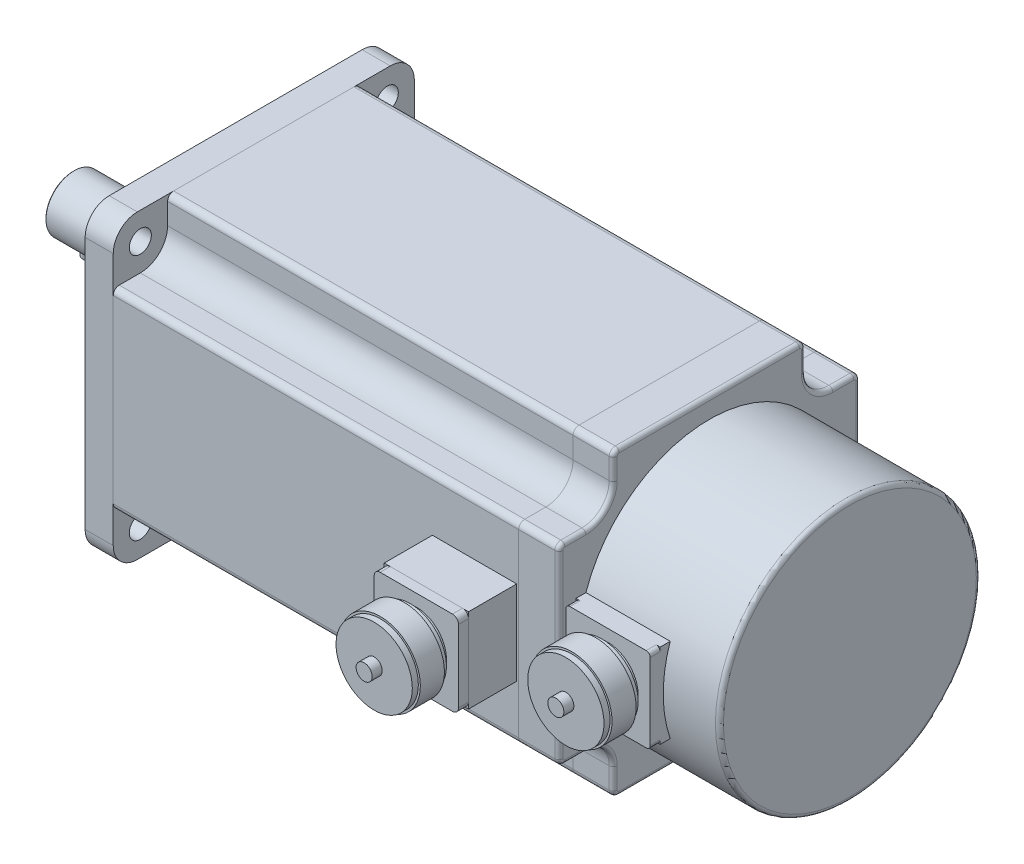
ISO-10303-21;
HEADER;
FILE_DESCRIPTION(('STEP AP214'),'2;1');
FILE_NAME('part.step','',(''),(''),'','','');
FILE_SCHEMA(('AUTOMOTIVE_DESIGN { 1 0 10303 214 1 1 1 1 }'));
ENDSEC;
DATA;
#1=APPLICATION_CONTEXT('core data for automotive mechanical design processes');
#2=APPLICATION_PROTOCOL_DEFINITION('international standard','automotive_design',2000,#1);
#3=PRODUCT_CONTEXT('',#1,'mechanical');
#4=PRODUCT('Part','Part','',(#3));
#5=PRODUCT_RELATED_PRODUCT_CATEGORY('part','',(#4));
#6=PRODUCT_DEFINITION_FORMATION('','',#4);
#7=PRODUCT_DEFINITION_CONTEXT('part definition',#1,'design');
#8=PRODUCT_DEFINITION('design','',#6,#7);
#9=PRODUCT_DEFINITION_SHAPE('','',#8);
#10=(LENGTH_UNIT() NAMED_UNIT(*) SI_UNIT(.MILLI.,.METRE.));
#11=(NAMED_UNIT(*) PLANE_ANGLE_UNIT() SI_UNIT($,.RADIAN.));
#12=(NAMED_UNIT(*) SI_UNIT($,.STERADIAN.) SOLID_ANGLE_UNIT());
#13=UNCERTAINTY_MEASURE_WITH_UNIT(LENGTH_MEASURE(1.E-05),#10,'distance_accuracy_value','');
#14=(GEOMETRIC_REPRESENTATION_CONTEXT(3) GLOBAL_UNCERTAINTY_ASSIGNED_CONTEXT((#13)) GLOBAL_UNIT_ASSIGNED_CONTEXT((#10,
#11,#12)) REPRESENTATION_CONTEXT('',''));
#15=CARTESIAN_POINT('',(0.,0.,0.));
#16=DIRECTION('',(0.,0.,1.));
#17=DIRECTION('',(1.,0.,0.));
#18=AXIS2_PLACEMENT_3D('',#15,#16,#17);
#19=CARTESIAN_POINT('',(-288.,-18.,0.));
#20=DIRECTION('',(0.,1.,0.));
#21=DIRECTION('',(0.,0.,1.));
#22=AXIS2_PLACEMENT_3D('',#19,#20,#21);
#23=CYLINDRICAL_SURFACE('',#22,3.99999999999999);
#24=CARTESIAN_POINT('',(-288.,-10.,0.));
#25=DIRECTION('',(0.,-1.,0.));
#26=DIRECTION('',(0.,0.,-1.));
#27=AXIS2_PLACEMENT_3D('',#24,#25,#26);
#28=CIRCLE('',#27,3.99999999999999);
#29=CARTESIAN_POINT('',(-288.,-10.,3.99999999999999));
#30=VERTEX_POINT('',#29);
#31=CARTESIAN_POINT('',(-288.,-10.,-3.99999999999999));
#32=VERTEX_POINT('',#31);
#33=EDGE_CURVE('E107',#30,#32,#28,.T.);
#34=ORIENTED_EDGE('',*,*,#33,.T.);
#35=DIRECTION('',(0.,1.,0.));
#36=VECTOR('',#35,1.);
#37=CARTESIAN_POINT('',(-288.,-18.,-3.99999999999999));
#38=LINE('',#37,#36);
#39=CARTESIAN_POINT('',(-288.,-18.,-3.99999999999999));
#40=VERTEX_POINT('',#39);
#41=EDGE_CURVE('E12',#40,#32,#38,.T.);
#42=ORIENTED_EDGE('',*,*,#41,.F.);
#43=CARTESIAN_POINT('',(-288.,-18.,0.));
#44=DIRECTION('',(0.,-1.,0.));
#45=DIRECTION('',(0.,0.,-1.));
#46=AXIS2_PLACEMENT_3D('',#43,#44,#45);
#47=CIRCLE('',#46,3.99999999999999);
#48=CARTESIAN_POINT('',(-288.,-18.,3.99999999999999));
#49=VERTEX_POINT('',#48);
#50=EDGE_CURVE('E95',#49,#40,#47,.T.);
#51=ORIENTED_EDGE('',*,*,#50,.F.);
#52=DIRECTION('',(0.,1.,0.));
#53=VECTOR('',#52,1.);
#54=CARTESIAN_POINT('',(-288.,-18.,3.99999999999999));
#55=LINE('',#54,#53);
#56=EDGE_CURVE('E103',#49,#30,#55,.T.);
#57=ORIENTED_EDGE('',*,*,#56,.T.);
#58=EDGE_LOOP('',(#34,#42,#51,#57));
#59=FACE_BOUND('',#58,.T.);
#60=ADVANCED_FACE('F44',(#59),#23,.T.);
#61=CARTESIAN_POINT('',(-241.,-18.,-3.99999999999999));
#62=DIRECTION('',(0.,0.,1.));
#63=DIRECTION('',(1.,0.,0.));
#64=AXIS2_PLACEMENT_3D('',#61,#62,#63);
#65=PLANE('',#64);
#66=DIRECTION('',(1.,0.,0.));
#67=VECTOR('',#66,1.);
#68=CARTESIAN_POINT('',(-241.,-10.,-3.99999999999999));
#69=LINE('',#68,#67);
#70=CARTESIAN_POINT('',(-241.,-10.,-3.99999999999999));
#71=VERTEX_POINT('',#70);
#72=EDGE_CURVE('E99',#32,#71,#69,.T.);
#73=ORIENTED_EDGE('',*,*,#72,.T.);
#74=DIRECTION('',(0.,1.,0.));
#75=VECTOR('',#74,1.);
#76=CARTESIAN_POINT('',(-241.,-18.,-3.99999999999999));
#77=LINE('',#76,#75);
#78=CARTESIAN_POINT('',(-241.,-18.,-3.99999999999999));
#79=VERTEX_POINT('',#78);
#80=EDGE_CURVE('E52',#79,#71,#77,.T.);
#81=ORIENTED_EDGE('',*,*,#80,.F.);
#82=DIRECTION('',(1.,0.,0.));
#83=VECTOR('',#82,1.);
#84=CARTESIAN_POINT('',(-241.,-18.,-3.99999999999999));
#85=LINE('',#84,#83);
#86=EDGE_CURVE('E90',#40,#79,#85,.T.);
#87=ORIENTED_EDGE('',*,*,#86,.F.);
#88=ORIENTED_EDGE('',*,*,#41,.T.);
#89=EDGE_LOOP('',(#73,#81,#87,#88));
#90=FACE_BOUND('',#89,.T.);
#91=ADVANCED_FACE('F98',(#90),#65,.F.);
#92=CARTESIAN_POINT('',(-241.,-18.,0.));
#93=DIRECTION('',(0.,1.,0.));
#94=DIRECTION('',(0.,0.,1.));
#95=AXIS2_PLACEMENT_3D('',#92,#93,#94);
#96=CYLINDRICAL_SURFACE('',#95,3.99999999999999);
#97=CARTESIAN_POINT('',(-241.,-10.,0.));
#98=DIRECTION('',(0.,-1.,0.));
#99=DIRECTION('',(0.,0.,-1.));
#100=AXIS2_PLACEMENT_3D('',#97,#98,#99);
#101=CIRCLE('',#100,3.99999999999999);
#102=CARTESIAN_POINT('',(-241.,-10.,3.99999999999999));
#103=VERTEX_POINT('',#102);
#104=EDGE_CURVE('E77',#71,#103,#101,.T.);
#105=ORIENTED_EDGE('',*,*,#104,.T.);
#106=DIRECTION('',(0.,1.,0.));
#107=VECTOR('',#106,1.);
#108=CARTESIAN_POINT('',(-241.,-18.,3.99999999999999));
#109=LINE('',#108,#107);
#110=CARTESIAN_POINT('',(-241.,-18.,3.99999999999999));
#111=VERTEX_POINT('',#110);
#112=EDGE_CURVE('E100',#111,#103,#109,.T.);
#113=ORIENTED_EDGE('',*,*,#112,.F.);
#114=CARTESIAN_POINT('',(-241.,-18.,0.));
#115=DIRECTION('',(0.,-1.,0.));
#116=DIRECTION('',(0.,0.,-1.));
#117=AXIS2_PLACEMENT_3D('',#114,#115,#116);
#118=CIRCLE('',#117,3.99999999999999);
#119=EDGE_CURVE('E93',#79,#111,#118,.T.);
#120=ORIENTED_EDGE('',*,*,#119,.F.);
#121=ORIENTED_EDGE('',*,*,#80,.T.);
#122=EDGE_LOOP('',(#105,#113,#120,#121));
#123=FACE_BOUND('',#122,.T.);
#124=ADVANCED_FACE('F101',(#123),#96,.T.);
#125=CARTESIAN_POINT('',(-288.,-18.,3.99999999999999));
#126=DIRECTION('',(0.,0.,-1.));
#127=DIRECTION('',(-1.,0.,0.));
#128=AXIS2_PLACEMENT_3D('',#125,#126,#127);
#129=PLANE('',#128);
#130=DIRECTION('',(-1.,0.,0.));
#131=VECTOR('',#130,1.);
#132=CARTESIAN_POINT('',(-288.,-10.,3.99999999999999));
#133=LINE('',#132,#131);
#134=EDGE_CURVE('E83',#103,#30,#133,.T.);
#135=ORIENTED_EDGE('',*,*,#134,.T.);
#136=ORIENTED_EDGE('',*,*,#56,.F.);
#137=DIRECTION('',(-1.,0.,0.));
#138=VECTOR('',#137,1.);
#139=CARTESIAN_POINT('',(-288.,-18.,3.99999999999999));
#140=LINE('',#139,#138);
#141=EDGE_CURVE('E60',#111,#49,#140,.T.);
#142=ORIENTED_EDGE('',*,*,#141,.F.);
#143=ORIENTED_EDGE('',*,*,#112,.T.);
#144=EDGE_LOOP('',(#135,#136,#142,#143));
#145=FACE_BOUND('',#144,.T.);
#146=ADVANCED_FACE('F114',(#145),#129,.F.);
#147=CARTESIAN_POINT('',(-288.,-18.,0.));
#148=DIRECTION('',(0.,-1.,0.));
#149=DIRECTION('',(0.,0.,-1.));
#150=AXIS2_PLACEMENT_3D('',#147,#148,#149);
#151=PLANE('',#150);
#152=ORIENTED_EDGE('',*,*,#50,.T.);
#153=ORIENTED_EDGE('',*,*,#86,.T.);
#154=ORIENTED_EDGE('',*,*,#119,.T.);
#155=ORIENTED_EDGE('',*,*,#141,.T.);
#156=EDGE_LOOP('',(#152,#153,#154,#155));
#157=FACE_BOUND('',#156,.T.);
#158=ADVANCED_FACE('F91',(#157),#151,.T.);
#159=CARTESIAN_POINT('',(-288.,-10.,0.));
#160=DIRECTION('',(0.,-1.,0.));
#161=DIRECTION('',(0.,0.,-1.));
#162=AXIS2_PLACEMENT_3D('',#159,#160,#161);
#163=PLANE('',#162);
#164=ORIENTED_EDGE('',*,*,#33,.F.);
#165=ORIENTED_EDGE('',*,*,#134,.F.);
#166=ORIENTED_EDGE('',*,*,#104,.F.);
#167=ORIENTED_EDGE('',*,*,#72,.F.);
#168=EDGE_LOOP('',(#164,#165,#166,#167));
#169=FACE_BOUND('',#168,.T.);
#170=ADVANCED_FACE('F117',(#169),#163,.F.);
#171=CLOSED_SHELL('',(#60,#91,#124,#146,#158,#170));
#172=MANIFOLD_SOLID_BREP('B2',#171);
#173=CARTESIAN_POINT('',(-297.,0.,0.));
#174=DIRECTION('',(1.,0.,0.));
#175=DIRECTION('',(0.,0.,-1.));
#176=AXIS2_PLACEMENT_3D('',#173,#174,#175);
#177=CYLINDRICAL_SURFACE('',#176,14.);
#178=CARTESIAN_POINT('',(-296.5,0.,0.));
#179=DIRECTION('',(-1.,0.,0.));
#180=DIRECTION('',(0.,0.,1.));
#181=AXIS2_PLACEMENT_3D('',#178,#179,#180);
#182=CIRCLE('',#181,14.);
#183=CARTESIAN_POINT('',(-296.5,0.,14.));
#184=VERTEX_POINT('',#183);
#185=EDGE_CURVE('E256',#184,#184,#182,.F.);
#186=ORIENTED_EDGE('',*,*,#185,.T.);
#187=EDGE_LOOP('',(#186));
#188=FACE_BOUND('',#187,.T.);
#189=CARTESIAN_POINT('',(-225.,0.,0.));
#190=DIRECTION('',(-1.,0.,0.));
#191=DIRECTION('',(0.,0.,1.));
#192=AXIS2_PLACEMENT_3D('',#189,#190,#191);
#193=CIRCLE('',#192,14.);
#194=CARTESIAN_POINT('',(-225.,0.,14.));
#195=VERTEX_POINT('',#194);
#196=EDGE_CURVE('E235',#195,#195,#193,.T.);
#197=ORIENTED_EDGE('',*,*,#196,.T.);
#198=EDGE_LOOP('',(#197));
#199=FACE_BOUND('',#198,.T.);
#200=CARTESIAN_POINT('',(-241.,-13.4164078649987,-3.99999999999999));
#201=CARTESIAN_POINT('',(-240.889963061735,-13.4163934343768,-4.00001343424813));
#202=CARTESIAN_POINT('',(-240.779934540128,-13.417761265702,-3.99545969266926));
#203=CARTESIAN_POINT('',(-240.560712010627,-13.4231542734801,-3.97732232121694));
#204=CARTESIAN_POINT('',(-240.451517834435,-13.4271788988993,-3.96374056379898));
#205=CARTESIAN_POINT('',(-240.234991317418,-13.4377658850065,-3.92769415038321));
#206=CARTESIAN_POINT('',(-240.127655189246,-13.4443222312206,-3.90525054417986));
#207=CARTESIAN_POINT('',(-239.915366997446,-13.4597622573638,-3.85169716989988));
#208=CARTESIAN_POINT('',(-239.810414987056,-13.4686459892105,-3.82058720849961));
#209=CARTESIAN_POINT('',(-239.500282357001,-13.4984072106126,-3.71462722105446));
#210=CARTESIAN_POINT('',(-239.299567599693,-13.5224082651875,-3.62710377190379));
#211=CARTESIAN_POINT('',(-238.915683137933,-13.5760110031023,-3.42099335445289));
#212=CARTESIAN_POINT('',(-238.732520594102,-13.6056149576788,-3.30239378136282));
#213=CARTESIAN_POINT('',(-238.383630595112,-13.6680345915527,-3.03385514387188));
#214=CARTESIAN_POINT('',(-238.21847497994,-13.7009134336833,-2.88318637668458));
#215=CARTESIAN_POINT('',(-237.91539864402,-13.7656378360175,-2.55635049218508));
#216=CARTESIAN_POINT('',(-237.777482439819,-13.7974832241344,-2.38017915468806));
#217=CARTESIAN_POINT('',(-237.53034061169,-13.8572672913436,-2.0032879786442));
#218=CARTESIAN_POINT('',(-237.42169609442,-13.885122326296,-1.80217262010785));
#219=CARTESIAN_POINT('',(-237.239992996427,-13.9330517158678,-1.38360719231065));
#220=CARTESIAN_POINT('',(-237.166925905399,-13.9531279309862,-1.16616104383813));
#221=CARTESIAN_POINT('',(-237.060331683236,-13.9827902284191,-0.727119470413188));
#222=CARTESIAN_POINT('',(-237.025822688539,-13.9926363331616,-0.505780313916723));
#223=CARTESIAN_POINT('',(-236.994226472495,-14.0016419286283,-0.0602449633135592));
#224=CARTESIAN_POINT('',(-236.997132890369,-14.0008032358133,0.163950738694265));
#225=CARTESIAN_POINT('',(-237.039612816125,-13.9887201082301,0.601961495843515));
#226=CARTESIAN_POINT('',(-237.078123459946,-13.9777773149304,0.815889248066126));
#227=CARTESIAN_POINT('',(-237.188991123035,-13.9470775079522,1.2341066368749));
#228=CARTESIAN_POINT('',(-237.261349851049,-13.9273200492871,1.43839578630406));
#229=CARTESIAN_POINT('',(-237.438618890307,-13.8807804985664,1.83414901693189));
#230=CARTESIAN_POINT('',(-237.543876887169,-13.853923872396,2.02544821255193));
#231=CARTESIAN_POINT('',(-237.783693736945,-13.7960546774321,2.38801825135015));
#232=CARTESIAN_POINT('',(-237.918258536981,-13.7650412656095,2.55928501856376));
#233=CARTESIAN_POINT('',(-238.218386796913,-13.7009177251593,2.88324485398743));
#234=CARTESIAN_POINT('',(-238.384870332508,-13.6677722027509,3.03507809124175));
#235=CARTESIAN_POINT('',(-238.741426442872,-13.6040627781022,3.30897556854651));
#236=CARTESIAN_POINT('',(-238.931505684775,-13.573499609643,3.43103136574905));
#237=CARTESIAN_POINT('',(-239.231158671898,-13.5321405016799,3.58945338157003));
#238=CARTESIAN_POINT('',(-239.333989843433,-13.5190503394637,3.63832313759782));
#239=CARTESIAN_POINT('',(-239.543626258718,-13.4948216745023,3.72718558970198));
#240=CARTESIAN_POINT('',(-239.650429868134,-13.4836823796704,3.76718189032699));
#241=CARTESIAN_POINT('',(-239.867138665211,-13.463719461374,3.83791732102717));
#242=CARTESIAN_POINT('',(-239.977040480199,-13.4548934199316,3.86866612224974));
#243=CARTESIAN_POINT('',(-240.199195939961,-13.4398293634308,3.92067829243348));
#244=CARTESIAN_POINT('',(-240.311448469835,-13.4335901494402,3.94194605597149));
#245=CARTESIAN_POINT('',(-240.519732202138,-13.4246640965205,3.97223001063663));
#246=CARTESIAN_POINT('',(-240.615545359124,-13.4215735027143,3.98264484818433));
#247=CARTESIAN_POINT('',(-240.807569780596,-13.4174428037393,3.99652828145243));
#248=CARTESIAN_POINT('',(-240.903780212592,-13.4163995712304,4.0000074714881));
#249=CARTESIAN_POINT('',(-241.,-13.4164078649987,3.99999999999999));
#250=B_SPLINE_CURVE_WITH_KNOTS('',3,(#200,#201,#202,#203,#204,#205,#206,#207,#208,#209,#210,
#211,#212,#213,#214,#215,#216,#217,#218,#219,#220,#221,#222,#223,#224,#225,#226,#227,#228,#229,
#230,#231,#232,#233,#234,#235,#236,#237,#238,#239,#240,#241,#242,#243,#244,#245,#246,#247,#248,
#249),.UNSPECIFIED.,.F.,.F.,(4,2,2,2,2,2,2,2,2,2,2,2,2,2,2,2,2,2,2,2,2,2,2,2,4),(0.,
0.329993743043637,0.659919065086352,0.98906537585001,1.31821902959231,1.97575167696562,
2.6335514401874,3.30832474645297,3.98320984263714,4.67064278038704,5.35791119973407,
6.02724874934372,6.6964725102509,7.34634193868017,7.99624417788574,8.65326120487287,
9.31041168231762,9.99056134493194,10.6709036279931,11.0143588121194,11.357674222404,
11.700629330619,12.0434253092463,12.3324405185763,12.6210139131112),.UNSPECIFIED.);
#251=CARTESIAN_POINT('',(-241.,-13.4164078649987,-3.99999999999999));
#252=VERTEX_POINT('',#251);
#253=CARTESIAN_POINT('',(-241.,-13.4164078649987,3.99999999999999));
#254=VERTEX_POINT('',#253);
#255=EDGE_CURVE('E259',#252,#254,#250,.T.);
#256=ORIENTED_EDGE('',*,*,#255,.F.);
#257=DIRECTION('',(1.,0.,0.));
#258=VECTOR('',#257,1.);
#259=CARTESIAN_POINT('',(-297.,-13.4164078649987,-3.99999999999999));
#260=LINE('',#259,#258);
#261=CARTESIAN_POINT('',(-288.,-13.4164078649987,-3.99999999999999));
#262=VERTEX_POINT('',#261);
#263=EDGE_CURVE('E42',#262,#252,#260,.T.);
#264=ORIENTED_EDGE('',*,*,#263,.F.);
#265=CARTESIAN_POINT('',(-288.,-13.4164078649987,3.99999999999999));
#266=CARTESIAN_POINT('',(-288.110036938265,-13.4163934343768,4.00001343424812));
#267=CARTESIAN_POINT('',(-288.220065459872,-13.417761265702,3.99545969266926));
#268=CARTESIAN_POINT('',(-288.439287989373,-13.4231542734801,3.97732232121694));
#269=CARTESIAN_POINT('',(-288.548482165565,-13.4271788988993,3.96374056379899));
#270=CARTESIAN_POINT('',(-288.765008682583,-13.4377658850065,3.92769415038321));
#271=CARTESIAN_POINT('',(-288.872344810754,-13.4443222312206,3.90525054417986));
#272=CARTESIAN_POINT('',(-289.084633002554,-13.4597622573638,3.85169716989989));
#273=CARTESIAN_POINT('',(-289.189585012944,-13.4686459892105,3.82058720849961));
#274=CARTESIAN_POINT('',(-289.499717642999,-13.4984072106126,3.71462722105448));
#275=CARTESIAN_POINT('',(-289.700432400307,-13.5224082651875,3.62710377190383));
#276=CARTESIAN_POINT('',(-290.084316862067,-13.5760110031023,3.42099335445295));
#277=CARTESIAN_POINT('',(-290.267479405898,-13.6056149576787,3.30239378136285));
#278=CARTESIAN_POINT('',(-290.616369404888,-13.6680345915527,3.03385514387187));
#279=CARTESIAN_POINT('',(-290.78152502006,-13.7009134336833,2.88318637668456));
#280=CARTESIAN_POINT('',(-291.08460135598,-13.7656378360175,2.55635049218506));
#281=CARTESIAN_POINT('',(-291.222517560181,-13.7974832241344,2.38017915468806));
#282=CARTESIAN_POINT('',(-291.46965938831,-13.8572672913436,2.00328797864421));
#283=CARTESIAN_POINT('',(-291.57830390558,-13.8851223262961,1.80217262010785));
#284=CARTESIAN_POINT('',(-291.760007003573,-13.9330517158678,1.38360719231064));
#285=CARTESIAN_POINT('',(-291.833074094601,-13.9531279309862,1.16616104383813));
#286=CARTESIAN_POINT('',(-291.939668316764,-13.9827902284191,0.7271194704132));
#287=CARTESIAN_POINT('',(-291.974177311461,-13.9926363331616,0.505780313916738));
#288=CARTESIAN_POINT('',(-292.005773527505,-14.0016419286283,0.060244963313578));
#289=CARTESIAN_POINT('',(-292.002867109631,-14.0008032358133,-0.163950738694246));
#290=CARTESIAN_POINT('',(-291.960387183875,-13.9887201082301,-0.601961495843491));
#291=CARTESIAN_POINT('',(-291.921876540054,-13.9777773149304,-0.815889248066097));
#292=CARTESIAN_POINT('',(-291.811008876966,-13.9470775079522,-1.23410663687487));
#293=CARTESIAN_POINT('',(-291.738650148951,-13.9273200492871,-1.43839578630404));
#294=CARTESIAN_POINT('',(-291.561381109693,-13.8807804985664,-1.83414901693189));
#295=CARTESIAN_POINT('',(-291.456123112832,-13.8539238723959,-2.02544821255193));
#296=CARTESIAN_POINT('',(-291.216306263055,-13.7960546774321,-2.38801825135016));
#297=CARTESIAN_POINT('',(-291.081741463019,-13.7650412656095,-2.55928501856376));
#298=CARTESIAN_POINT('',(-290.781613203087,-13.7009177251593,-2.88324485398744));
#299=CARTESIAN_POINT('',(-290.615129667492,-13.6677722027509,-3.03507809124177));
#300=CARTESIAN_POINT('',(-290.258573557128,-13.6040627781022,-3.30897556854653));
#301=CARTESIAN_POINT('',(-290.068494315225,-13.573499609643,-3.43103136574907));
#302=CARTESIAN_POINT('',(-289.768841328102,-13.5321405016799,-3.58945338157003));
#303=CARTESIAN_POINT('',(-289.666010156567,-13.5190503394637,-3.63832313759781));
#304=CARTESIAN_POINT('',(-289.456373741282,-13.4948216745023,-3.72718558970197));
#305=CARTESIAN_POINT('',(-289.349570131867,-13.4836823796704,-3.76718189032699));
#306=CARTESIAN_POINT('',(-289.132861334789,-13.463719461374,-3.83791732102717));
#307=CARTESIAN_POINT('',(-289.022959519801,-13.4548934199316,-3.86866612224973));
#308=CARTESIAN_POINT('',(-288.800804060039,-13.4398293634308,-3.92067829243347));
#309=CARTESIAN_POINT('',(-288.688551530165,-13.4335901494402,-3.94194605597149));
#310=CARTESIAN_POINT('',(-288.480267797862,-13.4246640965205,-3.97223001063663));
#311=CARTESIAN_POINT('',(-288.384454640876,-13.4215735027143,-3.98264484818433));
#312=CARTESIAN_POINT('',(-288.192430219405,-13.4174428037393,-3.99652828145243));
#313=CARTESIAN_POINT('',(-288.096219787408,-13.4163995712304,-4.0000074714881));
#314=CARTESIAN_POINT('',(-288.,-13.4164078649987,-3.99999999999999));
#315=B_SPLINE_CURVE_WITH_KNOTS('',3,(#265,#266,#267,#268,#269,#270,#271,#272,#273,#274,#275,
#276,#277,#278,#279,#280,#281,#282,#283,#284,#285,#286,#287,#288,#289,#290,#291,#292,#293,#294,
#295,#296,#297,#298,#299,#300,#301,#302,#303,#304,#305,#306,#307,#308,#309,#310,#311,#312,#313,
#314),.UNSPECIFIED.,.F.,.F.,(4,2,2,2,2,2,2,2,2,2,2,2,2,2,2,2,2,2,2,2,2,2,2,2,4),(0.,
0.32999374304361,0.659919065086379,0.989065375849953,1.31821902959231,1.97575167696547,
2.6335514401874,3.30832474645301,3.98320984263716,4.67064278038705,5.35791119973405,
6.02724874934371,6.69647251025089,7.34634193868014,7.99624417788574,8.65326120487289,
9.31041168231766,9.99056134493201,10.6709036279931,11.0143588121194,11.357674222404,
11.700629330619,12.0434253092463,12.3324405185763,12.6210139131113),.UNSPECIFIED.);
#316=CARTESIAN_POINT('',(-288.,-13.4164078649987,3.99999999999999));
#317=VERTEX_POINT('',#316);
#318=EDGE_CURVE('E184',#317,#262,#315,.T.);
#319=ORIENTED_EDGE('',*,*,#318,.F.);
#320=DIRECTION('',(1.,0.,0.));
#321=VECTOR('',#320,1.);
#322=CARTESIAN_POINT('',(-297.,-13.4164078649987,3.99999999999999));
#323=LINE('',#322,#321);
#324=EDGE_CURVE('E234',#254,#317,#323,.F.);
#325=ORIENTED_EDGE('',*,*,#324,.F.);
#326=EDGE_LOOP('',(#256,#264,#319,#325));
#327=FACE_BOUND('',#326,.T.);
#328=ADVANCED_FACE('F176',(#188,#199,#327),#177,.T.);
#329=CARTESIAN_POINT('',(-225.,0.,0.));
#330=DIRECTION('',(-1.,0.,0.));
#331=DIRECTION('',(0.,0.,1.));
#332=AXIS2_PLACEMENT_3D('',#329,#330,#331);
#333=PLANE('',#332);
#334=CARTESIAN_POINT('',(-225.,0.,0.));
#335=DIRECTION('',(-1.,0.,0.));
#336=DIRECTION('',(0.,0.,1.));
#337=AXIS2_PLACEMENT_3D('',#334,#335,#336);
#338=CIRCLE('',#337,17.);
#339=CARTESIAN_POINT('',(-225.,0.,17.));
#340=VERTEX_POINT('',#339);
#341=EDGE_CURVE('E247',#340,#340,#338,.T.);
#342=ORIENTED_EDGE('',*,*,#341,.T.);
#343=EDGE_LOOP('',(#342));
#344=FACE_BOUND('',#343,.T.);
#345=ORIENTED_EDGE('',*,*,#196,.F.);
#346=EDGE_LOOP('',(#345));
#347=FACE_BOUND('',#346,.T.);
#348=ADVANCED_FACE('F296',(#344,#347),#333,.T.);
#349=CARTESIAN_POINT('',(-225.,0.,0.));
#350=DIRECTION('',(1.,0.,0.));
#351=DIRECTION('',(0.,0.,-1.));
#352=AXIS2_PLACEMENT_3D('',#349,#350,#351);
#353=CYLINDRICAL_SURFACE('',#352,17.5);
#354=CARTESIAN_POINT('',(-224.5,0.,0.));
#355=DIRECTION('',(-1.,0.,0.));
#356=DIRECTION('',(0.,0.,1.));
#357=AXIS2_PLACEMENT_3D('',#354,#355,#356);
#358=CIRCLE('',#357,17.5);
#359=CARTESIAN_POINT('',(-224.5,0.,17.5));
#360=VERTEX_POINT('',#359);
#361=EDGE_CURVE('E250',#360,#360,#358,.F.);
#362=ORIENTED_EDGE('',*,*,#361,.T.);
#363=EDGE_LOOP('',(#362));
#364=FACE_BOUND('',#363,.T.);
#365=CARTESIAN_POINT('',(-222.,0.,0.));
#366=DIRECTION('',(-1.,0.,0.));
#367=DIRECTION('',(0.,0.,1.));
#368=AXIS2_PLACEMENT_3D('',#365,#366,#367);
#369=CIRCLE('',#368,17.5);
#370=CARTESIAN_POINT('',(-222.,0.,17.5));
#371=VERTEX_POINT('',#370);
#372=EDGE_CURVE('E239',#371,#371,#369,.T.);
#373=ORIENTED_EDGE('',*,*,#372,.T.);
#374=EDGE_LOOP('',(#373));
#375=FACE_BOUND('',#374,.T.);
#376=ADVANCED_FACE('F301',(#364,#375),#353,.T.);
#377=CARTESIAN_POINT('',(-222.,0.,0.));
#378=DIRECTION('',(-1.,0.,0.));
#379=DIRECTION('',(0.,0.,1.));
#380=AXIS2_PLACEMENT_3D('',#377,#378,#379);
#381=PLANE('',#380);
#382=ORIENTED_EDGE('',*,*,#372,.F.);
#383=EDGE_LOOP('',(#382));
#384=FACE_BOUND('',#383,.T.);
#385=ADVANCED_FACE('F317',(#384),#381,.F.);
#386=CARTESIAN_POINT('',(-224.5,0.,0.));
#387=DIRECTION('',(-1.,0.,0.));
#388=DIRECTION('',(0.,0.,1.));
#389=AXIS2_PLACEMENT_3D('',#386,#387,#388);
#390=TOROIDAL_SURFACE('',#389,17.,0.5);
#391=ORIENTED_EDGE('',*,*,#361,.F.);
#392=EDGE_LOOP('',(#391));
#393=FACE_BOUND('',#392,.T.);
#394=ORIENTED_EDGE('',*,*,#341,.F.);
#395=EDGE_LOOP('',(#394));
#396=FACE_BOUND('',#395,.T.);
#397=ADVANCED_FACE('F313',(#393,#396),#390,.T.);
#398=CARTESIAN_POINT('',(-297.,0.,0.));
#399=DIRECTION('',(-1.,0.,0.));
#400=DIRECTION('',(0.,0.,1.));
#401=AXIS2_PLACEMENT_3D('',#398,#399,#400);
#402=PLANE('',#401);
#403=CARTESIAN_POINT('',(-297.,0.,0.));
#404=DIRECTION('',(-1.,0.,0.));
#405=DIRECTION('',(0.,0.,1.));
#406=AXIS2_PLACEMENT_3D('',#403,#404,#405);
#407=CIRCLE('',#406,13.5);
#408=CARTESIAN_POINT('',(-297.,0.,13.5));
#409=VERTEX_POINT('',#408);
#410=EDGE_CURVE('E253',#409,#409,#407,.T.);
#411=ORIENTED_EDGE('',*,*,#410,.T.);
#412=EDGE_LOOP('',(#411));
#413=FACE_BOUND('',#412,.T.);
#414=ADVANCED_FACE('F281',(#413),#402,.T.);
#415=CARTESIAN_POINT('',(-297.,0.,0.));
#416=DIRECTION('',(1.,0.,0.));
#417=DIRECTION('',(0.,0.,-1.));
#418=AXIS2_PLACEMENT_3D('',#415,#416,#417);
#419=CONICAL_SURFACE('',#418,13.5,0.78539816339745);
#420=ORIENTED_EDGE('',*,*,#185,.F.);
#421=EDGE_LOOP('',(#420));
#422=FACE_BOUND('',#421,.T.);
#423=ORIENTED_EDGE('',*,*,#410,.F.);
#424=EDGE_LOOP('',(#423));
#425=FACE_BOUND('',#424,.T.);
#426=ADVANCED_FACE('F178',(#422,#425),#419,.T.);
#427=CARTESIAN_POINT('',(-288.,-10.,0.));
#428=DIRECTION('',(0.,-1.,0.));
#429=DIRECTION('',(0.,0.,-1.));
#430=AXIS2_PLACEMENT_3D('',#427,#428,#429);
#431=CYLINDRICAL_SURFACE('',#430,3.99999999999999);
#432=DIRECTION('',(0.,-1.,0.));
#433=VECTOR('',#432,1.);
#434=CARTESIAN_POINT('',(-288.,-10.,3.99999999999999));
#435=LINE('',#434,#433);
#436=CARTESIAN_POINT('',(-288.,-10.,3.99999999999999));
#437=VERTEX_POINT('',#436);
#438=EDGE_CURVE('E231',#437,#317,#435,.T.);
#439=ORIENTED_EDGE('',*,*,#438,.T.);
#440=ORIENTED_EDGE('',*,*,#318,.T.);
#441=DIRECTION('',(0.,-1.,0.));
#442=VECTOR('',#441,1.);
#443=CARTESIAN_POINT('',(-288.,-10.,-3.99999999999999));
#444=LINE('',#443,#442);
#445=CARTESIAN_POINT('',(-288.,-10.,-3.99999999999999));
#446=VERTEX_POINT('',#445);
#447=EDGE_CURVE('E190',#446,#262,#444,.T.);
#448=ORIENTED_EDGE('',*,*,#447,.F.);
#449=CARTESIAN_POINT('',(-288.,-10.,0.));
#450=DIRECTION('',(0.,1.,0.));
#451=DIRECTION('',(0.,0.,1.));
#452=AXIS2_PLACEMENT_3D('',#449,#450,#451);
#453=CIRCLE('',#452,3.99999999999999);
#454=EDGE_CURVE('E221',#446,#437,#453,.T.);
#455=ORIENTED_EDGE('',*,*,#454,.T.);
#456=EDGE_LOOP('',(#439,#440,#448,#455));
#457=FACE_BOUND('',#456,.T.);
#458=ADVANCED_FACE('F230',(#457),#431,.F.);
#459=CARTESIAN_POINT('',(-288.,-10.,3.99999999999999));
#460=DIRECTION('',(0.,0.,-1.));
#461=DIRECTION('',(-1.,0.,0.));
#462=AXIS2_PLACEMENT_3D('',#459,#460,#461);
#463=PLANE('',#462);
#464=ORIENTED_EDGE('',*,*,#324,.T.);
#465=ORIENTED_EDGE('',*,*,#438,.F.);
#466=DIRECTION('',(1.,0.,0.));
#467=VECTOR('',#466,1.);
#468=CARTESIAN_POINT('',(-288.,-10.,3.99999999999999));
#469=LINE('',#468,#467);
#470=CARTESIAN_POINT('',(-241.,-10.,3.99999999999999));
#471=VERTEX_POINT('',#470);
#472=EDGE_CURVE('E217',#437,#471,#469,.T.);
#473=ORIENTED_EDGE('',*,*,#472,.T.);
#474=DIRECTION('',(0.,-1.,0.));
#475=VECTOR('',#474,1.);
#476=CARTESIAN_POINT('',(-241.,-10.,3.99999999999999));
#477=LINE('',#476,#475);
#478=EDGE_CURVE('E236',#471,#254,#477,.T.);
#479=ORIENTED_EDGE('',*,*,#478,.T.);
#480=EDGE_LOOP('',(#464,#465,#473,#479));
#481=FACE_BOUND('',#480,.T.);
#482=ADVANCED_FACE('F233',(#481),#463,.T.);
#483=CARTESIAN_POINT('',(-241.,-10.,0.));
#484=DIRECTION('',(0.,-1.,0.));
#485=DIRECTION('',(0.,0.,-1.));
#486=AXIS2_PLACEMENT_3D('',#483,#484,#485);
#487=CYLINDRICAL_SURFACE('',#486,3.99999999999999);
#488=DIRECTION('',(0.,-1.,0.));
#489=VECTOR('',#488,1.);
#490=CARTESIAN_POINT('',(-241.,-10.,-3.99999999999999));
#491=LINE('',#490,#489);
#492=CARTESIAN_POINT('',(-241.,-10.,-3.99999999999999));
#493=VERTEX_POINT('',#492);
#494=EDGE_CURVE('E241',#493,#252,#491,.T.);
#495=ORIENTED_EDGE('',*,*,#494,.T.);
#496=ORIENTED_EDGE('',*,*,#255,.T.);
#497=ORIENTED_EDGE('',*,*,#478,.F.);
#498=CARTESIAN_POINT('',(-241.,-10.,0.));
#499=DIRECTION('',(0.,1.,0.));
#500=DIRECTION('',(0.,0.,1.));
#501=AXIS2_PLACEMENT_3D('',#498,#499,#500);
#502=CIRCLE('',#501,3.99999999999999);
#503=EDGE_CURVE('E222',#471,#493,#502,.T.);
#504=ORIENTED_EDGE('',*,*,#503,.T.);
#505=EDGE_LOOP('',(#495,#496,#497,#504));
#506=FACE_BOUND('',#505,.T.);
#507=ADVANCED_FACE('F269',(#506),#487,.F.);
#508=CARTESIAN_POINT('',(-241.,-10.,-3.99999999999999));
#509=DIRECTION('',(0.,0.,1.));
#510=DIRECTION('',(1.,0.,0.));
#511=AXIS2_PLACEMENT_3D('',#508,#509,#510);
#512=PLANE('',#511);
#513=ORIENTED_EDGE('',*,*,#263,.T.);
#514=ORIENTED_EDGE('',*,*,#494,.F.);
#515=DIRECTION('',(-1.,0.,0.));
#516=VECTOR('',#515,1.);
#517=CARTESIAN_POINT('',(-241.,-10.,-3.99999999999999));
#518=LINE('',#517,#516);
#519=EDGE_CURVE('E287',#493,#446,#518,.T.);
#520=ORIENTED_EDGE('',*,*,#519,.T.);
#521=ORIENTED_EDGE('',*,*,#447,.T.);
#522=EDGE_LOOP('',(#513,#514,#520,#521));
#523=FACE_BOUND('',#522,.T.);
#524=ADVANCED_FACE('F274',(#523),#512,.T.);
#525=CARTESIAN_POINT('',(-288.,-10.,0.));
#526=DIRECTION('',(0.,1.,0.));
#527=DIRECTION('',(0.,0.,1.));
#528=AXIS2_PLACEMENT_3D('',#525,#526,#527);
#529=PLANE('',#528);
#530=ORIENTED_EDGE('',*,*,#454,.F.);
#531=ORIENTED_EDGE('',*,*,#519,.F.);
#532=ORIENTED_EDGE('',*,*,#503,.F.);
#533=ORIENTED_EDGE('',*,*,#472,.F.);
#534=EDGE_LOOP('',(#530,#531,#532,#533));
#535=FACE_BOUND('',#534,.T.);
#536=ADVANCED_FACE('F219',(#535),#529,.F.);
#537=CLOSED_SHELL('',(#328,#348,#376,#385,#397,#414,#426,#458,#482,#507,#524,#536));
#538=MANIFOLD_SOLID_BREP('B6',#537);
#539=CARTESIAN_POINT('',(-22.,0.,125.));
#540=DIRECTION('',(0.,0.,1.));
#541=DIRECTION('',(1.,0.,0.));
#542=AXIS2_PLACEMENT_3D('',#539,#540,#541);
#543=PLANE('',#542);
#544=CARTESIAN_POINT('',(-22.,0.,125.));
#545=DIRECTION('',(0.,0.,1.));
#546=DIRECTION('',(1.,0.,0.));
#547=AXIS2_PLACEMENT_3D('',#544,#545,#546);
#548=CIRCLE('',#547,19.);
#549=CARTESIAN_POINT('',(-3.,0.,125.));
#550=VERTEX_POINT('',#549);
#551=EDGE_CURVE('E419',#550,#550,#548,.T.);
#552=ORIENTED_EDGE('',*,*,#551,.T.);
#553=EDGE_LOOP('',(#552));
#554=FACE_BOUND('',#553,.T.);
#555=CARTESIAN_POINT('',(-22.,0.,125.));
#556=DIRECTION('',(0.,0.,1.));
#557=DIRECTION('',(1.,0.,0.));
#558=AXIS2_PLACEMENT_3D('',#555,#556,#557);
#559=CIRCLE('',#558,4.);
#560=CARTESIAN_POINT('',(-18.,0.,125.));
#561=VERTEX_POINT('',#560);
#562=EDGE_CURVE('E427',#561,#561,#559,.T.);
#563=ORIENTED_EDGE('',*,*,#562,.F.);
#564=EDGE_LOOP('',(#563));
#565=FACE_BOUND('',#564,.T.);
#566=ADVANCED_FACE('F408',(#554,#565),#543,.T.);
#567=CARTESIAN_POINT('',(-22.,0.,122.));
#568=DIRECTION('',(0.,0.,1.));
#569=DIRECTION('',(1.,0.,0.));
#570=AXIS2_PLACEMENT_3D('',#567,#568,#569);
#571=PLANE('',#570);
#572=CARTESIAN_POINT('',(-22.,0.,122.));
#573=DIRECTION('',(0.,0.,1.));
#574=DIRECTION('',(1.,0.,0.));
#575=AXIS2_PLACEMENT_3D('',#572,#573,#574);
#576=CIRCLE('',#575,20.);
#577=CARTESIAN_POINT('',(-2.,0.,122.));
#578=VERTEX_POINT('',#577);
#579=EDGE_CURVE('E175',#578,#578,#576,.T.);
#580=ORIENTED_EDGE('',*,*,#579,.T.);
#581=EDGE_LOOP('',(#580));
#582=FACE_BOUND('',#581,.T.);
#583=CARTESIAN_POINT('',(-22.,0.,122.));
#584=DIRECTION('',(0.,0.,1.));
#585=DIRECTION('',(1.,0.,0.));
#586=AXIS2_PLACEMENT_3D('',#583,#584,#585);
#587=CIRCLE('',#586,19.);
#588=CARTESIAN_POINT('',(-3.,0.,122.));
#589=VERTEX_POINT('',#588);
#590=EDGE_CURVE('E421',#589,#589,#587,.T.);
#591=ORIENTED_EDGE('',*,*,#590,.F.);
#592=EDGE_LOOP('',(#591));
#593=FACE_BOUND('',#592,.T.);
#594=ADVANCED_FACE('F443',(#582,#593),#571,.T.);
#595=CARTESIAN_POINT('',(-22.,0.,122.));
#596=DIRECTION('',(0.,0.,-1.));
#597=DIRECTION('',(-1.,0.,0.));
#598=AXIS2_PLACEMENT_3D('',#595,#596,#597);
#599=CYLINDRICAL_SURFACE('',#598,20.);
#600=ORIENTED_EDGE('',*,*,#579,.F.);
#601=EDGE_LOOP('',(#600));
#602=FACE_BOUND('',#601,.T.);
#603=CARTESIAN_POINT('',(-22.,0.,110.));
#604=DIRECTION('',(0.,0.,1.));
#605=DIRECTION('',(1.,0.,0.));
#606=AXIS2_PLACEMENT_3D('',#603,#604,#605);
#607=CIRCLE('',#606,20.);
#608=CARTESIAN_POINT('',(-2.,0.,110.));
#609=VERTEX_POINT('',#608);
#610=EDGE_CURVE('E412',#609,#609,#607,.T.);
#611=ORIENTED_EDGE('',*,*,#610,.T.);
#612=EDGE_LOOP('',(#611));
#613=FACE_BOUND('',#612,.T.);
#614=ADVANCED_FACE('F410',(#602,#613),#599,.T.);
#615=CARTESIAN_POINT('',(-22.,0.,110.));
#616=DIRECTION('',(0.,0.,1.));
#617=DIRECTION('',(1.,0.,0.));
#618=AXIS2_PLACEMENT_3D('',#615,#616,#617);
#619=PLANE('',#618);
#620=ORIENTED_EDGE('',*,*,#610,.F.);
#621=EDGE_LOOP('',(#620));
#622=FACE_BOUND('',#621,.T.);
#623=ADVANCED_FACE('F453',(#622),#619,.F.);
#624=CARTESIAN_POINT('',(-22.,0.,125.));
#625=DIRECTION('',(0.,0.,-1.));
#626=DIRECTION('',(-1.,0.,0.));
#627=AXIS2_PLACEMENT_3D('',#624,#625,#626);
#628=CYLINDRICAL_SURFACE('',#627,19.);
#629=ORIENTED_EDGE('',*,*,#551,.F.);
#630=EDGE_LOOP('',(#629));
#631=FACE_BOUND('',#630,.T.);
#632=ORIENTED_EDGE('',*,*,#590,.T.);
#633=EDGE_LOOP('',(#632));
#634=FACE_BOUND('',#633,.T.);
#635=ADVANCED_FACE('F438',(#631,#634),#628,.T.);
#636=CARTESIAN_POINT('',(-22.,0.,130.));
#637=DIRECTION('',(0.,0.,-1.));
#638=DIRECTION('',(-1.,0.,0.));
#639=AXIS2_PLACEMENT_3D('',#636,#637,#638);
#640=CYLINDRICAL_SURFACE('',#639,4.);
#641=CARTESIAN_POINT('',(-22.,0.,130.));
#642=DIRECTION('',(0.,0.,1.));
#643=DIRECTION('',(1.,0.,0.));
#644=AXIS2_PLACEMENT_3D('',#641,#642,#643);
#645=CIRCLE('',#644,4.);
#646=CARTESIAN_POINT('',(-18.,0.,130.));
#647=VERTEX_POINT('',#646);
#648=EDGE_CURVE('E424',#647,#647,#645,.T.);
#649=ORIENTED_EDGE('',*,*,#648,.F.);
#650=EDGE_LOOP('',(#649));
#651=FACE_BOUND('',#650,.T.);
#652=ORIENTED_EDGE('',*,*,#562,.T.);
#653=EDGE_LOOP('',(#652));
#654=FACE_BOUND('',#653,.T.);
#655=ADVANCED_FACE('F435',(#651,#654),#640,.T.);
#656=CARTESIAN_POINT('',(-22.,0.,130.));
#657=DIRECTION('',(0.,0.,1.));
#658=DIRECTION('',(1.,0.,0.));
#659=AXIS2_PLACEMENT_3D('',#656,#657,#658);
#660=PLANE('',#659);
#661=ORIENTED_EDGE('',*,*,#648,.T.);
#662=EDGE_LOOP('',(#661));
#663=FACE_BOUND('',#662,.T.);
#664=ADVANCED_FACE('F433',(#663),#660,.T.);
#665=CLOSED_SHELL('',(#566,#594,#614,#623,#635,#655,#664));
#666=MANIFOLD_SOLID_BREP('B36',#665);
#667=CARTESIAN_POINT('',(-22.,0.,110.));
#668=DIRECTION('',(0.,0.,-1.));
#669=DIRECTION('',(-1.,0.,0.));
#670=AXIS2_PLACEMENT_3D('',#667,#668,#669);
#671=CYLINDRICAL_SURFACE('',#670,18.);
#672=CARTESIAN_POINT('',(-22.,0.,110.));
#673=DIRECTION('',(0.,0.,1.));
#674=DIRECTION('',(1.,0.,0.));
#675=AXIS2_PLACEMENT_3D('',#672,#673,#674);
#676=CIRCLE('',#675,18.);
#677=CARTESIAN_POINT('',(-4.,0.,110.));
#678=VERTEX_POINT('',#677);
#679=EDGE_CURVE('E407',#678,#678,#676,.T.);
#680=ORIENTED_EDGE('',*,*,#679,.F.);
#681=EDGE_LOOP('',(#680));
#682=FACE_BOUND('',#681,.T.);
#683=CARTESIAN_POINT('',(-22.,0.,107.));
#684=DIRECTION('',(0.,0.,1.));
#685=DIRECTION('',(1.,0.,0.));
#686=AXIS2_PLACEMENT_3D('',#683,#684,#685);
#687=CIRCLE('',#686,18.);
#688=CARTESIAN_POINT('',(-4.,0.,107.));
#689=VERTEX_POINT('',#688);
#690=EDGE_CURVE('E520',#689,#689,#687,.T.);
#691=ORIENTED_EDGE('',*,*,#690,.T.);
#692=EDGE_LOOP('',(#691));
#693=FACE_BOUND('',#692,.T.);
#694=ADVANCED_FACE('F517',(#682,#693),#671,.T.);
#695=CARTESIAN_POINT('',(-22.,0.,110.));
#696=DIRECTION('',(0.,0.,1.));
#697=DIRECTION('',(1.,0.,0.));
#698=AXIS2_PLACEMENT_3D('',#695,#696,#697);
#699=PLANE('',#698);
#700=ORIENTED_EDGE('',*,*,#679,.T.);
#701=EDGE_LOOP('',(#700));
#702=FACE_BOUND('',#701,.T.);
#703=ADVANCED_FACE('F532',(#702),#699,.T.);
#704=CARTESIAN_POINT('',(-22.,0.,107.));
#705=DIRECTION('',(0.,0.,1.));
#706=DIRECTION('',(1.,0.,0.));
#707=AXIS2_PLACEMENT_3D('',#704,#705,#706);
#708=PLANE('',#707);
#709=ORIENTED_EDGE('',*,*,#690,.F.);
#710=EDGE_LOOP('',(#709));
#711=FACE_BOUND('',#710,.T.);
#712=ADVANCED_FACE('F530',(#711),#708,.F.);
#713=CLOSED_SHELL('',(#694,#703,#712));
#714=MANIFOLD_SOLID_BREP('B170',#713);
#715=CARTESIAN_POINT('',(-22.,0.,107.));
#716=DIRECTION('',(0.,0.,-1.));
#717=DIRECTION('',(-1.,0.,0.));
#718=AXIS2_PLACEMENT_3D('',#715,#716,#717);
#719=CYLINDRICAL_SURFACE('',#718,15.);
#720=CARTESIAN_POINT('',(-22.,0.,107.));
#721=DIRECTION('',(0.,0.,1.));
#722=DIRECTION('',(1.,0.,0.));
#723=AXIS2_PLACEMENT_3D('',#720,#721,#722);
#724=CIRCLE('',#723,15.);
#725=CARTESIAN_POINT('',(-7.,0.,107.));
#726=VERTEX_POINT('',#725);
#727=EDGE_CURVE('E516',#726,#726,#724,.T.);
#728=ORIENTED_EDGE('',*,*,#727,.F.);
#729=EDGE_LOOP('',(#728));
#730=FACE_BOUND('',#729,.T.);
#731=CARTESIAN_POINT('',(-22.,0.,104.));
#732=DIRECTION('',(0.,0.,1.));
#733=DIRECTION('',(1.,0.,0.));
#734=AXIS2_PLACEMENT_3D('',#731,#732,#733);
#735=CIRCLE('',#734,15.);
#736=CARTESIAN_POINT('',(-7.,0.,104.));
#737=VERTEX_POINT('',#736);
#738=EDGE_CURVE('E571',#737,#737,#735,.T.);
#739=ORIENTED_EDGE('',*,*,#738,.T.);
#740=EDGE_LOOP('',(#739));
#741=FACE_BOUND('',#740,.T.);
#742=ADVANCED_FACE('F568',(#730,#741),#719,.T.);
#743=CARTESIAN_POINT('',(-22.,0.,107.));
#744=DIRECTION('',(0.,0.,1.));
#745=DIRECTION('',(1.,0.,0.));
#746=AXIS2_PLACEMENT_3D('',#743,#744,#745);
#747=PLANE('',#746);
#748=ORIENTED_EDGE('',*,*,#727,.T.);
#749=EDGE_LOOP('',(#748));
#750=FACE_BOUND('',#749,.T.);
#751=ADVANCED_FACE('F583',(#750),#747,.T.);
#752=CARTESIAN_POINT('',(-22.,0.,104.));
#753=DIRECTION('',(0.,0.,1.));
#754=DIRECTION('',(1.,0.,0.));
#755=AXIS2_PLACEMENT_3D('',#752,#753,#754);
#756=PLANE('',#755);
#757=ORIENTED_EDGE('',*,*,#738,.F.);
#758=EDGE_LOOP('',(#757));
#759=FACE_BOUND('',#758,.T.);
#760=ADVANCED_FACE('F581',(#759),#756,.F.);
#761=CLOSED_SHELL('',(#742,#751,#760));
#762=MANIFOLD_SOLID_BREP('B402',#761);
#763=CARTESIAN_POINT('',(-40.,-18.,104.));
#764=DIRECTION('',(0.,0.,-1.));
#765=DIRECTION('',(-1.,0.,0.));
#766=AXIS2_PLACEMENT_3D('',#763,#764,#765);
#767=CYLINDRICAL_SURFACE('',#766,3.);
#768=CARTESIAN_POINT('',(-40.,-18.,99.));
#769=DIRECTION('',(0.,0.,1.));
#770=DIRECTION('',(-1.,0.,0.));
#771=AXIS2_PLACEMENT_3D('',#768,#769,#770);
#772=CIRCLE('',#771,3.);
#773=CARTESIAN_POINT('',(-43.,-18.,99.));
#774=VERTEX_POINT('',#773);
#775=CARTESIAN_POINT('',(-40.,-21.,99.));
#776=VERTEX_POINT('',#775);
#777=EDGE_CURVE('E715',#774,#776,#772,.T.);
#778=ORIENTED_EDGE('',*,*,#777,.T.);
#779=DIRECTION('',(0.,0.,-1.));
#780=VECTOR('',#779,1.);
#781=CARTESIAN_POINT('',(-40.,-21.,104.));
#782=LINE('',#781,#780);
#783=CARTESIAN_POINT('',(-40.,-21.,104.));
#784=VERTEX_POINT('',#783);
#785=EDGE_CURVE('E566',#784,#776,#782,.T.);
#786=ORIENTED_EDGE('',*,*,#785,.F.);
#787=CARTESIAN_POINT('',(-40.,-18.,104.));
#788=DIRECTION('',(0.,0.,1.));
#789=DIRECTION('',(-1.,0.,0.));
#790=AXIS2_PLACEMENT_3D('',#787,#788,#789);
#791=CIRCLE('',#790,3.);
#792=CARTESIAN_POINT('',(-43.,-18.,104.));
#793=VERTEX_POINT('',#792);
#794=EDGE_CURVE('E729',#793,#784,#791,.T.);
#795=ORIENTED_EDGE('',*,*,#794,.F.);
#796=DIRECTION('',(0.,0.,-1.));
#797=VECTOR('',#796,1.);
#798=CARTESIAN_POINT('',(-43.,-18.,104.));
#799=LINE('',#798,#797);
#800=EDGE_CURVE('E711',#793,#774,#799,.T.);
#801=ORIENTED_EDGE('',*,*,#800,.T.);
#802=EDGE_LOOP('',(#778,#786,#795,#801));
#803=FACE_BOUND('',#802,.T.);
#804=ADVANCED_FACE('F619',(#803),#767,.T.);
#805=CARTESIAN_POINT('',(-40.,-21.,104.));
#806=DIRECTION('',(0.,1.,0.));
#807=DIRECTION('',(0.,0.,1.));
#808=AXIS2_PLACEMENT_3D('',#805,#806,#807);
#809=PLANE('',#808);
#810=DIRECTION('',(1.,0.,0.));
#811=VECTOR('',#810,1.);
#812=CARTESIAN_POINT('',(-40.,-21.,99.));
#813=LINE('',#812,#811);
#814=CARTESIAN_POINT('',(-4.00000000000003,-21.,99.));
#815=VERTEX_POINT('',#814);
#816=EDGE_CURVE('E718',#776,#815,#813,.T.);
#817=ORIENTED_EDGE('',*,*,#816,.T.);
#818=DIRECTION('',(0.,0.,-1.));
#819=VECTOR('',#818,1.);
#820=CARTESIAN_POINT('',(-4.00000000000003,-21.,104.));
#821=LINE('',#820,#819);
#822=CARTESIAN_POINT('',(-4.00000000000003,-21.,104.));
#823=VERTEX_POINT('',#822);
#824=EDGE_CURVE('E627',#823,#815,#821,.T.);
#825=ORIENTED_EDGE('',*,*,#824,.F.);
#826=DIRECTION('',(1.,0.,0.));
#827=VECTOR('',#826,1.);
#828=CARTESIAN_POINT('',(-40.,-21.,104.));
#829=LINE('',#828,#827);
#830=EDGE_CURVE('E678',#784,#823,#829,.T.);
#831=ORIENTED_EDGE('',*,*,#830,.F.);
#832=ORIENTED_EDGE('',*,*,#785,.T.);
#833=EDGE_LOOP('',(#817,#825,#831,#832));
#834=FACE_BOUND('',#833,.T.);
#835=ADVANCED_FACE('F764',(#834),#809,.F.);
#836=CARTESIAN_POINT('',(-4.00000000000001,-18.,104.));
#837=DIRECTION('',(0.,0.,-1.));
#838=DIRECTION('',(-1.,0.,0.));
#839=AXIS2_PLACEMENT_3D('',#836,#837,#838);
#840=CYLINDRICAL_SURFACE('',#839,3.);
#841=CARTESIAN_POINT('',(-4.00000000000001,-18.,99.));
#842=DIRECTION('',(0.,0.,1.));
#843=DIRECTION('',(1.,0.,0.));
#844=AXIS2_PLACEMENT_3D('',#841,#842,#843);
#845=CIRCLE('',#844,3.);
#846=CARTESIAN_POINT('',(-1.00000000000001,-18.,99.));
#847=VERTEX_POINT('',#846);
#848=EDGE_CURVE('E720',#815,#847,#845,.T.);
#849=ORIENTED_EDGE('',*,*,#848,.T.);
#850=DIRECTION('',(0.,0.,-1.));
#851=VECTOR('',#850,1.);
#852=CARTESIAN_POINT('',(-1.00000000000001,-18.,104.));
#853=LINE('',#852,#851);
#854=CARTESIAN_POINT('',(-1.00000000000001,-18.,104.));
#855=VERTEX_POINT('',#854);
#856=EDGE_CURVE('E736',#855,#847,#853,.T.);
#857=ORIENTED_EDGE('',*,*,#856,.F.);
#858=CARTESIAN_POINT('',(-4.00000000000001,-18.,104.));
#859=DIRECTION('',(0.,0.,1.));
#860=DIRECTION('',(1.,0.,0.));
#861=AXIS2_PLACEMENT_3D('',#858,#859,#860);
#862=CIRCLE('',#861,3.);
#863=EDGE_CURVE('E744',#823,#855,#862,.T.);
#864=ORIENTED_EDGE('',*,*,#863,.F.);
#865=ORIENTED_EDGE('',*,*,#824,.T.);
#866=EDGE_LOOP('',(#849,#857,#864,#865));
#867=FACE_BOUND('',#866,.T.);
#868=ADVANCED_FACE('F742',(#867),#840,.T.);
#869=CARTESIAN_POINT('',(-1.00000000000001,-18.,104.));
#870=DIRECTION('',(-1.,0.,0.));
#871=DIRECTION('',(0.,0.,1.));
#872=AXIS2_PLACEMENT_3D('',#869,#870,#871);
#873=PLANE('',#872);
#874=DIRECTION('',(0.,1.,0.));
#875=VECTOR('',#874,1.);
#876=CARTESIAN_POINT('',(-1.00000000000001,-18.,99.));
#877=LINE('',#876,#875);
#878=CARTESIAN_POINT('',(-1.00000000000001,18.,99.));
#879=VERTEX_POINT('',#878);
#880=EDGE_CURVE('E722',#847,#879,#877,.T.);
#881=ORIENTED_EDGE('',*,*,#880,.T.);
#882=DIRECTION('',(0.,0.,-1.));
#883=VECTOR('',#882,1.);
#884=CARTESIAN_POINT('',(-1.00000000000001,18.,104.));
#885=LINE('',#884,#883);
#886=CARTESIAN_POINT('',(-1.00000000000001,18.,104.));
#887=VERTEX_POINT('',#886);
#888=EDGE_CURVE('E733',#887,#879,#885,.T.);
#889=ORIENTED_EDGE('',*,*,#888,.F.);
#890=DIRECTION('',(0.,1.,0.));
#891=VECTOR('',#890,1.);
#892=CARTESIAN_POINT('',(-1.00000000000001,-18.,104.));
#893=LINE('',#892,#891);
#894=EDGE_CURVE('E756',#855,#887,#893,.T.);
#895=ORIENTED_EDGE('',*,*,#894,.F.);
#896=ORIENTED_EDGE('',*,*,#856,.T.);
#897=EDGE_LOOP('',(#881,#889,#895,#896));
#898=FACE_BOUND('',#897,.T.);
#899=ADVANCED_FACE('F752',(#898),#873,.F.);
#900=CARTESIAN_POINT('',(-4.00000000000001,18.,104.));
#901=DIRECTION('',(0.,0.,-1.));
#902=DIRECTION('',(-1.,0.,0.));
#903=AXIS2_PLACEMENT_3D('',#900,#901,#902);
#904=CYLINDRICAL_SURFACE('',#903,3.);
#905=CARTESIAN_POINT('',(-4.00000000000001,18.,99.));
#906=DIRECTION('',(0.,0.,1.));
#907=DIRECTION('',(-1.,0.,0.));
#908=AXIS2_PLACEMENT_3D('',#905,#906,#907);
#909=CIRCLE('',#908,3.);
#910=CARTESIAN_POINT('',(-4.00000000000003,21.,99.));
#911=VERTEX_POINT('',#910);
#912=EDGE_CURVE('E724',#879,#911,#909,.T.);
#913=ORIENTED_EDGE('',*,*,#912,.T.);
#914=DIRECTION('',(0.,0.,-1.));
#915=VECTOR('',#914,1.);
#916=CARTESIAN_POINT('',(-4.00000000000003,21.,104.));
#917=LINE('',#916,#915);
#918=CARTESIAN_POINT('',(-4.00000000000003,21.,104.));
#919=VERTEX_POINT('',#918);
#920=EDGE_CURVE('E706',#919,#911,#917,.T.);
#921=ORIENTED_EDGE('',*,*,#920,.F.);
#922=CARTESIAN_POINT('',(-4.00000000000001,18.,104.));
#923=DIRECTION('',(0.,0.,1.));
#924=DIRECTION('',(-1.,0.,0.));
#925=AXIS2_PLACEMENT_3D('',#922,#923,#924);
#926=CIRCLE('',#925,3.);
#927=EDGE_CURVE('E697',#887,#919,#926,.T.);
#928=ORIENTED_EDGE('',*,*,#927,.F.);
#929=ORIENTED_EDGE('',*,*,#888,.T.);
#930=EDGE_LOOP('',(#913,#921,#928,#929));
#931=FACE_BOUND('',#930,.T.);
#932=ADVANCED_FACE('F755',(#931),#904,.T.);
#933=CARTESIAN_POINT('',(-40.,21.,104.));
#934=DIRECTION('',(0.,-1.,0.));
#935=DIRECTION('',(0.,0.,-1.));
#936=AXIS2_PLACEMENT_3D('',#933,#934,#935);
#937=PLANE('',#936);
#938=DIRECTION('',(-1.,0.,0.));
#939=VECTOR('',#938,1.);
#940=CARTESIAN_POINT('',(-40.,21.,99.));
#941=LINE('',#940,#939);
#942=CARTESIAN_POINT('',(-40.,21.,99.));
#943=VERTEX_POINT('',#942);
#944=EDGE_CURVE('E705',#911,#943,#941,.T.);
#945=ORIENTED_EDGE('',*,*,#944,.T.);
#946=DIRECTION('',(0.,0.,-1.));
#947=VECTOR('',#946,1.);
#948=CARTESIAN_POINT('',(-40.,21.,104.));
#949=LINE('',#948,#947);
#950=CARTESIAN_POINT('',(-40.,21.,104.));
#951=VERTEX_POINT('',#950);
#952=EDGE_CURVE('E702',#951,#943,#949,.T.);
#953=ORIENTED_EDGE('',*,*,#952,.F.);
#954=DIRECTION('',(-1.,0.,0.));
#955=VECTOR('',#954,1.);
#956=CARTESIAN_POINT('',(-40.,21.,104.));
#957=LINE('',#956,#955);
#958=EDGE_CURVE('E691',#919,#951,#957,.T.);
#959=ORIENTED_EDGE('',*,*,#958,.F.);
#960=ORIENTED_EDGE('',*,*,#920,.T.);
#961=EDGE_LOOP('',(#945,#953,#959,#960));
#962=FACE_BOUND('',#961,.T.);
#963=ADVANCED_FACE('F703',(#962),#937,.F.);
#964=CARTESIAN_POINT('',(-40.,18.,104.));
#965=DIRECTION('',(0.,0.,-1.));
#966=DIRECTION('',(-1.,0.,0.));
#967=AXIS2_PLACEMENT_3D('',#964,#965,#966);
#968=CYLINDRICAL_SURFACE('',#967,3.);
#969=CARTESIAN_POINT('',(-40.,18.,99.));
#970=DIRECTION('',(0.,0.,1.));
#971=DIRECTION('',(-1.,0.,0.));
#972=AXIS2_PLACEMENT_3D('',#969,#970,#971);
#973=CIRCLE('',#972,3.);
#974=CARTESIAN_POINT('',(-43.,18.,99.));
#975=VERTEX_POINT('',#974);
#976=EDGE_CURVE('E664',#943,#975,#973,.T.);
#977=ORIENTED_EDGE('',*,*,#976,.T.);
#978=DIRECTION('',(0.,0.,-1.));
#979=VECTOR('',#978,1.);
#980=CARTESIAN_POINT('',(-43.,18.,104.));
#981=LINE('',#980,#979);
#982=CARTESIAN_POINT('',(-43.,18.,104.));
#983=VERTEX_POINT('',#982);
#984=EDGE_CURVE('E707',#983,#975,#981,.T.);
#985=ORIENTED_EDGE('',*,*,#984,.F.);
#986=CARTESIAN_POINT('',(-40.,18.,104.));
#987=DIRECTION('',(0.,0.,1.));
#988=DIRECTION('',(-1.,0.,0.));
#989=AXIS2_PLACEMENT_3D('',#986,#987,#988);
#990=CIRCLE('',#989,3.);
#991=EDGE_CURVE('E695',#951,#983,#990,.T.);
#992=ORIENTED_EDGE('',*,*,#991,.F.);
#993=ORIENTED_EDGE('',*,*,#952,.T.);
#994=EDGE_LOOP('',(#977,#985,#992,#993));
#995=FACE_BOUND('',#994,.T.);
#996=ADVANCED_FACE('F709',(#995),#968,.T.);
#997=CARTESIAN_POINT('',(-43.,-18.,104.));
#998=DIRECTION('',(1.,0.,0.));
#999=DIRECTION('',(0.,0.,-1.));
#1000=AXIS2_PLACEMENT_3D('',#997,#998,#999);
#1001=PLANE('',#1000);
#1002=DIRECTION('',(0.,-1.,0.));
#1003=VECTOR('',#1002,1.);
#1004=CARTESIAN_POINT('',(-43.,-18.,99.));
#1005=LINE('',#1004,#1003);
#1006=EDGE_CURVE('E670',#975,#774,#1005,.T.);
#1007=ORIENTED_EDGE('',*,*,#1006,.T.);
#1008=ORIENTED_EDGE('',*,*,#800,.F.);
#1009=DIRECTION('',(0.,-1.,0.));
#1010=VECTOR('',#1009,1.);
#1011=CARTESIAN_POINT('',(-43.,-18.,104.));
#1012=LINE('',#1011,#1010);
#1013=EDGE_CURVE('E635',#983,#793,#1012,.T.);
#1014=ORIENTED_EDGE('',*,*,#1013,.F.);
#1015=ORIENTED_EDGE('',*,*,#984,.T.);
#1016=EDGE_LOOP('',(#1007,#1008,#1014,#1015));
#1017=FACE_BOUND('',#1016,.T.);
#1018=ADVANCED_FACE('F780',(#1017),#1001,.F.);
#1019=CARTESIAN_POINT('',(-40.,-18.,104.));
#1020=DIRECTION('',(0.,0.,-1.));
#1021=DIRECTION('',(-1.,0.,0.));
#1022=AXIS2_PLACEMENT_3D('',#1019,#1020,#1021);
#1023=PLANE('',#1022);
#1024=ORIENTED_EDGE('',*,*,#794,.T.);
#1025=ORIENTED_EDGE('',*,*,#830,.T.);
#1026=ORIENTED_EDGE('',*,*,#863,.T.);
#1027=ORIENTED_EDGE('',*,*,#894,.T.);
#1028=ORIENTED_EDGE('',*,*,#927,.T.);
#1029=ORIENTED_EDGE('',*,*,#958,.T.);
#1030=ORIENTED_EDGE('',*,*,#991,.T.);
#1031=ORIENTED_EDGE('',*,*,#1013,.T.);
#1032=EDGE_LOOP('',(#1024,#1025,#1026,#1027,#1028,#1029,#1030,#1031));
#1033=FACE_BOUND('',#1032,.T.);
#1034=ADVANCED_FACE('F693',(#1033),#1023,.F.);
#1035=CARTESIAN_POINT('',(-40.,-18.,99.));
#1036=DIRECTION('',(0.,0.,-1.));
#1037=DIRECTION('',(-1.,0.,0.));
#1038=AXIS2_PLACEMENT_3D('',#1035,#1036,#1037);
#1039=PLANE('',#1038);
#1040=ORIENTED_EDGE('',*,*,#777,.F.);
#1041=ORIENTED_EDGE('',*,*,#1006,.F.);
#1042=ORIENTED_EDGE('',*,*,#976,.F.);
#1043=ORIENTED_EDGE('',*,*,#944,.F.);
#1044=ORIENTED_EDGE('',*,*,#912,.F.);
#1045=ORIENTED_EDGE('',*,*,#880,.F.);
#1046=ORIENTED_EDGE('',*,*,#848,.F.);
#1047=ORIENTED_EDGE('',*,*,#816,.F.);
#1048=EDGE_LOOP('',(#1040,#1041,#1042,#1043,#1044,#1045,#1046,#1047));
#1049=FACE_BOUND('',#1048,.T.);
#1050=ADVANCED_FACE('F748',(#1049),#1039,.T.);
#1051=CLOSED_SHELL('',(#804,#835,#868,#899,#932,#963,#996,#1018,#1034,#1050));
#1052=MANIFOLD_SOLID_BREP('B511',#1051);
#1053=CARTESIAN_POINT('',(-0.999999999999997,-21.,99.));
#1054=DIRECTION('',(-1.,0.,0.));
#1055=DIRECTION('',(0.,-1.,0.));
#1056=AXIS2_PLACEMENT_3D('',#1053,#1054,#1055);
#1057=PLANE('',#1056);
#1058=DIRECTION('',(0.,1.,0.));
#1059=VECTOR('',#1058,1.);
#1060=CARTESIAN_POINT('',(-0.999999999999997,-21.,75.));
#1061=LINE('',#1060,#1059);
#1062=CARTESIAN_POINT('',(-0.999999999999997,-21.,75.));
#1063=VERTEX_POINT('',#1062);
#1064=CARTESIAN_POINT('',(-1.00000000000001,21.,75.));
#1065=VERTEX_POINT('',#1064);
#1066=EDGE_CURVE('E920',#1063,#1065,#1061,.T.);
#1067=ORIENTED_EDGE('',*,*,#1066,.T.);
#1068=DIRECTION('',(0.,0.,-1.));
#1069=VECTOR('',#1068,1.);
#1070=CARTESIAN_POINT('',(-1.00000000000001,21.,99.));
#1071=LINE('',#1070,#1069);
#1072=CARTESIAN_POINT('',(-1.00000000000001,21.,99.));
#1073=VERTEX_POINT('',#1072);
#1074=EDGE_CURVE('E617',#1073,#1065,#1071,.T.);
#1075=ORIENTED_EDGE('',*,*,#1074,.F.);
#1076=DIRECTION('',(0.,1.,0.));
#1077=VECTOR('',#1076,1.);
#1078=CARTESIAN_POINT('',(-0.999999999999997,-21.,99.));
#1079=LINE('',#1078,#1077);
#1080=CARTESIAN_POINT('',(-0.999999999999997,-21.,99.));
#1081=VERTEX_POINT('',#1080);
#1082=EDGE_CURVE('E908',#1081,#1073,#1079,.T.);
#1083=ORIENTED_EDGE('',*,*,#1082,.F.);
#1084=DIRECTION('',(0.,0.,-1.));
#1085=VECTOR('',#1084,1.);
#1086=CARTESIAN_POINT('',(-0.999999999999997,-21.,99.));
#1087=LINE('',#1086,#1085);
#1088=EDGE_CURVE('E916',#1081,#1063,#1087,.T.);
#1089=ORIENTED_EDGE('',*,*,#1088,.T.);
#1090=EDGE_LOOP('',(#1067,#1075,#1083,#1089));
#1091=FACE_BOUND('',#1090,.T.);
#1092=ADVANCED_FACE('F857',(#1091),#1057,.F.);
#1093=CARTESIAN_POINT('',(-43.,21.,99.));
#1094=DIRECTION('',(0.,-1.,0.));
#1095=DIRECTION('',(0.,0.,-1.));
#1096=AXIS2_PLACEMENT_3D('',#1093,#1094,#1095);
#1097=PLANE('',#1096);
#1098=DIRECTION('',(-1.,0.,0.));
#1099=VECTOR('',#1098,1.);
#1100=CARTESIAN_POINT('',(-43.,21.,75.));
#1101=LINE('',#1100,#1099);
#1102=CARTESIAN_POINT('',(-43.,21.,75.));
#1103=VERTEX_POINT('',#1102);
#1104=EDGE_CURVE('E912',#1065,#1103,#1101,.T.);
#1105=ORIENTED_EDGE('',*,*,#1104,.T.);
#1106=DIRECTION('',(0.,0.,-1.));
#1107=VECTOR('',#1106,1.);
#1108=CARTESIAN_POINT('',(-43.,21.,99.));
#1109=LINE('',#1108,#1107);
#1110=CARTESIAN_POINT('',(-43.,21.,99.));
#1111=VERTEX_POINT('',#1110);
#1112=EDGE_CURVE('E865',#1111,#1103,#1109,.T.);
#1113=ORIENTED_EDGE('',*,*,#1112,.F.);
#1114=DIRECTION('',(-1.,0.,0.));
#1115=VECTOR('',#1114,1.);
#1116=CARTESIAN_POINT('',(-43.,21.,99.));
#1117=LINE('',#1116,#1115);
#1118=EDGE_CURVE('E903',#1073,#1111,#1117,.T.);
#1119=ORIENTED_EDGE('',*,*,#1118,.F.);
#1120=ORIENTED_EDGE('',*,*,#1074,.T.);
#1121=EDGE_LOOP('',(#1105,#1113,#1119,#1120));
#1122=FACE_BOUND('',#1121,.T.);
#1123=ADVANCED_FACE('F911',(#1122),#1097,.F.);
#1124=CARTESIAN_POINT('',(-43.,-21.,99.));
#1125=DIRECTION('',(1.,0.,0.));
#1126=DIRECTION('',(0.,1.,0.));
#1127=AXIS2_PLACEMENT_3D('',#1124,#1125,#1126);
#1128=PLANE('',#1127);
#1129=DIRECTION('',(0.,-1.,0.));
#1130=VECTOR('',#1129,1.);
#1131=CARTESIAN_POINT('',(-43.,-21.,75.));
#1132=LINE('',#1131,#1130);
#1133=CARTESIAN_POINT('',(-43.,-21.,75.));
#1134=VERTEX_POINT('',#1133);
#1135=EDGE_CURVE('E890',#1103,#1134,#1132,.T.);
#1136=ORIENTED_EDGE('',*,*,#1135,.T.);
#1137=DIRECTION('',(0.,0.,-1.));
#1138=VECTOR('',#1137,1.);
#1139=CARTESIAN_POINT('',(-43.,-21.,99.));
#1140=LINE('',#1139,#1138);
#1141=CARTESIAN_POINT('',(-43.,-21.,99.));
#1142=VERTEX_POINT('',#1141);
#1143=EDGE_CURVE('E913',#1142,#1134,#1140,.T.);
#1144=ORIENTED_EDGE('',*,*,#1143,.F.);
#1145=DIRECTION('',(0.,-1.,0.));
#1146=VECTOR('',#1145,1.);
#1147=CARTESIAN_POINT('',(-43.,-21.,99.));
#1148=LINE('',#1147,#1146);
#1149=EDGE_CURVE('E906',#1111,#1142,#1148,.T.);
#1150=ORIENTED_EDGE('',*,*,#1149,.F.);
#1151=ORIENTED_EDGE('',*,*,#1112,.T.);
#1152=EDGE_LOOP('',(#1136,#1144,#1150,#1151));
#1153=FACE_BOUND('',#1152,.T.);
#1154=ADVANCED_FACE('F914',(#1153),#1128,.F.);
#1155=CARTESIAN_POINT('',(-43.,-21.,99.));
#1156=DIRECTION('',(0.,1.,0.));
#1157=DIRECTION('',(0.,0.,1.));
#1158=AXIS2_PLACEMENT_3D('',#1155,#1156,#1157);
#1159=PLANE('',#1158);
#1160=DIRECTION('',(1.,0.,0.));
#1161=VECTOR('',#1160,1.);
#1162=CARTESIAN_POINT('',(-43.,-21.,75.));
#1163=LINE('',#1162,#1161);
#1164=EDGE_CURVE('E896',#1134,#1063,#1163,.T.);
#1165=ORIENTED_EDGE('',*,*,#1164,.T.);
#1166=ORIENTED_EDGE('',*,*,#1088,.F.);
#1167=DIRECTION('',(1.,0.,0.));
#1168=VECTOR('',#1167,1.);
#1169=CARTESIAN_POINT('',(-43.,-21.,99.));
#1170=LINE('',#1169,#1168);
#1171=EDGE_CURVE('E873',#1142,#1081,#1170,.T.);
#1172=ORIENTED_EDGE('',*,*,#1171,.F.);
#1173=ORIENTED_EDGE('',*,*,#1143,.T.);
#1174=EDGE_LOOP('',(#1165,#1166,#1172,#1173));
#1175=FACE_BOUND('',#1174,.T.);
#1176=ADVANCED_FACE('F927',(#1175),#1159,.F.);
#1177=CARTESIAN_POINT('',(0.,0.,99.));
#1178=DIRECTION('',(0.,0.,-1.));
#1179=DIRECTION('',(-1.,0.,0.));
#1180=AXIS2_PLACEMENT_3D('',#1177,#1178,#1179);
#1181=PLANE('',#1180);
#1182=ORIENTED_EDGE('',*,*,#1082,.T.);
#1183=ORIENTED_EDGE('',*,*,#1118,.T.);
#1184=ORIENTED_EDGE('',*,*,#1149,.T.);
#1185=ORIENTED_EDGE('',*,*,#1171,.T.);
#1186=EDGE_LOOP('',(#1182,#1183,#1184,#1185));
#1187=FACE_BOUND('',#1186,.T.);
#1188=ADVANCED_FACE('F904',(#1187),#1181,.F.);
#1189=CARTESIAN_POINT('',(0.,0.,75.));
#1190=DIRECTION('',(0.,0.,-1.));
#1191=DIRECTION('',(-1.,0.,0.));
#1192=AXIS2_PLACEMENT_3D('',#1189,#1190,#1191);
#1193=PLANE('',#1192);
#1194=ORIENTED_EDGE('',*,*,#1066,.F.);
#1195=ORIENTED_EDGE('',*,*,#1164,.F.);
#1196=ORIENTED_EDGE('',*,*,#1135,.F.);
#1197=ORIENTED_EDGE('',*,*,#1104,.F.);
#1198=EDGE_LOOP('',(#1194,#1195,#1196,#1197));
#1199=FACE_BOUND('',#1198,.T.);
#1200=ADVANCED_FACE('F930',(#1199),#1193,.T.);
#1201=CLOSED_SHELL('',(#1092,#1123,#1154,#1176,#1188,#1200));
#1202=MANIFOLD_SOLID_BREP('B560',#1201);
#1203=CARTESIAN_POINT('',(-216.,-63.,-63.));
#1204=DIRECTION('',(1.,0.,0.));
#1205=DIRECTION('',(0.,0.,-1.));
#1206=AXIS2_PLACEMENT_3D('',#1203,#1204,#1205);
#1207=PLANE('',#1206);
#1208=CARTESIAN_POINT('',(-216.,-63.,-63.));
#1209=DIRECTION('',(-1.,0.,0.));
#1210=DIRECTION('',(0.,0.,-1.));
#1211=AXIS2_PLACEMENT_3D('',#1208,#1209,#1210);
#1212=CIRCLE('',#1211,12.);
#1213=CARTESIAN_POINT('',(-216.,-62.9999999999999,-75.));
#1214=VERTEX_POINT('',#1213);
#1215=CARTESIAN_POINT('',(-216.,-75.,-62.9999999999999));
#1216=VERTEX_POINT('',#1215);
#1217=EDGE_CURVE('E1104',#1214,#1216,#1212,.T.);
#1218=ORIENTED_EDGE('',*,*,#1217,.T.);
#1219=DIRECTION('',(0.,0.,1.));
#1220=VECTOR('',#1219,1.);
#1221=CARTESIAN_POINT('',(-216.,-75.,-62.9999999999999));
#1222=LINE('',#1221,#1220);
#1223=CARTESIAN_POINT('',(-216.,-75.,62.9999999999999));
#1224=VERTEX_POINT('',#1223);
#1225=EDGE_CURVE('E1052',#1216,#1224,#1222,.T.);
#1226=ORIENTED_EDGE('',*,*,#1225,.T.);
#1227=CARTESIAN_POINT('',(-216.,-63.,63.));
#1228=DIRECTION('',(-1.,0.,0.));
#1229=DIRECTION('',(0.,0.,1.));
#1230=AXIS2_PLACEMENT_3D('',#1227,#1228,#1229);
#1231=CIRCLE('',#1230,12.);
#1232=CARTESIAN_POINT('',(-216.,-62.9999999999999,75.));
#1233=VERTEX_POINT('',#1232);
#1234=EDGE_CURVE('E1156',#1224,#1233,#1231,.T.);
#1235=ORIENTED_EDGE('',*,*,#1234,.T.);
#1236=DIRECTION('',(0.,1.,0.));
#1237=VECTOR('',#1236,1.);
#1238=CARTESIAN_POINT('',(-216.,-62.9999999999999,75.));
#1239=LINE('',#1238,#1237);
#1240=CARTESIAN_POINT('',(-216.,62.9999999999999,75.));
#1241=VERTEX_POINT('',#1240);
#1242=EDGE_CURVE('E1158',#1233,#1241,#1239,.T.);
#1243=ORIENTED_EDGE('',*,*,#1242,.T.);
#1244=CARTESIAN_POINT('',(-216.,63.,63.));
#1245=DIRECTION('',(-1.,0.,0.));
#1246=DIRECTION('',(0.,0.,-1.));
#1247=AXIS2_PLACEMENT_3D('',#1244,#1245,#1246);
#1248=CIRCLE('',#1247,12.);
#1249=CARTESIAN_POINT('',(-216.,75.,62.9999999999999));
#1250=VERTEX_POINT('',#1249);
#1251=EDGE_CURVE('E1071',#1241,#1250,#1248,.T.);
#1252=ORIENTED_EDGE('',*,*,#1251,.T.);
#1253=DIRECTION('',(0.,0.,-1.));
#1254=VECTOR('',#1253,1.);
#1255=CARTESIAN_POINT('',(-216.,75.,-62.9999999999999));
#1256=LINE('',#1255,#1254);
#1257=CARTESIAN_POINT('',(-216.,75.,-62.9999999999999));
#1258=VERTEX_POINT('',#1257);
#1259=EDGE_CURVE('E1065',#1250,#1258,#1256,.T.);
#1260=ORIENTED_EDGE('',*,*,#1259,.T.);
#1261=CARTESIAN_POINT('',(-216.,63.,-63.));
#1262=DIRECTION('',(-1.,0.,0.));
#1263=DIRECTION('',(0.,0.,-1.));
#1264=AXIS2_PLACEMENT_3D('',#1261,#1262,#1263);
#1265=CIRCLE('',#1264,12.);
#1266=CARTESIAN_POINT('',(-216.,62.9999999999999,-75.));
#1267=VERTEX_POINT('',#1266);
#1268=EDGE_CURVE('E1069',#1258,#1267,#1265,.T.);
#1269=ORIENTED_EDGE('',*,*,#1268,.T.);
#1270=DIRECTION('',(0.,-1.,0.));
#1271=VECTOR('',#1270,1.);
#1272=CARTESIAN_POINT('',(-216.,-62.9999999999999,-75.));
#1273=LINE('',#1272,#1271);
#1274=EDGE_CURVE('E1008',#1267,#1214,#1273,.T.);
#1275=ORIENTED_EDGE('',*,*,#1274,.T.);
#1276=EDGE_LOOP('',(#1218,#1226,#1235,#1243,#1252,#1260,#1269,#1275));
#1277=FACE_BOUND('',#1276,.T.);
#1278=CARTESIAN_POINT('',(-216.,61.5182899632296,-61.5182899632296));
#1279=DIRECTION('',(-1.,0.,0.));
#1280=DIRECTION('',(0.,0.,1.));
#1281=AXIS2_PLACEMENT_3D('',#1278,#1279,#1280);
#1282=CIRCLE('',#1281,5.5);
#1283=CARTESIAN_POINT('',(-216.,61.5182899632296,-56.0182899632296));
#1284=VERTEX_POINT('',#1283);
#1285=EDGE_CURVE('E1164',#1284,#1284,#1282,.T.);
#1286=ORIENTED_EDGE('',*,*,#1285,.F.);
#1287=EDGE_LOOP('',(#1286));
#1288=FACE_BOUND('',#1287,.T.);
#1289=CARTESIAN_POINT('',(-216.,61.5182899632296,61.5182899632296));
#1290=DIRECTION('',(-1.,0.,0.));
#1291=DIRECTION('',(0.,0.,1.));
#1292=AXIS2_PLACEMENT_3D('',#1289,#1290,#1291);
#1293=CIRCLE('',#1292,5.5);
#1294=CARTESIAN_POINT('',(-216.,61.5182899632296,67.0182899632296));
#1295=VERTEX_POINT('',#1294);
#1296=EDGE_CURVE('E1170',#1295,#1295,#1293,.T.);
#1297=ORIENTED_EDGE('',*,*,#1296,.F.);
#1298=EDGE_LOOP('',(#1297));
#1299=FACE_BOUND('',#1298,.T.);
#1300=CARTESIAN_POINT('',(-216.,-61.5182899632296,-61.5182899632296));
#1301=DIRECTION('',(-1.,0.,0.));
#1302=DIRECTION('',(0.,0.,1.));
#1303=AXIS2_PLACEMENT_3D('',#1300,#1301,#1302);
#1304=CIRCLE('',#1303,5.5);
#1305=CARTESIAN_POINT('',(-216.,-61.5182899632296,-56.0182899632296));
#1306=VERTEX_POINT('',#1305);
#1307=EDGE_CURVE('E1176',#1306,#1306,#1304,.T.);
#1308=ORIENTED_EDGE('',*,*,#1307,.F.);
#1309=EDGE_LOOP('',(#1308));
#1310=FACE_BOUND('',#1309,.T.);
#1311=CARTESIAN_POINT('',(-216.,-61.5182899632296,61.5182899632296));
#1312=DIRECTION('',(-1.,0.,0.));
#1313=DIRECTION('',(0.,0.,1.));
#1314=AXIS2_PLACEMENT_3D('',#1311,#1312,#1313);
#1315=CIRCLE('',#1314,5.5);
#1316=CARTESIAN_POINT('',(-216.,-61.5182899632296,67.0182899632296));
#1317=VERTEX_POINT('',#1316);
#1318=EDGE_CURVE('E1182',#1317,#1317,#1315,.T.);
#1319=ORIENTED_EDGE('',*,*,#1318,.F.);
#1320=EDGE_LOOP('',(#1319));
#1321=FACE_BOUND('',#1320,.T.);
#1322=CARTESIAN_POINT('',(-216.,0.,0.));
#1323=DIRECTION('',(1.,0.,0.));
#1324=DIRECTION('',(0.,0.,-1.));
#1325=AXIS2_PLACEMENT_3D('',#1322,#1323,#1324);
#1326=CIRCLE('',#1325,65.);
#1327=CARTESIAN_POINT('',(-216.,0.,-65.));
#1328=VERTEX_POINT('',#1327);
#1329=EDGE_CURVE('E855',#1328,#1328,#1326,.F.);
#1330=ORIENTED_EDGE('',*,*,#1329,.F.);
#1331=EDGE_LOOP('',(#1330));
#1332=FACE_BOUND('',#1331,.T.);
#1333=ADVANCED_FACE('F991',(#1277,#1288,#1299,#1310,#1321,#1332),#1207,.F.);
#1334=CARTESIAN_POINT('',(-216.,-63.,-63.));
#1335=DIRECTION('',(1.,0.,0.));
#1336=DIRECTION('',(0.,0.,-1.));
#1337=AXIS2_PLACEMENT_3D('',#1334,#1335,#1336);
#1338=CYLINDRICAL_SURFACE('',#1337,12.);
#1339=CARTESIAN_POINT('',(-202.,-63.,-63.));
#1340=DIRECTION('',(-1.,0.,0.));
#1341=DIRECTION('',(0.,0.,-1.));
#1342=AXIS2_PLACEMENT_3D('',#1339,#1340,#1341);
#1343=CIRCLE('',#1342,12.);
#1344=CARTESIAN_POINT('',(-202.,-62.9999999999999,-75.));
#1345=VERTEX_POINT('',#1344);
#1346=CARTESIAN_POINT('',(-202.,-75.,-62.9999999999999));
#1347=VERTEX_POINT('',#1346);
#1348=EDGE_CURVE('E1089',#1345,#1347,#1343,.T.);
#1349=ORIENTED_EDGE('',*,*,#1348,.T.);
#1350=DIRECTION('',(1.,0.,0.));
#1351=VECTOR('',#1350,1.);
#1352=CARTESIAN_POINT('',(-216.,-75.,-62.9999999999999));
#1353=LINE('',#1352,#1351);
#1354=EDGE_CURVE('E1117',#1216,#1347,#1353,.T.);
#1355=ORIENTED_EDGE('',*,*,#1354,.F.);
#1356=ORIENTED_EDGE('',*,*,#1217,.F.);
#1357=DIRECTION('',(1.,0.,0.));
#1358=VECTOR('',#1357,1.);
#1359=CARTESIAN_POINT('',(-216.,-62.9999999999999,-75.));
#1360=LINE('',#1359,#1358);
#1361=EDGE_CURVE('E1085',#1214,#1345,#1360,.T.);
#1362=ORIENTED_EDGE('',*,*,#1361,.T.);
#1363=EDGE_LOOP('',(#1349,#1355,#1356,#1362));
#1364=FACE_BOUND('',#1363,.T.);
#1365=ADVANCED_FACE('F993',(#1364),#1338,.T.);
#1366=CARTESIAN_POINT('',(-216.,-75.,-62.9999999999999));
#1367=DIRECTION('',(0.,1.,0.));
#1368=DIRECTION('',(0.,0.,1.));
#1369=AXIS2_PLACEMENT_3D('',#1366,#1367,#1368);
#1370=PLANE('',#1369);
#1371=DIRECTION('',(0.,0.,1.));
#1372=VECTOR('',#1371,1.);
#1373=CARTESIAN_POINT('',(-202.,-75.,-62.9999999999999));
#1374=LINE('',#1373,#1372);
#1375=CARTESIAN_POINT('',(-202.,-75.,62.9999999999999));
#1376=VERTEX_POINT('',#1375);
#1377=EDGE_CURVE('E1092',#1347,#1376,#1374,.T.);
#1378=ORIENTED_EDGE('',*,*,#1377,.T.);
#1379=DIRECTION('',(1.,0.,0.));
#1380=VECTOR('',#1379,1.);
#1381=CARTESIAN_POINT('',(-216.,-75.,62.9999999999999));
#1382=LINE('',#1381,#1380);
#1383=EDGE_CURVE('E1114',#1224,#1376,#1382,.T.);
#1384=ORIENTED_EDGE('',*,*,#1383,.F.);
#1385=ORIENTED_EDGE('',*,*,#1225,.F.);
#1386=ORIENTED_EDGE('',*,*,#1354,.T.);
#1387=EDGE_LOOP('',(#1378,#1384,#1385,#1386));
#1388=FACE_BOUND('',#1387,.T.);
#1389=ADVANCED_FACE('F1140',(#1388),#1370,.F.);
#1390=CARTESIAN_POINT('',(-216.,-63.,63.));
#1391=DIRECTION('',(1.,0.,0.));
#1392=DIRECTION('',(0.,0.,-1.));
#1393=AXIS2_PLACEMENT_3D('',#1390,#1391,#1392);
#1394=CYLINDRICAL_SURFACE('',#1393,12.);
#1395=CARTESIAN_POINT('',(-202.,-63.,63.));
#1396=DIRECTION('',(-1.,0.,0.));
#1397=DIRECTION('',(0.,0.,1.));
#1398=AXIS2_PLACEMENT_3D('',#1395,#1396,#1397);
#1399=CIRCLE('',#1398,12.);
#1400=CARTESIAN_POINT('',(-202.,-62.9999999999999,75.));
#1401=VERTEX_POINT('',#1400);
#1402=EDGE_CURVE('E1095',#1376,#1401,#1399,.T.);
#1403=ORIENTED_EDGE('',*,*,#1402,.T.);
#1404=DIRECTION('',(1.,0.,0.));
#1405=VECTOR('',#1404,1.);
#1406=CARTESIAN_POINT('',(-216.,-62.9999999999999,75.));
#1407=LINE('',#1406,#1405);
#1408=EDGE_CURVE('E1111',#1233,#1401,#1407,.T.);
#1409=ORIENTED_EDGE('',*,*,#1408,.F.);
#1410=ORIENTED_EDGE('',*,*,#1234,.F.);
#1411=ORIENTED_EDGE('',*,*,#1383,.T.);
#1412=EDGE_LOOP('',(#1403,#1409,#1410,#1411));
#1413=FACE_BOUND('',#1412,.T.);
#1414=ADVANCED_FACE('F1145',(#1413),#1394,.T.);
#1415=CARTESIAN_POINT('',(-216.,-62.9999999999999,75.));
#1416=DIRECTION('',(0.,0.,-1.));
#1417=DIRECTION('',(-1.,0.,0.));
#1418=AXIS2_PLACEMENT_3D('',#1415,#1416,#1417);
#1419=PLANE('',#1418);
#1420=DIRECTION('',(0.,1.,0.));
#1421=VECTOR('',#1420,1.);
#1422=CARTESIAN_POINT('',(-202.,-62.9999999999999,75.));
#1423=LINE('',#1422,#1421);
#1424=CARTESIAN_POINT('',(-202.,62.9999999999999,75.));
#1425=VERTEX_POINT('',#1424);
#1426=EDGE_CURVE('E1097',#1401,#1425,#1423,.T.);
#1427=ORIENTED_EDGE('',*,*,#1426,.T.);
#1428=DIRECTION('',(1.,0.,0.));
#1429=VECTOR('',#1428,1.);
#1430=CARTESIAN_POINT('',(-216.,62.9999999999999,75.));
#1431=LINE('',#1430,#1429);
#1432=EDGE_CURVE('E1108',#1241,#1425,#1431,.T.);
#1433=ORIENTED_EDGE('',*,*,#1432,.F.);
#1434=ORIENTED_EDGE('',*,*,#1242,.F.);
#1435=ORIENTED_EDGE('',*,*,#1408,.T.);
#1436=EDGE_LOOP('',(#1427,#1433,#1434,#1435));
#1437=FACE_BOUND('',#1436,.T.);
#1438=ADVANCED_FACE('F1265',(#1437),#1419,.F.);
#1439=CARTESIAN_POINT('',(-216.,63.,63.));
#1440=DIRECTION('',(1.,0.,0.));
#1441=DIRECTION('',(0.,0.,-1.));
#1442=AXIS2_PLACEMENT_3D('',#1439,#1440,#1441);
#1443=CYLINDRICAL_SURFACE('',#1442,12.);
#1444=CARTESIAN_POINT('',(-202.,63.,63.));
#1445=DIRECTION('',(-1.,0.,0.));
#1446=DIRECTION('',(0.,0.,-1.));
#1447=AXIS2_PLACEMENT_3D('',#1444,#1445,#1446);
#1448=CIRCLE('',#1447,12.);
#1449=CARTESIAN_POINT('',(-202.,75.,62.9999999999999));
#1450=VERTEX_POINT('',#1449);
#1451=EDGE_CURVE('E1099',#1425,#1450,#1448,.T.);
#1452=ORIENTED_EDGE('',*,*,#1451,.T.);
#1453=DIRECTION('',(1.,0.,0.));
#1454=VECTOR('',#1453,1.);
#1455=CARTESIAN_POINT('',(-216.,75.,62.9999999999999));
#1456=LINE('',#1455,#1454);
#1457=EDGE_CURVE('E1080',#1250,#1450,#1456,.T.);
#1458=ORIENTED_EDGE('',*,*,#1457,.F.);
#1459=ORIENTED_EDGE('',*,*,#1251,.F.);
#1460=ORIENTED_EDGE('',*,*,#1432,.T.);
#1461=EDGE_LOOP('',(#1452,#1458,#1459,#1460));
#1462=FACE_BOUND('',#1461,.T.);
#1463=ADVANCED_FACE('F1262',(#1462),#1443,.T.);
#1464=CARTESIAN_POINT('',(-216.,75.,-62.9999999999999));
#1465=DIRECTION('',(0.,-1.,0.));
#1466=DIRECTION('',(0.,0.,-1.));
#1467=AXIS2_PLACEMENT_3D('',#1464,#1465,#1466);
#1468=PLANE('',#1467);
#1469=DIRECTION('',(0.,0.,-1.));
#1470=VECTOR('',#1469,1.);
#1471=CARTESIAN_POINT('',(-202.,75.,-62.9999999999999));
#1472=LINE('',#1471,#1470);
#1473=CARTESIAN_POINT('',(-202.,75.,-62.9999999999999));
#1474=VERTEX_POINT('',#1473);
#1475=EDGE_CURVE('E1079',#1450,#1474,#1472,.T.);
#1476=ORIENTED_EDGE('',*,*,#1475,.T.);
#1477=DIRECTION('',(1.,0.,0.));
#1478=VECTOR('',#1477,1.);
#1479=CARTESIAN_POINT('',(-216.,75.,-62.9999999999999));
#1480=LINE('',#1479,#1478);
#1481=EDGE_CURVE('E1076',#1258,#1474,#1480,.T.);
#1482=ORIENTED_EDGE('',*,*,#1481,.F.);
#1483=ORIENTED_EDGE('',*,*,#1259,.F.);
#1484=ORIENTED_EDGE('',*,*,#1457,.T.);
#1485=EDGE_LOOP('',(#1476,#1482,#1483,#1484));
#1486=FACE_BOUND('',#1485,.T.);
#1487=ADVANCED_FACE('F1077',(#1486),#1468,.F.);
#1488=CARTESIAN_POINT('',(-216.,63.,-63.));
#1489=DIRECTION('',(1.,0.,0.));
#1490=DIRECTION('',(0.,0.,-1.));
#1491=AXIS2_PLACEMENT_3D('',#1488,#1489,#1490);
#1492=CYLINDRICAL_SURFACE('',#1491,12.);
#1493=CARTESIAN_POINT('',(-202.,63.,-63.));
#1494=DIRECTION('',(-1.,0.,0.));
#1495=DIRECTION('',(0.,0.,-1.));
#1496=AXIS2_PLACEMENT_3D('',#1493,#1494,#1495);
#1497=CIRCLE('',#1496,12.);
#1498=CARTESIAN_POINT('',(-202.,62.9999999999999,-75.));
#1499=VERTEX_POINT('',#1498);
#1500=EDGE_CURVE('E1037',#1474,#1499,#1497,.T.);
#1501=ORIENTED_EDGE('',*,*,#1500,.T.);
#1502=DIRECTION('',(1.,0.,0.));
#1503=VECTOR('',#1502,1.);
#1504=CARTESIAN_POINT('',(-216.,62.9999999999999,-75.));
#1505=LINE('',#1504,#1503);
#1506=EDGE_CURVE('E1081',#1267,#1499,#1505,.T.);
#1507=ORIENTED_EDGE('',*,*,#1506,.F.);
#1508=ORIENTED_EDGE('',*,*,#1268,.F.);
#1509=ORIENTED_EDGE('',*,*,#1481,.T.);
#1510=EDGE_LOOP('',(#1501,#1507,#1508,#1509));
#1511=FACE_BOUND('',#1510,.T.);
#1512=ADVANCED_FACE('F1083',(#1511),#1492,.T.);
#1513=CARTESIAN_POINT('',(-216.,-62.9999999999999,-75.));
#1514=DIRECTION('',(0.,0.,1.));
#1515=DIRECTION('',(1.,0.,0.));
#1516=AXIS2_PLACEMENT_3D('',#1513,#1514,#1515);
#1517=PLANE('',#1516);
#1518=DIRECTION('',(0.,-1.,0.));
#1519=VECTOR('',#1518,1.);
#1520=CARTESIAN_POINT('',(-202.,-62.9999999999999,-75.));
#1521=LINE('',#1520,#1519);
#1522=EDGE_CURVE('E1043',#1499,#1345,#1521,.T.);
#1523=ORIENTED_EDGE('',*,*,#1522,.T.);
#1524=ORIENTED_EDGE('',*,*,#1361,.F.);
#1525=ORIENTED_EDGE('',*,*,#1274,.F.);
#1526=ORIENTED_EDGE('',*,*,#1506,.T.);
#1527=EDGE_LOOP('',(#1523,#1524,#1525,#1526));
#1528=FACE_BOUND('',#1527,.T.);
#1529=ADVANCED_FACE('F1234',(#1528),#1517,.F.);
#1530=CARTESIAN_POINT('',(-202.,-63.,-63.));
#1531=DIRECTION('',(1.,0.,0.));
#1532=DIRECTION('',(0.,0.,-1.));
#1533=AXIS2_PLACEMENT_3D('',#1530,#1531,#1532);
#1534=PLANE('',#1533);
#1535=CARTESIAN_POINT('',(-202.,-61.5182899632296,61.5182899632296));
#1536=DIRECTION('',(-1.,0.,0.));
#1537=DIRECTION('',(0.,0.,1.));
#1538=AXIS2_PLACEMENT_3D('',#1535,#1536,#1537);
#1539=CIRCLE('',#1538,5.5);
#1540=CARTESIAN_POINT('',(-202.,-61.5182899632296,67.0182899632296));
#1541=VERTEX_POINT('',#1540);
#1542=EDGE_CURVE('E1179',#1541,#1541,#1539,.T.);
#1543=ORIENTED_EDGE('',*,*,#1542,.T.);
#1544=EDGE_LOOP('',(#1543));
#1545=FACE_BOUND('',#1544,.T.);
#1546=CARTESIAN_POINT('',(-202.,-61.5182899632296,-61.5182899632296));
#1547=DIRECTION('',(-1.,0.,0.));
#1548=DIRECTION('',(0.,0.,1.));
#1549=AXIS2_PLACEMENT_3D('',#1546,#1547,#1548);
#1550=CIRCLE('',#1549,5.5);
#1551=CARTESIAN_POINT('',(-202.,-61.5182899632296,-56.0182899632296));
#1552=VERTEX_POINT('',#1551);
#1553=EDGE_CURVE('E1173',#1552,#1552,#1550,.T.);
#1554=ORIENTED_EDGE('',*,*,#1553,.T.);
#1555=EDGE_LOOP('',(#1554));
#1556=FACE_BOUND('',#1555,.T.);
#1557=CARTESIAN_POINT('',(-202.,61.5182899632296,61.5182899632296));
#1558=DIRECTION('',(-1.,0.,0.));
#1559=DIRECTION('',(0.,0.,1.));
#1560=AXIS2_PLACEMENT_3D('',#1557,#1558,#1559);
#1561=CIRCLE('',#1560,5.5);
#1562=CARTESIAN_POINT('',(-202.,61.5182899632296,67.0182899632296));
#1563=VERTEX_POINT('',#1562);
#1564=EDGE_CURVE('E1167',#1563,#1563,#1561,.T.);
#1565=ORIENTED_EDGE('',*,*,#1564,.T.);
#1566=EDGE_LOOP('',(#1565));
#1567=FACE_BOUND('',#1566,.T.);
#1568=CARTESIAN_POINT('',(-202.,61.5182899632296,-61.5182899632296));
#1569=DIRECTION('',(-1.,0.,0.));
#1570=DIRECTION('',(0.,0.,1.));
#1571=AXIS2_PLACEMENT_3D('',#1568,#1569,#1570);
#1572=CIRCLE('',#1571,5.5);
#1573=CARTESIAN_POINT('',(-202.,61.5182899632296,-56.0182899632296));
#1574=VERTEX_POINT('',#1573);
#1575=EDGE_CURVE('E1093',#1574,#1574,#1572,.T.);
#1576=ORIENTED_EDGE('',*,*,#1575,.T.);
#1577=EDGE_LOOP('',(#1576));
#1578=FACE_BOUND('',#1577,.T.);
#1579=ORIENTED_EDGE('',*,*,#1348,.F.);
#1580=ORIENTED_EDGE('',*,*,#1522,.F.);
#1581=ORIENTED_EDGE('',*,*,#1500,.F.);
#1582=ORIENTED_EDGE('',*,*,#1475,.F.);
#1583=ORIENTED_EDGE('',*,*,#1451,.F.);
#1584=ORIENTED_EDGE('',*,*,#1426,.F.);
#1585=ORIENTED_EDGE('',*,*,#1402,.F.);
#1586=ORIENTED_EDGE('',*,*,#1377,.F.);
#1587=EDGE_LOOP('',(#1579,#1580,#1581,#1582,#1583,#1584,#1585,#1586));
#1588=FACE_BOUND('',#1587,.T.);
#1589=ADVANCED_FACE('F1150',(#1545,#1556,#1567,#1578,#1588),#1534,.T.);
#1590=CARTESIAN_POINT('',(-202.,61.5182899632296,-61.5182899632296));
#1591=DIRECTION('',(-1.,0.,0.));
#1592=DIRECTION('',(0.,0.,1.));
#1593=AXIS2_PLACEMENT_3D('',#1590,#1591,#1592);
#1594=CYLINDRICAL_SURFACE('',#1593,5.5);
#1595=ORIENTED_EDGE('',*,*,#1575,.F.);
#1596=EDGE_LOOP('',(#1595));
#1597=FACE_BOUND('',#1596,.T.);
#1598=ORIENTED_EDGE('',*,*,#1285,.T.);
#1599=EDGE_LOOP('',(#1598));
#1600=FACE_BOUND('',#1599,.T.);
#1601=ADVANCED_FACE('F1227',(#1597,#1600),#1594,.F.);
#1602=CARTESIAN_POINT('',(-202.,61.5182899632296,61.5182899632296));
#1603=DIRECTION('',(-1.,0.,0.));
#1604=DIRECTION('',(0.,0.,1.));
#1605=AXIS2_PLACEMENT_3D('',#1602,#1603,#1604);
#1606=CYLINDRICAL_SURFACE('',#1605,5.5);
#1607=ORIENTED_EDGE('',*,*,#1564,.F.);
#1608=EDGE_LOOP('',(#1607));
#1609=FACE_BOUND('',#1608,.T.);
#1610=ORIENTED_EDGE('',*,*,#1296,.T.);
#1611=EDGE_LOOP('',(#1610));
#1612=FACE_BOUND('',#1611,.T.);
#1613=ADVANCED_FACE('F1224',(#1609,#1612),#1606,.F.);
#1614=CARTESIAN_POINT('',(-202.,-61.5182899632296,-61.5182899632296));
#1615=DIRECTION('',(-1.,0.,0.));
#1616=DIRECTION('',(0.,0.,1.));
#1617=AXIS2_PLACEMENT_3D('',#1614,#1615,#1616);
#1618=CYLINDRICAL_SURFACE('',#1617,5.5);
#1619=ORIENTED_EDGE('',*,*,#1553,.F.);
#1620=EDGE_LOOP('',(#1619));
#1621=FACE_BOUND('',#1620,.T.);
#1622=ORIENTED_EDGE('',*,*,#1307,.T.);
#1623=EDGE_LOOP('',(#1622));
#1624=FACE_BOUND('',#1623,.T.);
#1625=ADVANCED_FACE('F1214',(#1621,#1624),#1618,.F.);
#1626=CARTESIAN_POINT('',(-202.,-61.5182899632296,61.5182899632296));
#1627=DIRECTION('',(-1.,0.,0.));
#1628=DIRECTION('',(0.,0.,1.));
#1629=AXIS2_PLACEMENT_3D('',#1626,#1627,#1628);
#1630=CYLINDRICAL_SURFACE('',#1629,5.5);
#1631=ORIENTED_EDGE('',*,*,#1542,.F.);
#1632=EDGE_LOOP('',(#1631));
#1633=FACE_BOUND('',#1632,.T.);
#1634=ORIENTED_EDGE('',*,*,#1318,.T.);
#1635=EDGE_LOOP('',(#1634));
#1636=FACE_BOUND('',#1635,.T.);
#1637=ADVANCED_FACE('F1205',(#1633,#1636),#1630,.F.);
#1638=CARTESIAN_POINT('',(-222.,0.,0.));
#1639=DIRECTION('',(-1.,0.,0.));
#1640=DIRECTION('',(0.,0.,1.));
#1641=AXIS2_PLACEMENT_3D('',#1638,#1639,#1640);
#1642=PLANE('',#1641);
#1643=CARTESIAN_POINT('',(-222.,0.,0.));
#1644=DIRECTION('',(-1.,0.,0.));
#1645=DIRECTION('',(0.,0.,1.));
#1646=AXIS2_PLACEMENT_3D('',#1643,#1644,#1645);
#1647=CIRCLE('',#1646,65.);
#1648=CARTESIAN_POINT('',(-222.,0.,65.));
#1649=VERTEX_POINT('',#1648);
#1650=EDGE_CURVE('E1190',#1649,#1649,#1647,.T.);
#1651=ORIENTED_EDGE('',*,*,#1650,.T.);
#1652=EDGE_LOOP('',(#1651));
#1653=FACE_BOUND('',#1652,.T.);
#1654=CARTESIAN_POINT('',(-222.,0.,0.));
#1655=DIRECTION('',(-1.,0.,0.));
#1656=DIRECTION('',(0.,0.,1.));
#1657=AXIS2_PLACEMENT_3D('',#1654,#1655,#1656);
#1658=CIRCLE('',#1657,57.5);
#1659=CARTESIAN_POINT('',(-222.,0.,57.5));
#1660=VERTEX_POINT('',#1659);
#1661=EDGE_CURVE('E1193',#1660,#1660,#1658,.T.);
#1662=ORIENTED_EDGE('',*,*,#1661,.F.);
#1663=EDGE_LOOP('',(#1662));
#1664=FACE_BOUND('',#1663,.T.);
#1665=ADVANCED_FACE('F1202',(#1653,#1664),#1642,.T.);
#1666=CARTESIAN_POINT('',(-222.,0.,0.));
#1667=DIRECTION('',(1.,0.,0.));
#1668=DIRECTION('',(0.,0.,-1.));
#1669=AXIS2_PLACEMENT_3D('',#1666,#1667,#1668);
#1670=CYLINDRICAL_SURFACE('',#1669,65.);
#1671=ORIENTED_EDGE('',*,*,#1650,.F.);
#1672=EDGE_LOOP('',(#1671));
#1673=FACE_BOUND('',#1672,.T.);
#1674=ORIENTED_EDGE('',*,*,#1329,.T.);
#1675=EDGE_LOOP('',(#1674));
#1676=FACE_BOUND('',#1675,.T.);
#1677=ADVANCED_FACE('F1204',(#1673,#1676),#1670,.T.);
#1678=CARTESIAN_POINT('',(-222.,0.,0.));
#1679=DIRECTION('',(1.,0.,0.));
#1680=DIRECTION('',(0.,0.,-1.));
#1681=AXIS2_PLACEMENT_3D('',#1678,#1679,#1680);
#1682=CYLINDRICAL_SURFACE('',#1681,57.5);
#1683=ORIENTED_EDGE('',*,*,#1661,.T.);
#1684=EDGE_LOOP('',(#1683));
#1685=FACE_BOUND('',#1684,.T.);
#1686=CARTESIAN_POINT('',(-216.,0.,0.));
#1687=DIRECTION('',(-1.,0.,0.));
#1688=DIRECTION('',(0.,0.,1.));
#1689=AXIS2_PLACEMENT_3D('',#1686,#1687,#1688);
#1690=CIRCLE('',#1689,57.5);
#1691=CARTESIAN_POINT('',(-216.,0.,57.5));
#1692=VERTEX_POINT('',#1691);
#1693=EDGE_CURVE('E1194',#1692,#1692,#1690,.T.);
#1694=ORIENTED_EDGE('',*,*,#1693,.F.);
#1695=EDGE_LOOP('',(#1694));
#1696=FACE_BOUND('',#1695,.T.);
#1697=ADVANCED_FACE('F1199',(#1685,#1696),#1682,.F.);
#1698=CARTESIAN_POINT('',(-222.,0.,0.));
#1699=DIRECTION('',(-1.,0.,0.));
#1700=DIRECTION('',(0.,0.,1.));
#1701=AXIS2_PLACEMENT_3D('',#1698,#1699,#1700);
#1702=PLANE('',#1701);
#1703=CARTESIAN_POINT('',(-222.,0.,0.));
#1704=DIRECTION('',(-1.,0.,0.));
#1705=DIRECTION('',(0.,0.,1.));
#1706=AXIS2_PLACEMENT_3D('',#1703,#1704,#1705);
#1707=CIRCLE('',#1706,35.);
#1708=CARTESIAN_POINT('',(-222.,0.,35.));
#1709=VERTEX_POINT('',#1708);
#1710=EDGE_CURVE('E1185',#1709,#1709,#1707,.T.);
#1711=ORIENTED_EDGE('',*,*,#1710,.T.);
#1712=EDGE_LOOP('',(#1711));
#1713=FACE_BOUND('',#1712,.T.);
#1714=ADVANCED_FACE('F1130',(#1713),#1702,.T.);
#1715=CARTESIAN_POINT('',(-222.,0.,0.));
#1716=DIRECTION('',(1.,0.,0.));
#1717=DIRECTION('',(0.,0.,-1.));
#1718=AXIS2_PLACEMENT_3D('',#1715,#1716,#1717);
#1719=CYLINDRICAL_SURFACE('',#1718,35.);
#1720=ORIENTED_EDGE('',*,*,#1710,.F.);
#1721=EDGE_LOOP('',(#1720));
#1722=FACE_BOUND('',#1721,.T.);
#1723=CARTESIAN_POINT('',(-216.,0.,0.));
#1724=DIRECTION('',(1.,0.,0.));
#1725=DIRECTION('',(0.,0.,-1.));
#1726=AXIS2_PLACEMENT_3D('',#1723,#1724,#1725);
#1727=CIRCLE('',#1726,35.);
#1728=CARTESIAN_POINT('',(-216.,0.,-35.));
#1729=VERTEX_POINT('',#1728);
#1730=EDGE_CURVE('E1000',#1729,#1729,#1727,.F.);
#1731=ORIENTED_EDGE('',*,*,#1730,.T.);
#1732=EDGE_LOOP('',(#1731));
#1733=FACE_BOUND('',#1732,.T.);
#1734=ADVANCED_FACE('F1121',(#1722,#1733),#1719,.T.);
#1735=ORIENTED_EDGE('',*,*,#1693,.T.);
#1736=EDGE_LOOP('',(#1735));
#1737=FACE_BOUND('',#1736,.T.);
#1738=ORIENTED_EDGE('',*,*,#1730,.F.);
#1739=EDGE_LOOP('',(#1738));
#1740=FACE_BOUND('',#1739,.T.);
#1741=ADVANCED_FACE('F1123',(#1737,#1740),#1207,.F.);
#1742=CLOSED_SHELL('',(#1333,#1365,#1389,#1414,#1438,#1463,#1487,#1512,#1529,#1589,#1601,#1613,
#1625,#1637,#1665,#1677,#1697,#1714,#1734,#1741));
#1743=MANIFOLD_SOLID_BREP('B611',#1742);
#1744=CARTESIAN_POINT('',(-202.,75.,-62.9999999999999));
#1745=DIRECTION('',(0.,-1.,0.));
#1746=DIRECTION('',(0.,0.,-1.));
#1747=AXIS2_PLACEMENT_3D('',#1744,#1745,#1746);
#1748=PLANE('',#1747);
#1749=DIRECTION('',(1.,0.,0.));
#1750=VECTOR('',#1749,1.);
#1751=CARTESIAN_POINT('',(-202.,75.,44.9169222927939));
#1752=LINE('',#1751,#1750);
#1753=CARTESIAN_POINT('',(-202.,75.,44.9169222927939));
#1754=VERTEX_POINT('',#1753);
#1755=CARTESIAN_POINT('',(0.,75.,44.9169222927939));
#1756=VERTEX_POINT('',#1755);
#1757=EDGE_CURVE('E1659',#1754,#1756,#1752,.T.);
#1758=ORIENTED_EDGE('',*,*,#1757,.T.);
#1759=DIRECTION('',(0.,0.,-1.));
#1760=VECTOR('',#1759,1.);
#1761=CARTESIAN_POINT('',(0.,75.,-62.9999999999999));
#1762=LINE('',#1761,#1760);
#1763=CARTESIAN_POINT('',(0.,75.,-44.9169222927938));
#1764=VERTEX_POINT('',#1763);
#1765=EDGE_CURVE('E1597',#1756,#1764,#1762,.T.);
#1766=ORIENTED_EDGE('',*,*,#1765,.T.);
#1767=DIRECTION('',(1.,0.,0.));
#1768=VECTOR('',#1767,1.);
#1769=CARTESIAN_POINT('',(-202.,75.,-44.9169222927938));
#1770=LINE('',#1769,#1768);
#1771=CARTESIAN_POINT('',(-202.,75.,-44.9169222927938));
#1772=VERTEX_POINT('',#1771);
#1773=EDGE_CURVE('E1702',#1772,#1764,#1770,.T.);
#1774=ORIENTED_EDGE('',*,*,#1773,.F.);
#1775=DIRECTION('',(0.,0.,-1.));
#1776=VECTOR('',#1775,1.);
#1777=CARTESIAN_POINT('',(-202.,75.,-62.9999999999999));
#1778=LINE('',#1777,#1776);
#1779=EDGE_CURVE('E1608',#1754,#1772,#1778,.T.);
#1780=ORIENTED_EDGE('',*,*,#1779,.F.);
#1781=EDGE_LOOP('',(#1758,#1766,#1774,#1780));
#1782=FACE_BOUND('',#1781,.T.);
#1783=ADVANCED_FACE('F1401',(#1782),#1748,.F.);
#1784=CARTESIAN_POINT('',(-202.,-62.9999999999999,-75.));
#1785=DIRECTION('',(0.,0.,1.));
#1786=DIRECTION('',(1.,0.,0.));
#1787=AXIS2_PLACEMENT_3D('',#1784,#1785,#1786);
#1788=PLANE('',#1787);
#1789=DIRECTION('',(0.,-1.,0.));
#1790=VECTOR('',#1789,1.);
#1791=CARTESIAN_POINT('',(0.,-62.9999999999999,-75.));
#1792=LINE('',#1791,#1790);
#1793=CARTESIAN_POINT('',(0.,44.9169222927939,-75.));
#1794=VERTEX_POINT('',#1793);
#1795=CARTESIAN_POINT('',(0.,-44.9169222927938,-75.));
#1796=VERTEX_POINT('',#1795);
#1797=EDGE_CURVE('E1600',#1794,#1796,#1792,.T.);
#1798=ORIENTED_EDGE('',*,*,#1797,.T.);
#1799=DIRECTION('',(1.,0.,0.));
#1800=VECTOR('',#1799,1.);
#1801=CARTESIAN_POINT('',(-202.,-44.9169222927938,-75.));
#1802=LINE('',#1801,#1800);
#1803=CARTESIAN_POINT('',(-202.,-44.9169222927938,-75.));
#1804=VERTEX_POINT('',#1803);
#1805=EDGE_CURVE('E1722',#1804,#1796,#1802,.T.);
#1806=ORIENTED_EDGE('',*,*,#1805,.F.);
#1807=DIRECTION('',(0.,-1.,0.));
#1808=VECTOR('',#1807,1.);
#1809=CARTESIAN_POINT('',(-202.,-62.9999999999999,-75.));
#1810=LINE('',#1809,#1808);
#1811=CARTESIAN_POINT('',(-202.,44.9169222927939,-75.));
#1812=VERTEX_POINT('',#1811);
#1813=EDGE_CURVE('E1593',#1812,#1804,#1810,.T.);
#1814=ORIENTED_EDGE('',*,*,#1813,.F.);
#1815=DIRECTION('',(1.,0.,0.));
#1816=VECTOR('',#1815,1.);
#1817=CARTESIAN_POINT('',(-202.,44.9169222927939,-75.));
#1818=LINE('',#1817,#1816);
#1819=EDGE_CURVE('E1704',#1812,#1794,#1818,.T.);
#1820=ORIENTED_EDGE('',*,*,#1819,.T.);
#1821=EDGE_LOOP('',(#1798,#1806,#1814,#1820));
#1822=FACE_BOUND('',#1821,.T.);
#1823=ADVANCED_FACE('F1720',(#1822),#1788,.F.);
#1824=CARTESIAN_POINT('',(-202.,-75.,-62.9999999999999));
#1825=DIRECTION('',(0.,1.,0.));
#1826=DIRECTION('',(0.,0.,1.));
#1827=AXIS2_PLACEMENT_3D('',#1824,#1825,#1826);
#1828=PLANE('',#1827);
#1829=DIRECTION('',(0.,0.,1.));
#1830=VECTOR('',#1829,1.);
#1831=CARTESIAN_POINT('',(0.,-75.,-62.9999999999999));
#1832=LINE('',#1831,#1830);
#1833=CARTESIAN_POINT('',(0.,-75.,-44.9169222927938));
#1834=VERTEX_POINT('',#1833);
#1835=CARTESIAN_POINT('',(0.,-75.,44.9169222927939));
#1836=VERTEX_POINT('',#1835);
#1837=EDGE_CURVE('E1604',#1834,#1836,#1832,.T.);
#1838=ORIENTED_EDGE('',*,*,#1837,.T.);
#1839=DIRECTION('',(1.,0.,0.));
#1840=VECTOR('',#1839,1.);
#1841=CARTESIAN_POINT('',(-202.,-75.,44.9169222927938));
#1842=LINE('',#1841,#1840);
#1843=CARTESIAN_POINT('',(-202.,-75.,44.9169222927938));
#1844=VERTEX_POINT('',#1843);
#1845=EDGE_CURVE('E1571',#1844,#1836,#1842,.T.);
#1846=ORIENTED_EDGE('',*,*,#1845,.F.);
#1847=DIRECTION('',(0.,0.,1.));
#1848=VECTOR('',#1847,1.);
#1849=CARTESIAN_POINT('',(-202.,-75.,-62.9999999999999));
#1850=LINE('',#1849,#1848);
#1851=CARTESIAN_POINT('',(-202.,-75.,-44.9169222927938));
#1852=VERTEX_POINT('',#1851);
#1853=EDGE_CURVE('E1588',#1852,#1844,#1850,.T.);
#1854=ORIENTED_EDGE('',*,*,#1853,.F.);
#1855=DIRECTION('',(1.,0.,0.));
#1856=VECTOR('',#1855,1.);
#1857=CARTESIAN_POINT('',(-202.,-75.,-44.9169222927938));
#1858=LINE('',#1857,#1856);
#1859=EDGE_CURVE('E1726',#1852,#1834,#1858,.T.);
#1860=ORIENTED_EDGE('',*,*,#1859,.T.);
#1861=EDGE_LOOP('',(#1838,#1846,#1854,#1860));
#1862=FACE_BOUND('',#1861,.T.);
#1863=ADVANCED_FACE('F1821',(#1862),#1828,.F.);
#1864=CARTESIAN_POINT('',(-202.,-62.9999999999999,75.));
#1865=DIRECTION('',(0.,0.,-1.));
#1866=DIRECTION('',(-1.,0.,0.));
#1867=AXIS2_PLACEMENT_3D('',#1864,#1865,#1866);
#1868=PLANE('',#1867);
#1869=DIRECTION('',(1.,0.,0.));
#1870=VECTOR('',#1869,1.);
#1871=CARTESIAN_POINT('',(-202.,-44.9169222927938,75.));
#1872=LINE('',#1871,#1870);
#1873=CARTESIAN_POINT('',(-202.,-44.9169222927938,75.));
#1874=VERTEX_POINT('',#1873);
#1875=CARTESIAN_POINT('',(0.,-44.9169222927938,75.));
#1876=VERTEX_POINT('',#1875);
#1877=EDGE_CURVE('E1560',#1874,#1876,#1872,.T.);
#1878=ORIENTED_EDGE('',*,*,#1877,.T.);
#1879=DIRECTION('',(0.,1.,0.));
#1880=VECTOR('',#1879,1.);
#1881=CARTESIAN_POINT('',(0.,-62.9999999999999,75.));
#1882=LINE('',#1881,#1880);
#1883=CARTESIAN_POINT('',(0.,44.9169222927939,75.));
#1884=VERTEX_POINT('',#1883);
#1885=EDGE_CURVE('E1607',#1876,#1884,#1882,.T.);
#1886=ORIENTED_EDGE('',*,*,#1885,.T.);
#1887=DIRECTION('',(1.,0.,0.));
#1888=VECTOR('',#1887,1.);
#1889=CARTESIAN_POINT('',(-202.,44.9169222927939,75.));
#1890=LINE('',#1889,#1888);
#1891=CARTESIAN_POINT('',(-202.,44.9169222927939,75.));
#1892=VERTEX_POINT('',#1891);
#1893=EDGE_CURVE('E1586',#1892,#1884,#1890,.T.);
#1894=ORIENTED_EDGE('',*,*,#1893,.F.);
#1895=DIRECTION('',(0.,1.,0.));
#1896=VECTOR('',#1895,1.);
#1897=CARTESIAN_POINT('',(-202.,-62.9999999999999,75.));
#1898=LINE('',#1897,#1896);
#1899=EDGE_CURVE('E1578',#1874,#1892,#1898,.T.);
#1900=ORIENTED_EDGE('',*,*,#1899,.F.);
#1901=EDGE_LOOP('',(#1878,#1886,#1894,#1900));
#1902=FACE_BOUND('',#1901,.T.);
#1903=ADVANCED_FACE('F1585',(#1902),#1868,.F.);
#1904=CARTESIAN_POINT('',(-202.,63.,63.));
#1905=DIRECTION('',(1.,0.,0.));
#1906=DIRECTION('',(0.,0.,-1.));
#1907=AXIS2_PLACEMENT_3D('',#1904,#1905,#1906);
#1908=PLANE('',#1907);
#1909=DIRECTION('',(0.,0.,1.));
#1910=VECTOR('',#1909,1.);
#1911=CARTESIAN_POINT('',(-202.,-47.9169222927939,61.5));
#1912=LINE('',#1911,#1910);
#1913=CARTESIAN_POINT('',(-202.,-47.9169222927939,61.5));
#1914=VERTEX_POINT('',#1913);
#1915=CARTESIAN_POINT('',(-202.,-47.9169222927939,72.));
#1916=VERTEX_POINT('',#1915);
#1917=EDGE_CURVE('E1572',#1914,#1916,#1912,.T.);
#1918=ORIENTED_EDGE('',*,*,#1917,.T.);
#1919=CARTESIAN_POINT('',(-202.,-44.9169222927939,72.));
#1920=DIRECTION('',(-1.,0.,0.));
#1921=DIRECTION('',(0.,0.,1.));
#1922=AXIS2_PLACEMENT_3D('',#1919,#1920,#1921);
#1923=CIRCLE('',#1922,3.);
#1924=EDGE_CURVE('E1564',#1916,#1874,#1923,.T.);
#1925=ORIENTED_EDGE('',*,*,#1924,.T.);
#1926=ORIENTED_EDGE('',*,*,#1899,.T.);
#1927=CARTESIAN_POINT('',(-202.,44.9169222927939,72.));
#1928=DIRECTION('',(-1.,0.,0.));
#1929=DIRECTION('',(0.,0.,1.));
#1930=AXIS2_PLACEMENT_3D('',#1927,#1928,#1929);
#1931=CIRCLE('',#1930,3.);
#1932=CARTESIAN_POINT('',(-202.,47.9169222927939,72.));
#1933=VERTEX_POINT('',#1932);
#1934=EDGE_CURVE('E1657',#1892,#1933,#1931,.T.);
#1935=ORIENTED_EDGE('',*,*,#1934,.T.);
#1936=DIRECTION('',(0.,0.,-1.));
#1937=VECTOR('',#1936,1.);
#1938=CARTESIAN_POINT('',(-202.,47.9169222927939,72.));
#1939=LINE('',#1938,#1937);
#1940=CARTESIAN_POINT('',(-202.,47.9169222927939,61.5));
#1941=VERTEX_POINT('',#1940);
#1942=EDGE_CURVE('E1740',#1933,#1941,#1939,.T.);
#1943=ORIENTED_EDGE('',*,*,#1942,.T.);
#1944=CARTESIAN_POINT('',(-202.,61.5,61.5));
#1945=DIRECTION('',(1.,0.,0.));
#1946=DIRECTION('',(0.,0.,-1.));
#1947=AXIS2_PLACEMENT_3D('',#1944,#1945,#1946);
#1948=CIRCLE('',#1947,13.5830777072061);
#1949=CARTESIAN_POINT('',(-202.,61.5,47.9169222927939));
#1950=VERTEX_POINT('',#1949);
#1951=EDGE_CURVE('E1743',#1941,#1950,#1948,.T.);
#1952=ORIENTED_EDGE('',*,*,#1951,.T.);
#1953=DIRECTION('',(0.,1.,0.));
#1954=VECTOR('',#1953,1.);
#1955=CARTESIAN_POINT('',(-202.,61.5,47.9169222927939));
#1956=LINE('',#1955,#1954);
#1957=CARTESIAN_POINT('',(-202.,72.,47.9169222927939));
#1958=VERTEX_POINT('',#1957);
#1959=EDGE_CURVE('E1745',#1950,#1958,#1956,.T.);
#1960=ORIENTED_EDGE('',*,*,#1959,.T.);
#1961=CARTESIAN_POINT('',(-202.,72.,44.9169222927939));
#1962=DIRECTION('',(-1.,0.,0.));
#1963=DIRECTION('',(0.,0.,1.));
#1964=AXIS2_PLACEMENT_3D('',#1961,#1962,#1963);
#1965=CIRCLE('',#1964,3.);
#1966=EDGE_CURVE('E1668',#1958,#1754,#1965,.T.);
#1967=ORIENTED_EDGE('',*,*,#1966,.T.);
#1968=ORIENTED_EDGE('',*,*,#1779,.T.);
#1969=CARTESIAN_POINT('',(-202.,72.,-44.9169222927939));
#1970=DIRECTION('',(-1.,0.,0.));
#1971=DIRECTION('',(0.,0.,1.));
#1972=AXIS2_PLACEMENT_3D('',#1969,#1970,#1971);
#1973=CIRCLE('',#1972,3.);
#1974=CARTESIAN_POINT('',(-202.,72.,-47.9169222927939));
#1975=VERTEX_POINT('',#1974);
#1976=EDGE_CURVE('E1689',#1772,#1975,#1973,.T.);
#1977=ORIENTED_EDGE('',*,*,#1976,.T.);
#1978=DIRECTION('',(0.,-1.,0.));
#1979=VECTOR('',#1978,1.);
#1980=CARTESIAN_POINT('',(-202.,72.,-47.9169222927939));
#1981=LINE('',#1980,#1979);
#1982=CARTESIAN_POINT('',(-202.,61.5,-47.9169222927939));
#1983=VERTEX_POINT('',#1982);
#1984=EDGE_CURVE('E1692',#1975,#1983,#1981,.T.);
#1985=ORIENTED_EDGE('',*,*,#1984,.T.);
#1986=CARTESIAN_POINT('',(-202.,61.5,-61.5));
#1987=DIRECTION('',(1.,0.,0.));
#1988=DIRECTION('',(0.,0.,-1.));
#1989=AXIS2_PLACEMENT_3D('',#1986,#1987,#1988);
#1990=CIRCLE('',#1989,13.5830777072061);
#1991=CARTESIAN_POINT('',(-202.,47.9169222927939,-61.5));
#1992=VERTEX_POINT('',#1991);
#1993=EDGE_CURVE('E1680',#1983,#1992,#1990,.T.);
#1994=ORIENTED_EDGE('',*,*,#1993,.T.);
#1995=DIRECTION('',(0.,0.,-1.));
#1996=VECTOR('',#1995,1.);
#1997=CARTESIAN_POINT('',(-202.,47.9169222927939,-61.5));
#1998=LINE('',#1997,#1996);
#1999=CARTESIAN_POINT('',(-202.,47.9169222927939,-72.));
#2000=VERTEX_POINT('',#1999);
#2001=EDGE_CURVE('E1683',#1992,#2000,#1998,.T.);
#2002=ORIENTED_EDGE('',*,*,#2001,.T.);
#2003=CARTESIAN_POINT('',(-202.,44.9169222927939,-72.));
#2004=DIRECTION('',(-1.,0.,0.));
#2005=DIRECTION('',(0.,0.,1.));
#2006=AXIS2_PLACEMENT_3D('',#2003,#2004,#2005);
#2007=CIRCLE('',#2006,3.);
#2008=EDGE_CURVE('E1686',#2000,#1812,#2007,.T.);
#2009=ORIENTED_EDGE('',*,*,#2008,.T.);
#2010=ORIENTED_EDGE('',*,*,#1813,.T.);
#2011=CARTESIAN_POINT('',(-202.,-44.9169222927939,-72.));
#2012=DIRECTION('',(-1.,0.,0.));
#2013=DIRECTION('',(0.,0.,1.));
#2014=AXIS2_PLACEMENT_3D('',#2011,#2012,#2013);
#2015=CIRCLE('',#2014,3.);
#2016=CARTESIAN_POINT('',(-202.,-47.9169222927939,-72.));
#2017=VERTEX_POINT('',#2016);
#2018=EDGE_CURVE('E1716',#1804,#2017,#2015,.T.);
#2019=ORIENTED_EDGE('',*,*,#2018,.T.);
#2020=DIRECTION('',(0.,0.,1.));
#2021=VECTOR('',#2020,1.);
#2022=CARTESIAN_POINT('',(-202.,-47.9169222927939,-72.));
#2023=LINE('',#2022,#2021);
#2024=CARTESIAN_POINT('',(-202.,-47.9169222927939,-61.5));
#2025=VERTEX_POINT('',#2024);
#2026=EDGE_CURVE('E1738',#2017,#2025,#2023,.T.);
#2027=ORIENTED_EDGE('',*,*,#2026,.T.);
#2028=CARTESIAN_POINT('',(-202.,-61.5,-61.5));
#2029=DIRECTION('',(1.,0.,0.));
#2030=DIRECTION('',(0.,0.,-1.));
#2031=AXIS2_PLACEMENT_3D('',#2028,#2029,#2030);
#2032=CIRCLE('',#2031,13.5830777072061);
#2033=CARTESIAN_POINT('',(-202.,-61.5,-47.9169222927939));
#2034=VERTEX_POINT('',#2033);
#2035=EDGE_CURVE('E1658',#2025,#2034,#2032,.T.);
#2036=ORIENTED_EDGE('',*,*,#2035,.T.);
#2037=DIRECTION('',(0.,-1.,0.));
#2038=VECTOR('',#2037,1.);
#2039=CARTESIAN_POINT('',(-202.,-61.5,-47.9169222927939));
#2040=LINE('',#2039,#2038);
#2041=CARTESIAN_POINT('',(-202.,-72.,-47.9169222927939));
#2042=VERTEX_POINT('',#2041);
#2043=EDGE_CURVE('E1662',#2034,#2042,#2040,.T.);
#2044=ORIENTED_EDGE('',*,*,#2043,.T.);
#2045=CARTESIAN_POINT('',(-202.,-72.,-44.9169222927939));
#2046=DIRECTION('',(-1.,0.,0.));
#2047=DIRECTION('',(0.,0.,1.));
#2048=AXIS2_PLACEMENT_3D('',#2045,#2046,#2047);
#2049=CIRCLE('',#2048,3.);
#2050=EDGE_CURVE('E1783',#2042,#1852,#2049,.T.);
#2051=ORIENTED_EDGE('',*,*,#2050,.T.);
#2052=ORIENTED_EDGE('',*,*,#1853,.T.);
#2053=CARTESIAN_POINT('',(-202.,-72.,44.9169222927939));
#2054=DIRECTION('',(-1.,0.,0.));
#2055=DIRECTION('',(0.,0.,1.));
#2056=AXIS2_PLACEMENT_3D('',#2053,#2054,#2055);
#2057=CIRCLE('',#2056,3.);
#2058=CARTESIAN_POINT('',(-202.,-72.,47.9169222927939));
#2059=VERTEX_POINT('',#2058);
#2060=EDGE_CURVE('E1581',#1844,#2059,#2057,.T.);
#2061=ORIENTED_EDGE('',*,*,#2060,.T.);
#2062=DIRECTION('',(0.,1.,0.));
#2063=VECTOR('',#2062,1.);
#2064=CARTESIAN_POINT('',(-202.,-72.,47.9169222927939));
#2065=LINE('',#2064,#2063);
#2066=CARTESIAN_POINT('',(-202.,-61.5,47.9169222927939));
#2067=VERTEX_POINT('',#2066);
#2068=EDGE_CURVE('E1811',#2059,#2067,#2065,.T.);
#2069=ORIENTED_EDGE('',*,*,#2068,.T.);
#2070=CARTESIAN_POINT('',(-202.,-61.5,61.5));
#2071=DIRECTION('',(1.,0.,0.));
#2072=DIRECTION('',(0.,0.,-1.));
#2073=AXIS2_PLACEMENT_3D('',#2070,#2071,#2072);
#2074=CIRCLE('',#2073,13.5830777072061);
#2075=EDGE_CURVE('E1809',#2067,#1914,#2074,.T.);
#2076=ORIENTED_EDGE('',*,*,#2075,.T.);
#2077=EDGE_LOOP('',(#1918,#1925,#1926,#1935,#1943,#1952,#1960,#1967,#1968,#1977,#1985,#1994,
#2002,#2009,#2010,#2019,#2027,#2036,#2044,#2051,#2052,#2061,#2069,#2076));
#2078=FACE_BOUND('',#2077,.T.);
#2079=ADVANCED_FACE('F1576',(#2078),#1908,.F.);
#2080=CARTESIAN_POINT('',(0.,63.,63.));
#2081=DIRECTION('',(1.,0.,0.));
#2082=DIRECTION('',(0.,0.,-1.));
#2083=AXIS2_PLACEMENT_3D('',#2080,#2081,#2082);
#2084=PLANE('',#2083);
#2085=CARTESIAN_POINT('',(0.,-44.9169222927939,72.));
#2086=DIRECTION('',(1.,0.,0.));
#2087=DIRECTION('',(0.,0.,-1.));
#2088=AXIS2_PLACEMENT_3D('',#2085,#2086,#2087);
#2089=CIRCLE('',#2088,3.);
#2090=CARTESIAN_POINT('',(0.,-47.9169222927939,72.));
#2091=VERTEX_POINT('',#2090);
#2092=EDGE_CURVE('E989',#2091,#1876,#2089,.F.);
#2093=ORIENTED_EDGE('',*,*,#2092,.F.);
#2094=DIRECTION('',(0.,0.,1.));
#2095=VECTOR('',#2094,1.);
#2096=CARTESIAN_POINT('',(0.,-47.9169222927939,63.0000000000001));
#2097=LINE('',#2096,#2095);
#2098=CARTESIAN_POINT('',(0.,-47.9169222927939,61.5));
#2099=VERTEX_POINT('',#2098);
#2100=EDGE_CURVE('E1408',#2099,#2091,#2097,.T.);
#2101=ORIENTED_EDGE('',*,*,#2100,.F.);
#2102=CARTESIAN_POINT('',(0.,-61.5,61.5));
#2103=DIRECTION('',(1.,0.,0.));
#2104=DIRECTION('',(0.,0.,-1.));
#2105=AXIS2_PLACEMENT_3D('',#2102,#2103,#2104);
#2106=CIRCLE('',#2105,13.5830777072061);
#2107=CARTESIAN_POINT('',(0.,-61.5,47.9169222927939));
#2108=VERTEX_POINT('',#2107);
#2109=EDGE_CURVE('E1642',#2108,#2099,#2106,.T.);
#2110=ORIENTED_EDGE('',*,*,#2109,.F.);
#2111=DIRECTION('',(0.,1.,0.));
#2112=VECTOR('',#2111,1.);
#2113=CARTESIAN_POINT('',(0.,63.,47.9169222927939));
#2114=LINE('',#2113,#2112);
#2115=CARTESIAN_POINT('',(0.,-72.,47.9169222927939));
#2116=VERTEX_POINT('',#2115);
#2117=EDGE_CURVE('E1640',#2116,#2108,#2114,.T.);
#2118=ORIENTED_EDGE('',*,*,#2117,.F.);
#2119=CARTESIAN_POINT('',(0.,-72.,44.9169222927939));
#2120=DIRECTION('',(1.,0.,0.));
#2121=DIRECTION('',(0.,0.,-1.));
#2122=AXIS2_PLACEMENT_3D('',#2119,#2120,#2121);
#2123=CIRCLE('',#2122,3.);
#2124=EDGE_CURVE('E1638',#1836,#2116,#2123,.F.);
#2125=ORIENTED_EDGE('',*,*,#2124,.F.);
#2126=ORIENTED_EDGE('',*,*,#1837,.F.);
#2127=CARTESIAN_POINT('',(0.,-72.,-44.9169222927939));
#2128=DIRECTION('',(1.,0.,0.));
#2129=DIRECTION('',(0.,0.,-1.));
#2130=AXIS2_PLACEMENT_3D('',#2127,#2128,#2129);
#2131=CIRCLE('',#2130,3.);
#2132=CARTESIAN_POINT('',(0.,-72.,-47.9169222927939));
#2133=VERTEX_POINT('',#2132);
#2134=EDGE_CURVE('E1630',#2133,#1834,#2131,.F.);
#2135=ORIENTED_EDGE('',*,*,#2134,.F.);
#2136=DIRECTION('',(0.,-1.,0.));
#2137=VECTOR('',#2136,1.);
#2138=CARTESIAN_POINT('',(0.,63.,-47.9169222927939));
#2139=LINE('',#2138,#2137);
#2140=CARTESIAN_POINT('',(0.,-61.5,-47.9169222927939));
#2141=VERTEX_POINT('',#2140);
#2142=EDGE_CURVE('E1628',#2141,#2133,#2139,.T.);
#2143=ORIENTED_EDGE('',*,*,#2142,.F.);
#2144=CARTESIAN_POINT('',(0.,-61.5,-61.5));
#2145=DIRECTION('',(1.,0.,0.));
#2146=DIRECTION('',(0.,0.,-1.));
#2147=AXIS2_PLACEMENT_3D('',#2144,#2145,#2146);
#2148=CIRCLE('',#2147,13.5830777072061);
#2149=CARTESIAN_POINT('',(0.,-47.9169222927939,-61.5));
#2150=VERTEX_POINT('',#2149);
#2151=EDGE_CURVE('E1632',#2150,#2141,#2148,.T.);
#2152=ORIENTED_EDGE('',*,*,#2151,.F.);
#2153=DIRECTION('',(0.,0.,1.));
#2154=VECTOR('',#2153,1.);
#2155=CARTESIAN_POINT('',(0.,-47.9169222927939,63.));
#2156=LINE('',#2155,#2154);
#2157=CARTESIAN_POINT('',(0.,-47.9169222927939,-72.));
#2158=VERTEX_POINT('',#2157);
#2159=EDGE_CURVE('E1634',#2158,#2150,#2156,.T.);
#2160=ORIENTED_EDGE('',*,*,#2159,.F.);
#2161=CARTESIAN_POINT('',(0.,-44.9169222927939,-72.));
#2162=DIRECTION('',(1.,0.,0.));
#2163=DIRECTION('',(0.,0.,-1.));
#2164=AXIS2_PLACEMENT_3D('',#2161,#2162,#2163);
#2165=CIRCLE('',#2164,3.);
#2166=EDGE_CURVE('E1636',#1796,#2158,#2165,.F.);
#2167=ORIENTED_EDGE('',*,*,#2166,.F.);
#2168=ORIENTED_EDGE('',*,*,#1797,.F.);
#2169=CARTESIAN_POINT('',(0.,44.9169222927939,-72.));
#2170=DIRECTION('',(1.,0.,0.));
#2171=DIRECTION('',(0.,0.,-1.));
#2172=AXIS2_PLACEMENT_3D('',#2169,#2170,#2171);
#2173=CIRCLE('',#2172,3.);
#2174=CARTESIAN_POINT('',(0.,47.9169222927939,-72.));
#2175=VERTEX_POINT('',#2174);
#2176=EDGE_CURVE('E1590',#2175,#1794,#2173,.F.);
#2177=ORIENTED_EDGE('',*,*,#2176,.F.);
#2178=DIRECTION('',(0.,0.,-1.));
#2179=VECTOR('',#2178,1.);
#2180=CARTESIAN_POINT('',(0.,47.9169222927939,63.));
#2181=LINE('',#2180,#2179);
#2182=CARTESIAN_POINT('',(0.,47.9169222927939,-61.5));
#2183=VERTEX_POINT('',#2182);
#2184=EDGE_CURVE('E1587',#2183,#2175,#2181,.T.);
#2185=ORIENTED_EDGE('',*,*,#2184,.F.);
#2186=CARTESIAN_POINT('',(0.,61.5,-61.5));
#2187=DIRECTION('',(1.,0.,0.));
#2188=DIRECTION('',(0.,0.,-1.));
#2189=AXIS2_PLACEMENT_3D('',#2186,#2187,#2188);
#2190=CIRCLE('',#2189,13.5830777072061);
#2191=CARTESIAN_POINT('',(0.,61.5,-47.9169222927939));
#2192=VERTEX_POINT('',#2191);
#2193=EDGE_CURVE('E1611',#2192,#2183,#2190,.T.);
#2194=ORIENTED_EDGE('',*,*,#2193,.F.);
#2195=DIRECTION('',(0.,-1.,0.));
#2196=VECTOR('',#2195,1.);
#2197=CARTESIAN_POINT('',(0.,63.0000000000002,-47.9169222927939));
#2198=LINE('',#2197,#2196);
#2199=CARTESIAN_POINT('',(0.,72.,-47.9169222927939));
#2200=VERTEX_POINT('',#2199);
#2201=EDGE_CURVE('E1614',#2200,#2192,#2198,.T.);
#2202=ORIENTED_EDGE('',*,*,#2201,.F.);
#2203=CARTESIAN_POINT('',(0.,72.,-44.9169222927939));
#2204=DIRECTION('',(1.,0.,0.));
#2205=DIRECTION('',(0.,0.,-1.));
#2206=AXIS2_PLACEMENT_3D('',#2203,#2204,#2205);
#2207=CIRCLE('',#2206,3.);
#2208=EDGE_CURVE('E1616',#1764,#2200,#2207,.F.);
#2209=ORIENTED_EDGE('',*,*,#2208,.F.);
#2210=ORIENTED_EDGE('',*,*,#1765,.F.);
#2211=CARTESIAN_POINT('',(0.,72.,44.9169222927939));
#2212=DIRECTION('',(1.,0.,0.));
#2213=DIRECTION('',(0.,0.,-1.));
#2214=AXIS2_PLACEMENT_3D('',#2211,#2212,#2213);
#2215=CIRCLE('',#2214,3.);
#2216=CARTESIAN_POINT('',(0.,72.,47.9169222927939));
#2217=VERTEX_POINT('',#2216);
#2218=EDGE_CURVE('E1624',#2217,#1756,#2215,.F.);
#2219=ORIENTED_EDGE('',*,*,#2218,.F.);
#2220=DIRECTION('',(0.,1.,0.));
#2221=VECTOR('',#2220,1.);
#2222=CARTESIAN_POINT('',(0.,63.,47.9169222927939));
#2223=LINE('',#2222,#2221);
#2224=CARTESIAN_POINT('',(0.,61.5,47.9169222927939));
#2225=VERTEX_POINT('',#2224);
#2226=EDGE_CURVE('E1622',#2225,#2217,#2223,.T.);
#2227=ORIENTED_EDGE('',*,*,#2226,.F.);
#2228=CARTESIAN_POINT('',(0.,61.5,61.5));
#2229=DIRECTION('',(1.,0.,0.));
#2230=DIRECTION('',(0.,0.,-1.));
#2231=AXIS2_PLACEMENT_3D('',#2228,#2229,#2230);
#2232=CIRCLE('',#2231,13.5830777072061);
#2233=CARTESIAN_POINT('',(0.,47.9169222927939,61.5));
#2234=VERTEX_POINT('',#2233);
#2235=EDGE_CURVE('E1620',#2234,#2225,#2232,.T.);
#2236=ORIENTED_EDGE('',*,*,#2235,.F.);
#2237=DIRECTION('',(0.,0.,-1.));
#2238=VECTOR('',#2237,1.);
#2239=CARTESIAN_POINT('',(0.,47.9169222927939,63.));
#2240=LINE('',#2239,#2238);
#2241=CARTESIAN_POINT('',(0.,47.9169222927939,72.));
#2242=VERTEX_POINT('',#2241);
#2243=EDGE_CURVE('E1618',#2242,#2234,#2240,.T.);
#2244=ORIENTED_EDGE('',*,*,#2243,.F.);
#2245=CARTESIAN_POINT('',(0.,44.9169222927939,72.));
#2246=DIRECTION('',(1.,0.,0.));
#2247=DIRECTION('',(0.,0.,-1.));
#2248=AXIS2_PLACEMENT_3D('',#2245,#2246,#2247);
#2249=CIRCLE('',#2248,3.);
#2250=EDGE_CURVE('E1626',#1884,#2242,#2249,.F.);
#2251=ORIENTED_EDGE('',*,*,#2250,.F.);
#2252=ORIENTED_EDGE('',*,*,#1885,.F.);
#2253=EDGE_LOOP('',(#2093,#2101,#2110,#2118,#2125,#2126,#2135,#2143,#2152,#2160,#2167,#2168,
#2177,#2185,#2194,#2202,#2209,#2210,#2219,#2227,#2236,#2244,#2251,#2252));
#2254=FACE_BOUND('',#2253,.T.);
#2255=ADVANCED_FACE('F1651',(#2254),#2084,.T.);
#2256=CARTESIAN_POINT('',(-202.,61.5,-61.5));
#2257=DIRECTION('',(1.,0.,0.));
#2258=DIRECTION('',(0.,0.,-1.));
#2259=AXIS2_PLACEMENT_3D('',#2256,#2257,#2258);
#2260=CYLINDRICAL_SURFACE('',#2259,13.5830777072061);
#2261=ORIENTED_EDGE('',*,*,#2193,.T.);
#2262=DIRECTION('',(1.,0.,0.));
#2263=VECTOR('',#2262,1.);
#2264=CARTESIAN_POINT('',(-202.,47.9169222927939,-61.5));
#2265=LINE('',#2264,#2263);
#2266=EDGE_CURVE('E1695',#1992,#2183,#2265,.T.);
#2267=ORIENTED_EDGE('',*,*,#2266,.F.);
#2268=ORIENTED_EDGE('',*,*,#1993,.F.);
#2269=DIRECTION('',(1.,0.,0.));
#2270=VECTOR('',#2269,1.);
#2271=CARTESIAN_POINT('',(-202.,61.5,-47.9169222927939));
#2272=LINE('',#2271,#2270);
#2273=EDGE_CURVE('E1696',#1983,#2192,#2272,.T.);
#2274=ORIENTED_EDGE('',*,*,#2273,.T.);
#2275=EDGE_LOOP('',(#2261,#2267,#2268,#2274));
#2276=FACE_BOUND('',#2275,.T.);
#2277=ADVANCED_FACE('F1767',(#2276),#2260,.F.);
#2278=CARTESIAN_POINT('',(-202.,72.,-47.9169222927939));
#2279=DIRECTION('',(0.,0.,1.));
#2280=DIRECTION('',(0.,-1.,0.));
#2281=AXIS2_PLACEMENT_3D('',#2278,#2279,#2280);
#2282=PLANE('',#2281);
#2283=ORIENTED_EDGE('',*,*,#2201,.T.);
#2284=ORIENTED_EDGE('',*,*,#2273,.F.);
#2285=ORIENTED_EDGE('',*,*,#1984,.F.);
#2286=DIRECTION('',(1.,0.,0.));
#2287=VECTOR('',#2286,1.);
#2288=CARTESIAN_POINT('',(-202.,72.,-47.9169222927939));
#2289=LINE('',#2288,#2287);
#2290=EDGE_CURVE('E1699',#1975,#2200,#2289,.T.);
#2291=ORIENTED_EDGE('',*,*,#2290,.T.);
#2292=EDGE_LOOP('',(#2283,#2284,#2285,#2291));
#2293=FACE_BOUND('',#2292,.T.);
#2294=ADVANCED_FACE('F1763',(#2293),#2282,.F.);
#2295=CARTESIAN_POINT('',(-202.,72.,-44.9169222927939));
#2296=DIRECTION('',(1.,0.,0.));
#2297=DIRECTION('',(0.,0.,-1.));
#2298=AXIS2_PLACEMENT_3D('',#2295,#2296,#2297);
#2299=CYLINDRICAL_SURFACE('',#2298,3.);
#2300=ORIENTED_EDGE('',*,*,#2208,.T.);
#2301=ORIENTED_EDGE('',*,*,#2290,.F.);
#2302=ORIENTED_EDGE('',*,*,#1976,.F.);
#2303=ORIENTED_EDGE('',*,*,#1773,.T.);
#2304=EDGE_LOOP('',(#2300,#2301,#2302,#2303));
#2305=FACE_BOUND('',#2304,.T.);
#2306=ADVANCED_FACE('F1757',(#2305),#2299,.T.);
#2307=CARTESIAN_POINT('',(-202.,44.9169222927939,-72.));
#2308=DIRECTION('',(1.,0.,0.));
#2309=DIRECTION('',(0.,0.,-1.));
#2310=AXIS2_PLACEMENT_3D('',#2307,#2308,#2309);
#2311=CYLINDRICAL_SURFACE('',#2310,3.);
#2312=ORIENTED_EDGE('',*,*,#2176,.T.);
#2313=ORIENTED_EDGE('',*,*,#1819,.F.);
#2314=ORIENTED_EDGE('',*,*,#2008,.F.);
#2315=DIRECTION('',(1.,0.,0.));
#2316=VECTOR('',#2315,1.);
#2317=CARTESIAN_POINT('',(-202.,47.9169222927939,-72.));
#2318=LINE('',#2317,#2316);
#2319=EDGE_CURVE('E1707',#2000,#2175,#2318,.T.);
#2320=ORIENTED_EDGE('',*,*,#2319,.T.);
#2321=EDGE_LOOP('',(#2312,#2313,#2314,#2320));
#2322=FACE_BOUND('',#2321,.T.);
#2323=ADVANCED_FACE('F1773',(#2322),#2311,.T.);
#2324=CARTESIAN_POINT('',(-202.,47.9169222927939,-61.5));
#2325=DIRECTION('',(0.,-1.,0.));
#2326=DIRECTION('',(0.,0.,-1.));
#2327=AXIS2_PLACEMENT_3D('',#2324,#2325,#2326);
#2328=PLANE('',#2327);
#2329=ORIENTED_EDGE('',*,*,#2184,.T.);
#2330=ORIENTED_EDGE('',*,*,#2319,.F.);
#2331=ORIENTED_EDGE('',*,*,#2001,.F.);
#2332=ORIENTED_EDGE('',*,*,#2266,.T.);
#2333=EDGE_LOOP('',(#2329,#2330,#2331,#2332));
#2334=FACE_BOUND('',#2333,.T.);
#2335=ADVANCED_FACE('F1770',(#2334),#2328,.F.);
#2336=CARTESIAN_POINT('',(-202.,44.9169222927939,72.));
#2337=DIRECTION('',(1.,0.,0.));
#2338=DIRECTION('',(0.,0.,-1.));
#2339=AXIS2_PLACEMENT_3D('',#2336,#2337,#2338);
#2340=CYLINDRICAL_SURFACE('',#2339,3.);
#2341=ORIENTED_EDGE('',*,*,#2250,.T.);
#2342=DIRECTION('',(1.,0.,0.));
#2343=VECTOR('',#2342,1.);
#2344=CARTESIAN_POINT('',(-202.,47.9169222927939,72.));
#2345=LINE('',#2344,#2343);
#2346=EDGE_CURVE('E1423',#1933,#2242,#2345,.T.);
#2347=ORIENTED_EDGE('',*,*,#2346,.F.);
#2348=ORIENTED_EDGE('',*,*,#1934,.F.);
#2349=ORIENTED_EDGE('',*,*,#1893,.T.);
#2350=EDGE_LOOP('',(#2341,#2347,#2348,#2349));
#2351=FACE_BOUND('',#2350,.T.);
#2352=ADVANCED_FACE('F1656',(#2351),#2340,.T.);
#2353=CARTESIAN_POINT('',(-202.,72.,44.9169222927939));
#2354=DIRECTION('',(1.,0.,0.));
#2355=DIRECTION('',(0.,0.,-1.));
#2356=AXIS2_PLACEMENT_3D('',#2353,#2354,#2355);
#2357=CYLINDRICAL_SURFACE('',#2356,3.);
#2358=ORIENTED_EDGE('',*,*,#2218,.T.);
#2359=ORIENTED_EDGE('',*,*,#1757,.F.);
#2360=ORIENTED_EDGE('',*,*,#1966,.F.);
#2361=DIRECTION('',(1.,0.,0.));
#2362=VECTOR('',#2361,1.);
#2363=CARTESIAN_POINT('',(-202.,72.,47.9169222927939));
#2364=LINE('',#2363,#2362);
#2365=EDGE_CURVE('E1665',#1958,#2217,#2364,.T.);
#2366=ORIENTED_EDGE('',*,*,#2365,.T.);
#2367=EDGE_LOOP('',(#2358,#2359,#2360,#2366));
#2368=FACE_BOUND('',#2367,.T.);
#2369=ADVANCED_FACE('F1863',(#2368),#2357,.T.);
#2370=CARTESIAN_POINT('',(-202.,61.5,47.9169222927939));
#2371=DIRECTION('',(0.,0.,-1.));
#2372=DIRECTION('',(0.,1.,0.));
#2373=AXIS2_PLACEMENT_3D('',#2370,#2371,#2372);
#2374=PLANE('',#2373);
#2375=ORIENTED_EDGE('',*,*,#2226,.T.);
#2376=ORIENTED_EDGE('',*,*,#2365,.F.);
#2377=ORIENTED_EDGE('',*,*,#1959,.F.);
#2378=DIRECTION('',(1.,0.,0.));
#2379=VECTOR('',#2378,1.);
#2380=CARTESIAN_POINT('',(-202.,61.5,47.9169222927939));
#2381=LINE('',#2380,#2379);
#2382=EDGE_CURVE('E1673',#1950,#2225,#2381,.T.);
#2383=ORIENTED_EDGE('',*,*,#2382,.T.);
#2384=EDGE_LOOP('',(#2375,#2376,#2377,#2383));
#2385=FACE_BOUND('',#2384,.T.);
#2386=ADVANCED_FACE('F1870',(#2385),#2374,.F.);
#2387=CARTESIAN_POINT('',(-202.,61.5,61.5));
#2388=DIRECTION('',(1.,0.,0.));
#2389=DIRECTION('',(0.,0.,-1.));
#2390=AXIS2_PLACEMENT_3D('',#2387,#2388,#2389);
#2391=CYLINDRICAL_SURFACE('',#2390,13.5830777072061);
#2392=ORIENTED_EDGE('',*,*,#2235,.T.);
#2393=ORIENTED_EDGE('',*,*,#2382,.F.);
#2394=ORIENTED_EDGE('',*,*,#1951,.F.);
#2395=DIRECTION('',(1.,0.,0.));
#2396=VECTOR('',#2395,1.);
#2397=CARTESIAN_POINT('',(-202.,47.9169222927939,61.5));
#2398=LINE('',#2397,#2396);
#2399=EDGE_CURVE('E1676',#1941,#2234,#2398,.T.);
#2400=ORIENTED_EDGE('',*,*,#2399,.T.);
#2401=EDGE_LOOP('',(#2392,#2393,#2394,#2400));
#2402=FACE_BOUND('',#2401,.T.);
#2403=ADVANCED_FACE('F1867',(#2402),#2391,.F.);
#2404=CARTESIAN_POINT('',(-202.,47.9169222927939,72.));
#2405=DIRECTION('',(0.,-1.,0.));
#2406=DIRECTION('',(0.,0.,-1.));
#2407=AXIS2_PLACEMENT_3D('',#2404,#2405,#2406);
#2408=PLANE('',#2407);
#2409=ORIENTED_EDGE('',*,*,#2243,.T.);
#2410=ORIENTED_EDGE('',*,*,#2399,.F.);
#2411=ORIENTED_EDGE('',*,*,#1942,.F.);
#2412=ORIENTED_EDGE('',*,*,#2346,.T.);
#2413=EDGE_LOOP('',(#2409,#2410,#2411,#2412));
#2414=FACE_BOUND('',#2413,.T.);
#2415=ADVANCED_FACE('F1864',(#2414),#2408,.F.);
#2416=CARTESIAN_POINT('',(-202.,-61.5,-61.5));
#2417=DIRECTION('',(1.,0.,0.));
#2418=DIRECTION('',(0.,0.,-1.));
#2419=AXIS2_PLACEMENT_3D('',#2416,#2417,#2418);
#2420=CYLINDRICAL_SURFACE('',#2419,13.5830777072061);
#2421=ORIENTED_EDGE('',*,*,#2151,.T.);
#2422=DIRECTION('',(1.,0.,0.));
#2423=VECTOR('',#2422,1.);
#2424=CARTESIAN_POINT('',(-202.,-61.5,-47.9169222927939));
#2425=LINE('',#2424,#2423);
#2426=EDGE_CURVE('E1415',#2034,#2141,#2425,.T.);
#2427=ORIENTED_EDGE('',*,*,#2426,.F.);
#2428=ORIENTED_EDGE('',*,*,#2035,.F.);
#2429=DIRECTION('',(1.,0.,0.));
#2430=VECTOR('',#2429,1.);
#2431=CARTESIAN_POINT('',(-202.,-47.9169222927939,-61.5));
#2432=LINE('',#2431,#2430);
#2433=EDGE_CURVE('E1582',#2025,#2150,#2432,.T.);
#2434=ORIENTED_EDGE('',*,*,#2433,.T.);
#2435=EDGE_LOOP('',(#2421,#2427,#2428,#2434));
#2436=FACE_BOUND('',#2435,.T.);
#2437=ADVANCED_FACE('F1787',(#2436),#2420,.F.);
#2438=CARTESIAN_POINT('',(-202.,-47.9169222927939,-72.));
#2439=DIRECTION('',(0.,1.,0.));
#2440=DIRECTION('',(0.,0.,1.));
#2441=AXIS2_PLACEMENT_3D('',#2438,#2439,#2440);
#2442=PLANE('',#2441);
#2443=ORIENTED_EDGE('',*,*,#2159,.T.);
#2444=ORIENTED_EDGE('',*,*,#2433,.F.);
#2445=ORIENTED_EDGE('',*,*,#2026,.F.);
#2446=DIRECTION('',(1.,0.,0.));
#2447=VECTOR('',#2446,1.);
#2448=CARTESIAN_POINT('',(-202.,-47.9169222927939,-72.));
#2449=LINE('',#2448,#2447);
#2450=EDGE_CURVE('E1725',#2017,#2158,#2449,.T.);
#2451=ORIENTED_EDGE('',*,*,#2450,.T.);
#2452=EDGE_LOOP('',(#2443,#2444,#2445,#2451));
#2453=FACE_BOUND('',#2452,.T.);
#2454=ADVANCED_FACE('F1779',(#2453),#2442,.F.);
#2455=CARTESIAN_POINT('',(-202.,-44.9169222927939,-72.));
#2456=DIRECTION('',(1.,0.,0.));
#2457=DIRECTION('',(0.,0.,-1.));
#2458=AXIS2_PLACEMENT_3D('',#2455,#2456,#2457);
#2459=CYLINDRICAL_SURFACE('',#2458,3.);
#2460=ORIENTED_EDGE('',*,*,#2166,.T.);
#2461=ORIENTED_EDGE('',*,*,#2450,.F.);
#2462=ORIENTED_EDGE('',*,*,#2018,.F.);
#2463=ORIENTED_EDGE('',*,*,#1805,.T.);
#2464=EDGE_LOOP('',(#2460,#2461,#2462,#2463));
#2465=FACE_BOUND('',#2464,.T.);
#2466=ADVANCED_FACE('F1776',(#2465),#2459,.T.);
#2467=CARTESIAN_POINT('',(-202.,-72.,-44.9169222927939));
#2468=DIRECTION('',(1.,0.,0.));
#2469=DIRECTION('',(0.,0.,-1.));
#2470=AXIS2_PLACEMENT_3D('',#2467,#2468,#2469);
#2471=CYLINDRICAL_SURFACE('',#2470,3.);
#2472=ORIENTED_EDGE('',*,*,#2134,.T.);
#2473=ORIENTED_EDGE('',*,*,#1859,.F.);
#2474=ORIENTED_EDGE('',*,*,#2050,.F.);
#2475=DIRECTION('',(1.,0.,0.));
#2476=VECTOR('',#2475,1.);
#2477=CARTESIAN_POINT('',(-202.,-72.,-47.9169222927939));
#2478=LINE('',#2477,#2476);
#2479=EDGE_CURVE('E1731',#2042,#2133,#2478,.T.);
#2480=ORIENTED_EDGE('',*,*,#2479,.T.);
#2481=EDGE_LOOP('',(#2472,#2473,#2474,#2480));
#2482=FACE_BOUND('',#2481,.T.);
#2483=ADVANCED_FACE('F1794',(#2482),#2471,.T.);
#2484=CARTESIAN_POINT('',(-202.,-61.5,-47.9169222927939));
#2485=DIRECTION('',(0.,0.,1.));
#2486=DIRECTION('',(1.,0.,0.));
#2487=AXIS2_PLACEMENT_3D('',#2484,#2485,#2486);
#2488=PLANE('',#2487);
#2489=ORIENTED_EDGE('',*,*,#2142,.T.);
#2490=ORIENTED_EDGE('',*,*,#2479,.F.);
#2491=ORIENTED_EDGE('',*,*,#2043,.F.);
#2492=ORIENTED_EDGE('',*,*,#2426,.T.);
#2493=EDGE_LOOP('',(#2489,#2490,#2491,#2492));
#2494=FACE_BOUND('',#2493,.T.);
#2495=ADVANCED_FACE('F1791',(#2494),#2488,.F.);
#2496=CARTESIAN_POINT('',(-202.,-44.9169222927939,72.));
#2497=DIRECTION('',(1.,0.,0.));
#2498=DIRECTION('',(0.,0.,-1.));
#2499=AXIS2_PLACEMENT_3D('',#2496,#2497,#2498);
#2500=CYLINDRICAL_SURFACE('',#2499,3.);
#2501=ORIENTED_EDGE('',*,*,#2092,.T.);
#2502=ORIENTED_EDGE('',*,*,#1877,.F.);
#2503=ORIENTED_EDGE('',*,*,#1924,.F.);
#2504=DIRECTION('',(1.,0.,0.));
#2505=VECTOR('',#2504,1.);
#2506=CARTESIAN_POINT('',(-202.,-47.9169222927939,72.));
#2507=LINE('',#2506,#2505);
#2508=EDGE_CURVE('E1601',#1916,#2091,#2507,.T.);
#2509=ORIENTED_EDGE('',*,*,#2508,.T.);
#2510=EDGE_LOOP('',(#2501,#2502,#2503,#2509));
#2511=FACE_BOUND('',#2510,.T.);
#2512=ADVANCED_FACE('F1562',(#2511),#2500,.T.);
#2513=CARTESIAN_POINT('',(-202.,-47.9169222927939,61.5));
#2514=DIRECTION('',(0.,1.,0.));
#2515=DIRECTION('',(0.,0.,1.));
#2516=AXIS2_PLACEMENT_3D('',#2513,#2514,#2515);
#2517=PLANE('',#2516);
#2518=ORIENTED_EDGE('',*,*,#2100,.T.);
#2519=ORIENTED_EDGE('',*,*,#2508,.F.);
#2520=ORIENTED_EDGE('',*,*,#1917,.F.);
#2521=DIRECTION('',(1.,0.,0.));
#2522=VECTOR('',#2521,1.);
#2523=CARTESIAN_POINT('',(-202.,-47.9169222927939,61.5));
#2524=LINE('',#2523,#2522);
#2525=EDGE_CURVE('E1647',#1914,#2099,#2524,.T.);
#2526=ORIENTED_EDGE('',*,*,#2525,.T.);
#2527=EDGE_LOOP('',(#2518,#2519,#2520,#2526));
#2528=FACE_BOUND('',#2527,.T.);
#2529=ADVANCED_FACE('F1646',(#2528),#2517,.F.);
#2530=CARTESIAN_POINT('',(-202.,-61.5,61.5));
#2531=DIRECTION('',(1.,0.,0.));
#2532=DIRECTION('',(0.,0.,-1.));
#2533=AXIS2_PLACEMENT_3D('',#2530,#2531,#2532);
#2534=CYLINDRICAL_SURFACE('',#2533,13.5830777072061);
#2535=ORIENTED_EDGE('',*,*,#2109,.T.);
#2536=ORIENTED_EDGE('',*,*,#2525,.F.);
#2537=ORIENTED_EDGE('',*,*,#2075,.F.);
#2538=DIRECTION('',(1.,0.,0.));
#2539=VECTOR('',#2538,1.);
#2540=CARTESIAN_POINT('',(-202.,-61.5,47.9169222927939));
#2541=LINE('',#2540,#2539);
#2542=EDGE_CURVE('E1804',#2067,#2108,#2541,.T.);
#2543=ORIENTED_EDGE('',*,*,#2542,.T.);
#2544=EDGE_LOOP('',(#2535,#2536,#2537,#2543));
#2545=FACE_BOUND('',#2544,.T.);
#2546=ADVANCED_FACE('F1827',(#2545),#2534,.F.);
#2547=CARTESIAN_POINT('',(-202.,-72.,47.9169222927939));
#2548=DIRECTION('',(0.,0.,-1.));
#2549=DIRECTION('',(-1.,0.,0.));
#2550=AXIS2_PLACEMENT_3D('',#2547,#2548,#2549);
#2551=PLANE('',#2550);
#2552=ORIENTED_EDGE('',*,*,#2117,.T.);
#2553=ORIENTED_EDGE('',*,*,#2542,.F.);
#2554=ORIENTED_EDGE('',*,*,#2068,.F.);
#2555=DIRECTION('',(1.,0.,0.));
#2556=VECTOR('',#2555,1.);
#2557=CARTESIAN_POINT('',(-202.,-72.,47.9169222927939));
#2558=LINE('',#2557,#2556);
#2559=EDGE_CURVE('E1801',#2059,#2116,#2558,.T.);
#2560=ORIENTED_EDGE('',*,*,#2559,.T.);
#2561=EDGE_LOOP('',(#2552,#2553,#2554,#2560));
#2562=FACE_BOUND('',#2561,.T.);
#2563=ADVANCED_FACE('F1824',(#2562),#2551,.F.);
#2564=CARTESIAN_POINT('',(-202.,-72.,44.9169222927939));
#2565=DIRECTION('',(1.,0.,0.));
#2566=DIRECTION('',(0.,0.,-1.));
#2567=AXIS2_PLACEMENT_3D('',#2564,#2565,#2566);
#2568=CYLINDRICAL_SURFACE('',#2567,3.);
#2569=ORIENTED_EDGE('',*,*,#2124,.T.);
#2570=ORIENTED_EDGE('',*,*,#2559,.F.);
#2571=ORIENTED_EDGE('',*,*,#2060,.F.);
#2572=ORIENTED_EDGE('',*,*,#1845,.T.);
#2573=EDGE_LOOP('',(#2569,#2570,#2571,#2572));
#2574=FACE_BOUND('',#2573,.T.);
#2575=ADVANCED_FACE('F1818',(#2574),#2568,.T.);
#2576=CLOSED_SHELL('',(#1783,#1823,#1863,#1903,#2079,#2255,#2277,#2294,#2306,#2323,#2335,#2352,
#2369,#2386,#2403,#2415,#2437,#2454,#2466,#2483,#2495,#2512,#2529,#2546,#2563,#2575));
#2577=MANIFOLD_SOLID_BREP('B849',#2576);
#2578=CARTESIAN_POINT('',(41.,0.,92.5));
#2579=DIRECTION('',(0.,0.,1.));
#2580=DIRECTION('',(1.,0.,0.));
#2581=AXIS2_PLACEMENT_3D('',#2578,#2579,#2580);
#2582=PLANE('',#2581);
#2583=CARTESIAN_POINT('',(41.,0.,92.5));
#2584=DIRECTION('',(0.,0.,1.));
#2585=DIRECTION('',(1.,0.,0.));
#2586=AXIS2_PLACEMENT_3D('',#2583,#2584,#2585);
#2587=CIRCLE('',#2586,19.);
#2588=CARTESIAN_POINT('',(60.,0.,92.5));
#2589=VERTEX_POINT('',#2588);
#2590=EDGE_CURVE('E3626',#2589,#2589,#2587,.T.);
#2591=ORIENTED_EDGE('',*,*,#2590,.T.);
#2592=EDGE_LOOP('',(#2591));
#2593=FACE_BOUND('',#2592,.T.);
#2594=CARTESIAN_POINT('',(41.,0.,92.5));
#2595=DIRECTION('',(0.,0.,1.));
#2596=DIRECTION('',(1.,0.,0.));
#2597=AXIS2_PLACEMENT_3D('',#2594,#2595,#2596);
#2598=CIRCLE('',#2597,4.00000000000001);
#2599=CARTESIAN_POINT('',(45.,0.,92.5));
#2600=VERTEX_POINT('',#2599);
#2601=EDGE_CURVE('E3634',#2600,#2600,#2598,.T.);
#2602=ORIENTED_EDGE('',*,*,#2601,.F.);
#2603=EDGE_LOOP('',(#2602));
#2604=FACE_BOUND('',#2603,.T.);
#2605=ADVANCED_FACE('F2045',(#2593,#2604),#2582,.T.);
#2606=CARTESIAN_POINT('',(41.,0.,89.5));
#2607=DIRECTION('',(0.,0.,1.));
#2608=DIRECTION('',(1.,0.,0.));
#2609=AXIS2_PLACEMENT_3D('',#2606,#2607,#2608);
#2610=PLANE('',#2609);
#2611=CARTESIAN_POINT('',(41.,0.,89.5));
#2612=DIRECTION('',(0.,0.,1.));
#2613=DIRECTION('',(1.,0.,0.));
#2614=AXIS2_PLACEMENT_3D('',#2611,#2612,#2613);
#2615=CIRCLE('',#2614,20.);
#2616=CARTESIAN_POINT('',(61.,0.,89.5));
#2617=VERTEX_POINT('',#2616);
#2618=EDGE_CURVE('E3620',#2617,#2617,#2615,.T.);
#2619=ORIENTED_EDGE('',*,*,#2618,.T.);
#2620=EDGE_LOOP('',(#2619));
#2621=FACE_BOUND('',#2620,.T.);
#2622=CARTESIAN_POINT('',(41.,0.,89.5));
#2623=DIRECTION('',(0.,0.,1.));
#2624=DIRECTION('',(1.,0.,0.));
#2625=AXIS2_PLACEMENT_3D('',#2622,#2623,#2624);
#2626=CIRCLE('',#2625,19.);
#2627=CARTESIAN_POINT('',(60.,0.,89.5));
#2628=VERTEX_POINT('',#2627);
#2629=EDGE_CURVE('E3629',#2628,#2628,#2626,.T.);
#2630=ORIENTED_EDGE('',*,*,#2629,.F.);
#2631=EDGE_LOOP('',(#2630));
#2632=FACE_BOUND('',#2631,.T.);
#2633=ADVANCED_FACE('F2925',(#2621,#2632),#2610,.T.);
#2634=CARTESIAN_POINT('',(22.,-19.,71.5));
#2635=DIRECTION('',(0.,0.,-1.));
#2636=DIRECTION('',(-1.,0.,0.));
#2637=AXIS2_PLACEMENT_3D('',#2634,#2635,#2636);
#2638=PLANE('',#2637);
#2639=CARTESIAN_POINT('',(22.,-19.,71.5));
#2640=DIRECTION('',(0.,0.,1.));
#2641=DIRECTION('',(-1.,0.,0.));
#2642=AXIS2_PLACEMENT_3D('',#2639,#2640,#2641);
#2643=CIRCLE('',#2642,2.);
#2644=CARTESIAN_POINT('',(20.,-19.,71.5));
#2645=VERTEX_POINT('',#2644);
#2646=CARTESIAN_POINT('',(22.,-21.,71.5));
#2647=VERTEX_POINT('',#2646);
#2648=EDGE_CURVE('E2363',#2645,#2647,#2643,.T.);
#2649=ORIENTED_EDGE('',*,*,#2648,.T.);
#2650=DIRECTION('',(1.,0.,0.));
#2651=VECTOR('',#2650,1.);
#2652=CARTESIAN_POINT('',(22.,-21.,71.5));
#2653=LINE('',#2652,#2651);
#2654=CARTESIAN_POINT('',(60.,-21.,71.5));
#2655=VERTEX_POINT('',#2654);
#2656=EDGE_CURVE('E2350',#2647,#2655,#2653,.T.);
#2657=ORIENTED_EDGE('',*,*,#2656,.T.);
#2658=CARTESIAN_POINT('',(60.,-19.,71.5));
#2659=DIRECTION('',(0.,0.,1.));
#2660=DIRECTION('',(1.,0.,0.));
#2661=AXIS2_PLACEMENT_3D('',#2658,#2659,#2660);
#2662=CIRCLE('',#2661,2.);
#2663=CARTESIAN_POINT('',(62.,-19.,71.5));
#2664=VERTEX_POINT('',#2663);
#2665=EDGE_CURVE('E2362',#2655,#2664,#2662,.T.);
#2666=ORIENTED_EDGE('',*,*,#2665,.T.);
#2667=DIRECTION('',(0.,1.,0.));
#2668=VECTOR('',#2667,1.);
#2669=CARTESIAN_POINT('',(62.,-19.,71.5));
#2670=LINE('',#2669,#2668);
#2671=CARTESIAN_POINT('',(62.,19.,71.5));
#2672=VERTEX_POINT('',#2671);
#2673=EDGE_CURVE('E3597',#2664,#2672,#2670,.T.);
#2674=ORIENTED_EDGE('',*,*,#2673,.T.);
#2675=CARTESIAN_POINT('',(60.,19.,71.5));
#2676=DIRECTION('',(0.,0.,1.));
#2677=DIRECTION('',(-1.,0.,0.));
#2678=AXIS2_PLACEMENT_3D('',#2675,#2676,#2677);
#2679=CIRCLE('',#2678,2.);
#2680=CARTESIAN_POINT('',(60.,21.,71.5));
#2681=VERTEX_POINT('',#2680);
#2682=EDGE_CURVE('E3610',#2672,#2681,#2679,.T.);
#2683=ORIENTED_EDGE('',*,*,#2682,.T.);
#2684=DIRECTION('',(-1.,0.,0.));
#2685=VECTOR('',#2684,1.);
#2686=CARTESIAN_POINT('',(22.,21.,71.5));
#2687=LINE('',#2686,#2685);
#2688=CARTESIAN_POINT('',(22.,21.,71.5));
#2689=VERTEX_POINT('',#2688);
#2690=EDGE_CURVE('E3606',#2681,#2689,#2687,.T.);
#2691=ORIENTED_EDGE('',*,*,#2690,.T.);
#2692=CARTESIAN_POINT('',(22.,19.,71.5));
#2693=DIRECTION('',(0.,0.,1.));
#2694=DIRECTION('',(-1.,0.,0.));
#2695=AXIS2_PLACEMENT_3D('',#2692,#2693,#2694);
#2696=CIRCLE('',#2695,2.);
#2697=CARTESIAN_POINT('',(20.,19.,71.5));
#2698=VERTEX_POINT('',#2697);
#2699=EDGE_CURVE('E3581',#2689,#2698,#2696,.T.);
#2700=ORIENTED_EDGE('',*,*,#2699,.T.);
#2701=DIRECTION('',(0.,-1.,0.));
#2702=VECTOR('',#2701,1.);
#2703=CARTESIAN_POINT('',(20.,-19.,71.5));
#2704=LINE('',#2703,#2702);
#2705=EDGE_CURVE('E2060',#2698,#2645,#2704,.T.);
#2706=ORIENTED_EDGE('',*,*,#2705,.T.);
#2707=EDGE_LOOP('',(#2649,#2657,#2666,#2674,#2683,#2691,#2700,#2706));
#2708=FACE_BOUND('',#2707,.T.);
#2709=CARTESIAN_POINT('',(41.,0.,71.5));
#2710=DIRECTION('',(0.,0.,-1.));
#2711=DIRECTION('',(-1.,0.,0.));
#2712=AXIS2_PLACEMENT_3D('',#2709,#2710,#2711);
#2713=CIRCLE('',#2712,15.);
#2714=CARTESIAN_POINT('',(26.,0.,71.5));
#2715=VERTEX_POINT('',#2714);
#2716=EDGE_CURVE('E1399',#2715,#2715,#2713,.F.);
#2717=ORIENTED_EDGE('',*,*,#2716,.F.);
#2718=EDGE_LOOP('',(#2717));
#2719=FACE_BOUND('',#2718,.T.);
#2720=ADVANCED_FACE('F2366',(#2708,#2719),#2638,.F.);
#2721=CARTESIAN_POINT('',(20.,-63.,-63.));
#2722=DIRECTION('',(1.,0.,0.));
#2723=DIRECTION('',(0.,0.,-1.));
#2724=AXIS2_PLACEMENT_3D('',#2721,#2722,#2723);
#2725=PLANE('',#2724);
#2726=CARTESIAN_POINT('',(20.,44.9169222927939,72.));
#2727=DIRECTION('',(1.,0.,0.));
#2728=DIRECTION('',(0.,0.,-1.));
#2729=AXIS2_PLACEMENT_3D('',#2726,#2727,#2728);
#2730=CIRCLE('',#2729,1.);
#2731=CARTESIAN_POINT('',(20.,45.9169222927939,72.));
#2732=VERTEX_POINT('',#2731);
#2733=CARTESIAN_POINT('',(20.,44.9169222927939,73.));
#2734=VERTEX_POINT('',#2733);
#2735=EDGE_CURVE('E2609',#2732,#2734,#2730,.T.);
#2736=ORIENTED_EDGE('',*,*,#2735,.T.);
#2737=DIRECTION('',(0.,-1.,0.));
#2738=VECTOR('',#2737,1.);
#2739=CARTESIAN_POINT('',(20.,-44.9169222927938,73.));
#2740=LINE('',#2739,#2738);
#2741=CARTESIAN_POINT('',(20.,-44.9169222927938,73.));
#2742=VERTEX_POINT('',#2741);
#2743=EDGE_CURVE('E2611',#2734,#2742,#2740,.T.);
#2744=ORIENTED_EDGE('',*,*,#2743,.T.);
#2745=CARTESIAN_POINT('',(20.,-44.9169222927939,72.));
#2746=DIRECTION('',(1.,0.,0.));
#2747=DIRECTION('',(0.,0.,-1.));
#2748=AXIS2_PLACEMENT_3D('',#2745,#2746,#2747);
#2749=CIRCLE('',#2748,0.999999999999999);
#2750=CARTESIAN_POINT('',(20.,-45.9169222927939,72.));
#2751=VERTEX_POINT('',#2750);
#2752=EDGE_CURVE('E2565',#2742,#2751,#2749,.T.);
#2753=ORIENTED_EDGE('',*,*,#2752,.T.);
#2754=DIRECTION('',(0.,0.,1.));
#2755=VECTOR('',#2754,1.);
#2756=CARTESIAN_POINT('',(20.,-45.9169222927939,61.5));
#2757=LINE('',#2756,#2755);
#2758=CARTESIAN_POINT('',(20.,-45.9169222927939,61.5));
#2759=VERTEX_POINT('',#2758);
#2760=EDGE_CURVE('E2567',#2751,#2759,#2757,.F.);
#2761=ORIENTED_EDGE('',*,*,#2760,.T.);
#2762=CARTESIAN_POINT('',(20.,-61.5,61.5));
#2763=DIRECTION('',(1.,0.,0.));
#2764=DIRECTION('',(0.,0.,-1.));
#2765=AXIS2_PLACEMENT_3D('',#2762,#2763,#2764);
#2766=CIRCLE('',#2765,15.5830777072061);
#2767=CARTESIAN_POINT('',(20.,-61.5,45.9169222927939));
#2768=VERTEX_POINT('',#2767);
#2769=EDGE_CURVE('E2569',#2759,#2768,#2766,.F.);
#2770=ORIENTED_EDGE('',*,*,#2769,.T.);
#2771=DIRECTION('',(0.,1.,0.));
#2772=VECTOR('',#2771,1.);
#2773=CARTESIAN_POINT('',(20.,-72.,45.9169222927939));
#2774=LINE('',#2773,#2772);
#2775=CARTESIAN_POINT('',(20.,-72.,45.9169222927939));
#2776=VERTEX_POINT('',#2775);
#2777=EDGE_CURVE('E2571',#2768,#2776,#2774,.F.);
#2778=ORIENTED_EDGE('',*,*,#2777,.T.);
#2779=CARTESIAN_POINT('',(20.,-72.,44.9169222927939));
#2780=DIRECTION('',(1.,0.,0.));
#2781=DIRECTION('',(0.,0.,-1.));
#2782=AXIS2_PLACEMENT_3D('',#2779,#2780,#2781);
#2783=CIRCLE('',#2782,1.);
#2784=CARTESIAN_POINT('',(20.,-73.,44.9169222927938));
#2785=VERTEX_POINT('',#2784);
#2786=EDGE_CURVE('E2573',#2776,#2785,#2783,.T.);
#2787=ORIENTED_EDGE('',*,*,#2786,.T.);
#2788=DIRECTION('',(0.,0.,-1.));
#2789=VECTOR('',#2788,1.);
#2790=CARTESIAN_POINT('',(20.,-73.,-44.9169222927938));
#2791=LINE('',#2790,#2789);
#2792=CARTESIAN_POINT('',(20.,-73.,-44.9169222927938));
#2793=VERTEX_POINT('',#2792);
#2794=EDGE_CURVE('E2575',#2785,#2793,#2791,.T.);
#2795=ORIENTED_EDGE('',*,*,#2794,.T.);
#2796=CARTESIAN_POINT('',(20.,-72.,-44.9169222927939));
#2797=DIRECTION('',(1.,0.,0.));
#2798=DIRECTION('',(0.,0.,-1.));
#2799=AXIS2_PLACEMENT_3D('',#2796,#2797,#2798);
#2800=CIRCLE('',#2799,1.);
#2801=CARTESIAN_POINT('',(20.,-72.,-45.9169222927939));
#2802=VERTEX_POINT('',#2801);
#2803=EDGE_CURVE('E2577',#2793,#2802,#2800,.T.);
#2804=ORIENTED_EDGE('',*,*,#2803,.T.);
#2805=DIRECTION('',(0.,-1.,0.));
#2806=VECTOR('',#2805,1.);
#2807=CARTESIAN_POINT('',(20.,-61.5,-45.9169222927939));
#2808=LINE('',#2807,#2806);
#2809=CARTESIAN_POINT('',(20.,-61.5,-45.9169222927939));
#2810=VERTEX_POINT('',#2809);
#2811=EDGE_CURVE('E2579',#2802,#2810,#2808,.F.);
#2812=ORIENTED_EDGE('',*,*,#2811,.T.);
#2813=CARTESIAN_POINT('',(20.,-61.5,-61.5));
#2814=DIRECTION('',(1.,0.,0.));
#2815=DIRECTION('',(0.,0.,-1.));
#2816=AXIS2_PLACEMENT_3D('',#2813,#2814,#2815);
#2817=CIRCLE('',#2816,15.5830777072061);
#2818=CARTESIAN_POINT('',(20.,-45.9169222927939,-61.5));
#2819=VERTEX_POINT('',#2818);
#2820=EDGE_CURVE('E2581',#2810,#2819,#2817,.F.);
#2821=ORIENTED_EDGE('',*,*,#2820,.T.);
#2822=DIRECTION('',(0.,0.,1.));
#2823=VECTOR('',#2822,1.);
#2824=CARTESIAN_POINT('',(20.,-45.9169222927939,-72.));
#2825=LINE('',#2824,#2823);
#2826=CARTESIAN_POINT('',(20.,-45.9169222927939,-72.));
#2827=VERTEX_POINT('',#2826);
#2828=EDGE_CURVE('E2583',#2819,#2827,#2825,.F.);
#2829=ORIENTED_EDGE('',*,*,#2828,.T.);
#2830=CARTESIAN_POINT('',(20.,-44.9169222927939,-72.));
#2831=DIRECTION('',(1.,0.,0.));
#2832=DIRECTION('',(0.,0.,-1.));
#2833=AXIS2_PLACEMENT_3D('',#2830,#2831,#2832);
#2834=CIRCLE('',#2833,1.);
#2835=CARTESIAN_POINT('',(20.,-44.9169222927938,-73.));
#2836=VERTEX_POINT('',#2835);
#2837=EDGE_CURVE('E2585',#2827,#2836,#2834,.T.);
#2838=ORIENTED_EDGE('',*,*,#2837,.T.);
#2839=DIRECTION('',(0.,1.,0.));
#2840=VECTOR('',#2839,1.);
#2841=CARTESIAN_POINT('',(20.,44.9169222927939,-73.));
#2842=LINE('',#2841,#2840);
#2843=CARTESIAN_POINT('',(20.,44.9169222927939,-73.));
#2844=VERTEX_POINT('',#2843);
#2845=EDGE_CURVE('E2587',#2836,#2844,#2842,.T.);
#2846=ORIENTED_EDGE('',*,*,#2845,.T.);
#2847=CARTESIAN_POINT('',(20.,44.9169222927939,-72.));
#2848=DIRECTION('',(1.,0.,0.));
#2849=DIRECTION('',(0.,0.,-1.));
#2850=AXIS2_PLACEMENT_3D('',#2847,#2848,#2849);
#2851=CIRCLE('',#2850,1.);
#2852=CARTESIAN_POINT('',(20.,45.9169222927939,-72.));
#2853=VERTEX_POINT('',#2852);
#2854=EDGE_CURVE('E2589',#2844,#2853,#2851,.T.);
#2855=ORIENTED_EDGE('',*,*,#2854,.T.);
#2856=DIRECTION('',(0.,0.,-1.));
#2857=VECTOR('',#2856,1.);
#2858=CARTESIAN_POINT('',(20.,45.9169222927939,-61.5));
#2859=LINE('',#2858,#2857);
#2860=CARTESIAN_POINT('',(20.,45.9169222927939,-61.5));
#2861=VERTEX_POINT('',#2860);
#2862=EDGE_CURVE('E2591',#2853,#2861,#2859,.F.);
#2863=ORIENTED_EDGE('',*,*,#2862,.T.);
#2864=CARTESIAN_POINT('',(20.,61.5,-61.5));
#2865=DIRECTION('',(1.,0.,0.));
#2866=DIRECTION('',(0.,0.,-1.));
#2867=AXIS2_PLACEMENT_3D('',#2864,#2865,#2866);
#2868=CIRCLE('',#2867,15.5830777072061);
#2869=CARTESIAN_POINT('',(20.,61.5,-45.9169222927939));
#2870=VERTEX_POINT('',#2869);
#2871=EDGE_CURVE('E2593',#2861,#2870,#2868,.F.);
#2872=ORIENTED_EDGE('',*,*,#2871,.T.);
#2873=DIRECTION('',(0.,-1.,0.));
#2874=VECTOR('',#2873,1.);
#2875=CARTESIAN_POINT('',(20.,72.,-45.9169222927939));
#2876=LINE('',#2875,#2874);
#2877=CARTESIAN_POINT('',(20.,72.,-45.9169222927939));
#2878=VERTEX_POINT('',#2877);
#2879=EDGE_CURVE('E2595',#2870,#2878,#2876,.F.);
#2880=ORIENTED_EDGE('',*,*,#2879,.T.);
#2881=CARTESIAN_POINT('',(20.,72.,-44.9169222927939));
#2882=DIRECTION('',(1.,0.,0.));
#2883=DIRECTION('',(0.,0.,-1.));
#2884=AXIS2_PLACEMENT_3D('',#2881,#2882,#2883);
#2885=CIRCLE('',#2884,1.);
#2886=CARTESIAN_POINT('',(20.,73.,-44.9169222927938));
#2887=VERTEX_POINT('',#2886);
#2888=EDGE_CURVE('E2597',#2878,#2887,#2885,.T.);
#2889=ORIENTED_EDGE('',*,*,#2888,.T.);
#2890=DIRECTION('',(0.,0.,1.));
#2891=VECTOR('',#2890,1.);
#2892=CARTESIAN_POINT('',(20.,73.,44.9169222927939));
#2893=LINE('',#2892,#2891);
#2894=CARTESIAN_POINT('',(20.,73.,44.9169222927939));
#2895=VERTEX_POINT('',#2894);
#2896=EDGE_CURVE('E2599',#2887,#2895,#2893,.T.);
#2897=ORIENTED_EDGE('',*,*,#2896,.T.);
#2898=CARTESIAN_POINT('',(20.,72.,44.9169222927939));
#2899=DIRECTION('',(1.,0.,0.));
#2900=DIRECTION('',(0.,0.,-1.));
#2901=AXIS2_PLACEMENT_3D('',#2898,#2899,#2900);
#2902=CIRCLE('',#2901,1.);
#2903=CARTESIAN_POINT('',(20.,72.,45.9169222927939));
#2904=VERTEX_POINT('',#2903);
#2905=EDGE_CURVE('E2601',#2895,#2904,#2902,.T.);
#2906=ORIENTED_EDGE('',*,*,#2905,.T.);
#2907=DIRECTION('',(0.,1.,0.));
#2908=VECTOR('',#2907,1.);
#2909=CARTESIAN_POINT('',(20.,61.5,45.9169222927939));
#2910=LINE('',#2909,#2908);
#2911=CARTESIAN_POINT('',(20.,61.5,45.9169222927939));
#2912=VERTEX_POINT('',#2911);
#2913=EDGE_CURVE('E2603',#2904,#2912,#2910,.F.);
#2914=ORIENTED_EDGE('',*,*,#2913,.T.);
#2915=CARTESIAN_POINT('',(20.,61.5,61.5));
#2916=DIRECTION('',(1.,0.,0.));
#2917=DIRECTION('',(0.,0.,-1.));
#2918=AXIS2_PLACEMENT_3D('',#2915,#2916,#2917);
#2919=CIRCLE('',#2918,15.5830777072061);
#2920=CARTESIAN_POINT('',(20.,45.9169222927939,61.5));
#2921=VERTEX_POINT('',#2920);
#2922=EDGE_CURVE('E2605',#2912,#2921,#2919,.F.);
#2923=ORIENTED_EDGE('',*,*,#2922,.T.);
#2924=DIRECTION('',(0.,0.,-1.));
#2925=VECTOR('',#2924,1.);
#2926=CARTESIAN_POINT('',(20.,45.9169222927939,72.));
#2927=LINE('',#2926,#2925);
#2928=EDGE_CURVE('E2607',#2921,#2732,#2927,.F.);
#2929=ORIENTED_EDGE('',*,*,#2928,.T.);
#2930=EDGE_LOOP('',(#2736,#2744,#2753,#2761,#2770,#2778,#2787,#2795,#2804,#2812,#2821,#2829,
#2838,#2846,#2855,#2863,#2872,#2880,#2889,#2897,#2906,#2914,#2923,#2929));
#2931=FACE_BOUND('',#2930,.T.);
#2932=DIRECTION('',(0.,-1.,0.));
#2933=VECTOR('',#2932,1.);
#2934=CARTESIAN_POINT('',(20.,-21.,66.5));
#2935=LINE('',#2934,#2933);
#2936=CARTESIAN_POINT('',(20.,-19.,66.5));
#2937=VERTEX_POINT('',#2936);
#2938=CARTESIAN_POINT('',(20.,-21.,66.5));
#2939=VERTEX_POINT('',#2938);
#2940=EDGE_CURVE('E2402',#2937,#2939,#2935,.T.);
#2941=ORIENTED_EDGE('',*,*,#2940,.F.);
#2942=DIRECTION('',(0.,0.,-1.));
#2943=VECTOR('',#2942,1.);
#2944=CARTESIAN_POINT('',(20.,-19.,71.5));
#2945=LINE('',#2944,#2943);
#2946=EDGE_CURVE('E2065',#2645,#2937,#2945,.T.);
#2947=ORIENTED_EDGE('',*,*,#2946,.F.);
#2948=ORIENTED_EDGE('',*,*,#2705,.F.);
#2949=DIRECTION('',(0.,0.,-1.));
#2950=VECTOR('',#2949,1.);
#2951=CARTESIAN_POINT('',(20.,19.,71.5));
#2952=LINE('',#2951,#2950);
#2953=CARTESIAN_POINT('',(20.,19.,66.5));
#2954=VERTEX_POINT('',#2953);
#2955=EDGE_CURVE('E3583',#2698,#2954,#2952,.T.);
#2956=ORIENTED_EDGE('',*,*,#2955,.T.);
#2957=CARTESIAN_POINT('',(20.,21.,66.5));
#2958=VERTEX_POINT('',#2957);
#2959=EDGE_CURVE('E2403',#2958,#2954,#2935,.T.);
#2960=ORIENTED_EDGE('',*,*,#2959,.F.);
#2961=DIRECTION('',(0.,0.,-1.));
#2962=VECTOR('',#2961,1.);
#2963=CARTESIAN_POINT('',(20.,21.,66.5));
#2964=LINE('',#2963,#2962);
#2965=CARTESIAN_POINT('',(20.,21.,61.5142259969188));
#2966=VERTEX_POINT('',#2965);
#2967=EDGE_CURVE('E2413',#2958,#2966,#2964,.T.);
#2968=ORIENTED_EDGE('',*,*,#2967,.T.);
#2969=CARTESIAN_POINT('',(20.,0.,0.));
#2970=DIRECTION('',(1.,0.,0.));
#2971=DIRECTION('',(0.,0.,-1.));
#2972=AXIS2_PLACEMENT_3D('',#2969,#2970,#2971);
#2973=CIRCLE('',#2972,65.);
#2974=CARTESIAN_POINT('',(20.,-21.,61.5142259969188));
#2975=VERTEX_POINT('',#2974);
#2976=EDGE_CURVE('E2384',#2975,#2966,#2973,.T.);
#2977=ORIENTED_EDGE('',*,*,#2976,.F.);
#2978=DIRECTION('',(0.,0.,-1.));
#2979=VECTOR('',#2978,1.);
#2980=CARTESIAN_POINT('',(20.,-21.,66.5));
#2981=LINE('',#2980,#2979);
#2982=EDGE_CURVE('E2411',#2939,#2975,#2981,.T.);
#2983=ORIENTED_EDGE('',*,*,#2982,.F.);
#2984=EDGE_LOOP('',(#2941,#2947,#2948,#2956,#2960,#2968,#2977,#2983));
#2985=FACE_BOUND('',#2984,.T.);
#2986=ADVANCED_FACE('F2766',(#2931,#2985),#2725,.T.);
#2987=CARTESIAN_POINT('',(0.,0.,66.5));
#2988=DIRECTION('',(0.,0.,-1.));
#2989=DIRECTION('',(-1.,0.,0.));
#2990=AXIS2_PLACEMENT_3D('',#2987,#2988,#2989);
#2991=PLANE('',#2990);
#2992=CARTESIAN_POINT('',(22.,-19.,66.5));
#2993=DIRECTION('',(0.,0.,1.));
#2994=DIRECTION('',(-1.,0.,0.));
#2995=AXIS2_PLACEMENT_3D('',#2992,#2993,#2994);
#2996=CIRCLE('',#2995,2.);
#2997=CARTESIAN_POINT('',(22.,-21.,66.5));
#2998=VERTEX_POINT('',#2997);
#2999=EDGE_CURVE('E2372',#2937,#2998,#2996,.T.);
#3000=ORIENTED_EDGE('',*,*,#2999,.F.);
#3001=ORIENTED_EDGE('',*,*,#2940,.T.);
#3002=DIRECTION('',(1.,0.,0.));
#3003=VECTOR('',#3002,1.);
#3004=CARTESIAN_POINT('',(20.,-21.,66.5));
#3005=LINE('',#3004,#3003);
#3006=EDGE_CURVE('E2406',#2939,#2998,#3005,.T.);
#3007=ORIENTED_EDGE('',*,*,#3006,.T.);
#3008=EDGE_LOOP('',(#3000,#3001,#3007));
#3009=FACE_BOUND('',#3008,.T.);
#3010=ADVANCED_FACE('F2991',(#3009),#2991,.F.);
#3011=CARTESIAN_POINT('',(60.,-19.,66.5));
#3012=DIRECTION('',(0.,0.,1.));
#3013=DIRECTION('',(1.,0.,0.));
#3014=AXIS2_PLACEMENT_3D('',#3011,#3012,#3013);
#3015=CIRCLE('',#3014,2.);
#3016=CARTESIAN_POINT('',(60.,-21.,66.5));
#3017=VERTEX_POINT('',#3016);
#3018=CARTESIAN_POINT('',(62.,-19.,66.5));
#3019=VERTEX_POINT('',#3018);
#3020=EDGE_CURVE('E3599',#3017,#3019,#3015,.T.);
#3021=ORIENTED_EDGE('',*,*,#3020,.F.);
#3022=CARTESIAN_POINT('',(62.,-21.,66.5));
#3023=VERTEX_POINT('',#3022);
#3024=EDGE_CURVE('E2405',#3017,#3023,#3005,.T.);
#3025=ORIENTED_EDGE('',*,*,#3024,.T.);
#3026=DIRECTION('',(0.,1.,0.));
#3027=VECTOR('',#3026,1.);
#3028=CARTESIAN_POINT('',(62.,-21.,66.5));
#3029=LINE('',#3028,#3027);
#3030=EDGE_CURVE('E2397',#3023,#3019,#3029,.T.);
#3031=ORIENTED_EDGE('',*,*,#3030,.T.);
#3032=EDGE_LOOP('',(#3021,#3025,#3031));
#3033=FACE_BOUND('',#3032,.T.);
#3034=ADVANCED_FACE('F2994',(#3033),#2991,.F.);
#3035=CARTESIAN_POINT('',(60.,19.,66.5));
#3036=DIRECTION('',(0.,0.,1.));
#3037=DIRECTION('',(-1.,0.,0.));
#3038=AXIS2_PLACEMENT_3D('',#3035,#3036,#3037);
#3039=CIRCLE('',#3038,2.);
#3040=CARTESIAN_POINT('',(62.,19.,66.5));
#3041=VERTEX_POINT('',#3040);
#3042=CARTESIAN_POINT('',(60.,21.,66.5));
#3043=VERTEX_POINT('',#3042);
#3044=EDGE_CURVE('E3574',#3041,#3043,#3039,.T.);
#3045=ORIENTED_EDGE('',*,*,#3044,.F.);
#3046=CARTESIAN_POINT('',(62.,21.,66.5));
#3047=VERTEX_POINT('',#3046);
#3048=EDGE_CURVE('E2396',#3041,#3047,#3029,.T.);
#3049=ORIENTED_EDGE('',*,*,#3048,.T.);
#3050=DIRECTION('',(-1.,0.,0.));
#3051=VECTOR('',#3050,1.);
#3052=CARTESIAN_POINT('',(20.,21.,66.5));
#3053=LINE('',#3052,#3051);
#3054=EDGE_CURVE('E2400',#3047,#3043,#3053,.T.);
#3055=ORIENTED_EDGE('',*,*,#3054,.T.);
#3056=EDGE_LOOP('',(#3045,#3049,#3055));
#3057=FACE_BOUND('',#3056,.T.);
#3058=ADVANCED_FACE('F3299',(#3057),#2991,.F.);
#3059=CARTESIAN_POINT('',(22.,19.,66.5));
#3060=DIRECTION('',(0.,0.,1.));
#3061=DIRECTION('',(-1.,0.,0.));
#3062=AXIS2_PLACEMENT_3D('',#3059,#3060,#3061);
#3063=CIRCLE('',#3062,2.);
#3064=CARTESIAN_POINT('',(22.,21.,66.5));
#3065=VERTEX_POINT('',#3064);
#3066=EDGE_CURVE('E2369',#3065,#2954,#3063,.T.);
#3067=ORIENTED_EDGE('',*,*,#3066,.F.);
#3068=EDGE_CURVE('E2399',#3065,#2958,#3053,.T.);
#3069=ORIENTED_EDGE('',*,*,#3068,.T.);
#3070=ORIENTED_EDGE('',*,*,#2959,.T.);
#3071=EDGE_LOOP('',(#3067,#3069,#3070));
#3072=FACE_BOUND('',#3071,.T.);
#3073=ADVANCED_FACE('F2996',(#3072),#2991,.F.);
#3074=CARTESIAN_POINT('',(62.,-21.,66.5));
#3075=DIRECTION('',(-1.,0.,0.));
#3076=DIRECTION('',(0.,0.,1.));
#3077=AXIS2_PLACEMENT_3D('',#3074,#3075,#3076);
#3078=PLANE('',#3077);
#3079=CARTESIAN_POINT('',(62.,0.,0.));
#3080=DIRECTION('',(1.,0.,0.));
#3081=DIRECTION('',(0.,0.,-1.));
#3082=AXIS2_PLACEMENT_3D('',#3079,#3080,#3081);
#3083=CIRCLE('',#3082,65.);
#3084=CARTESIAN_POINT('',(62.,21.,61.5142259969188));
#3085=VERTEX_POINT('',#3084);
#3086=CARTESIAN_POINT('',(62.,-21.,61.5142259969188));
#3087=VERTEX_POINT('',#3086);
#3088=EDGE_CURVE('E2393',#3085,#3087,#3083,.T.);
#3089=ORIENTED_EDGE('',*,*,#3088,.F.);
#3090=DIRECTION('',(0.,0.,-1.));
#3091=VECTOR('',#3090,1.);
#3092=CARTESIAN_POINT('',(62.,21.,66.5));
#3093=LINE('',#3092,#3091);
#3094=EDGE_CURVE('E2416',#3047,#3085,#3093,.T.);
#3095=ORIENTED_EDGE('',*,*,#3094,.F.);
#3096=ORIENTED_EDGE('',*,*,#3048,.F.);
#3097=DIRECTION('',(0.,0.,-1.));
#3098=VECTOR('',#3097,1.);
#3099=CARTESIAN_POINT('',(62.,19.,71.5));
#3100=LINE('',#3099,#3098);
#3101=EDGE_CURVE('E3586',#2672,#3041,#3100,.T.);
#3102=ORIENTED_EDGE('',*,*,#3101,.F.);
#3103=ORIENTED_EDGE('',*,*,#2673,.F.);
#3104=DIRECTION('',(0.,0.,-1.));
#3105=VECTOR('',#3104,1.);
#3106=CARTESIAN_POINT('',(62.,-19.,71.5));
#3107=LINE('',#3106,#3105);
#3108=EDGE_CURVE('E2378',#2664,#3019,#3107,.T.);
#3109=ORIENTED_EDGE('',*,*,#3108,.T.);
#3110=ORIENTED_EDGE('',*,*,#3030,.F.);
#3111=DIRECTION('',(0.,0.,-1.));
#3112=VECTOR('',#3111,1.);
#3113=CARTESIAN_POINT('',(62.,-21.,66.5));
#3114=LINE('',#3113,#3112);
#3115=EDGE_CURVE('E2408',#3023,#3087,#3114,.T.);
#3116=ORIENTED_EDGE('',*,*,#3115,.T.);
#3117=EDGE_LOOP('',(#3089,#3095,#3096,#3102,#3103,#3109,#3110,#3116));
#3118=FACE_BOUND('',#3117,.T.);
#3119=ADVANCED_FACE('F3002',(#3118),#3078,.F.);
#3120=CARTESIAN_POINT('',(20.,21.,66.5));
#3121=DIRECTION('',(0.,-1.,0.));
#3122=DIRECTION('',(0.,0.,-1.));
#3123=AXIS2_PLACEMENT_3D('',#3120,#3121,#3122);
#3124=PLANE('',#3123);
#3125=DIRECTION('',(-1.,0.,0.));
#3126=VECTOR('',#3125,1.);
#3127=CARTESIAN_POINT('',(90.,21.,61.5142259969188));
#3128=LINE('',#3127,#3126);
#3129=EDGE_CURVE('E2376',#2966,#3085,#3128,.F.);
#3130=ORIENTED_EDGE('',*,*,#3129,.F.);
#3131=ORIENTED_EDGE('',*,*,#2967,.F.);
#3132=ORIENTED_EDGE('',*,*,#3068,.F.);
#3133=DIRECTION('',(0.,0.,-1.));
#3134=VECTOR('',#3133,1.);
#3135=CARTESIAN_POINT('',(22.,21.,71.5));
#3136=LINE('',#3135,#3134);
#3137=EDGE_CURVE('E3579',#2689,#3065,#3136,.T.);
#3138=ORIENTED_EDGE('',*,*,#3137,.F.);
#3139=ORIENTED_EDGE('',*,*,#2690,.F.);
#3140=DIRECTION('',(0.,0.,-1.));
#3141=VECTOR('',#3140,1.);
#3142=CARTESIAN_POINT('',(60.,21.,71.5));
#3143=LINE('',#3142,#3141);
#3144=EDGE_CURVE('E3582',#2681,#3043,#3143,.T.);
#3145=ORIENTED_EDGE('',*,*,#3144,.T.);
#3146=ORIENTED_EDGE('',*,*,#3054,.F.);
#3147=ORIENTED_EDGE('',*,*,#3094,.T.);
#3148=EDGE_LOOP('',(#3130,#3131,#3132,#3138,#3139,#3145,#3146,#3147));
#3149=FACE_BOUND('',#3148,.T.);
#3150=ADVANCED_FACE('F2999',(#3149),#3124,.F.);
#3151=CARTESIAN_POINT('',(20.,-21.,66.5));
#3152=DIRECTION('',(0.,1.,0.));
#3153=DIRECTION('',(0.,0.,1.));
#3154=AXIS2_PLACEMENT_3D('',#3151,#3152,#3153);
#3155=PLANE('',#3154);
#3156=DIRECTION('',(-1.,0.,0.));
#3157=VECTOR('',#3156,1.);
#3158=CARTESIAN_POINT('',(90.,-21.,61.5142259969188));
#3159=LINE('',#3158,#3157);
#3160=EDGE_CURVE('E2373',#3087,#2975,#3159,.T.);
#3161=ORIENTED_EDGE('',*,*,#3160,.F.);
#3162=ORIENTED_EDGE('',*,*,#3115,.F.);
#3163=ORIENTED_EDGE('',*,*,#3024,.F.);
#3164=DIRECTION('',(0.,0.,-1.));
#3165=VECTOR('',#3164,1.);
#3166=CARTESIAN_POINT('',(60.,-21.,71.5));
#3167=LINE('',#3166,#3165);
#3168=EDGE_CURVE('E2359',#2655,#3017,#3167,.T.);
#3169=ORIENTED_EDGE('',*,*,#3168,.F.);
#3170=ORIENTED_EDGE('',*,*,#2656,.F.);
#3171=DIRECTION('',(0.,0.,-1.));
#3172=VECTOR('',#3171,1.);
#3173=CARTESIAN_POINT('',(22.,-21.,71.5));
#3174=LINE('',#3173,#3172);
#3175=EDGE_CURVE('E2355',#2647,#2998,#3174,.T.);
#3176=ORIENTED_EDGE('',*,*,#3175,.T.);
#3177=ORIENTED_EDGE('',*,*,#3006,.F.);
#3178=ORIENTED_EDGE('',*,*,#2982,.T.);
#3179=EDGE_LOOP('',(#3161,#3162,#3163,#3169,#3170,#3176,#3177,#3178));
#3180=FACE_BOUND('',#3179,.T.);
#3181=ADVANCED_FACE('F2352',(#3180),#3155,.F.);
#3182=CARTESIAN_POINT('',(20.,-62.9999999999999,-75.));
#3183=DIRECTION('',(0.,0.,1.));
#3184=DIRECTION('',(1.,0.,0.));
#3185=AXIS2_PLACEMENT_3D('',#3182,#3183,#3184);
#3186=PLANE('',#3185);
#3187=DIRECTION('',(1.,0.,0.));
#3188=VECTOR('',#3187,1.);
#3189=CARTESIAN_POINT('',(-202.,44.9169222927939,-75.));
#3190=LINE('',#3189,#3188);
#3191=CARTESIAN_POINT('',(0.,44.9169222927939,-75.));
#3192=VERTEX_POINT('',#3191);
#3193=CARTESIAN_POINT('',(18.,44.9169222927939,-75.));
#3194=VERTEX_POINT('',#3193);
#3195=EDGE_CURVE('E2484',#3192,#3194,#3190,.T.);
#3196=ORIENTED_EDGE('',*,*,#3195,.T.);
#3197=DIRECTION('',(0.,1.,0.));
#3198=VECTOR('',#3197,1.);
#3199=CARTESIAN_POINT('',(18.,-44.9169222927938,-75.));
#3200=LINE('',#3199,#3198);
#3201=CARTESIAN_POINT('',(18.,-44.9169222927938,-75.));
#3202=VERTEX_POINT('',#3201);
#3203=EDGE_CURVE('E2639',#3194,#3202,#3200,.F.);
#3204=ORIENTED_EDGE('',*,*,#3203,.T.);
#3205=DIRECTION('',(1.,0.,0.));
#3206=VECTOR('',#3205,1.);
#3207=CARTESIAN_POINT('',(-202.,-44.9169222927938,-75.));
#3208=LINE('',#3207,#3206);
#3209=CARTESIAN_POINT('',(0.,-44.9169222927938,-75.));
#3210=VERTEX_POINT('',#3209);
#3211=EDGE_CURVE('E2445',#3210,#3202,#3208,.T.);
#3212=ORIENTED_EDGE('',*,*,#3211,.F.);
#3213=DIRECTION('',(0.,1.,0.));
#3214=VECTOR('',#3213,1.);
#3215=CARTESIAN_POINT('',(0.,-62.9999999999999,-75.));
#3216=LINE('',#3215,#3214);
#3217=EDGE_CURVE('E2423',#3210,#3192,#3216,.T.);
#3218=ORIENTED_EDGE('',*,*,#3217,.T.);
#3219=EDGE_LOOP('',(#3196,#3204,#3212,#3218));
#3220=FACE_BOUND('',#3219,.T.);
#3221=ADVANCED_FACE('F2741',(#3220),#3186,.F.);
#3222=CARTESIAN_POINT('',(20.,75.,62.9999999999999));
#3223=DIRECTION('',(0.,-1.,0.));
#3224=DIRECTION('',(0.,0.,-1.));
#3225=AXIS2_PLACEMENT_3D('',#3222,#3223,#3224);
#3226=PLANE('',#3225);
#3227=DIRECTION('',(1.,0.,0.));
#3228=VECTOR('',#3227,1.);
#3229=CARTESIAN_POINT('',(-202.,75.,44.9169222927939));
#3230=LINE('',#3229,#3228);
#3231=CARTESIAN_POINT('',(0.,75.,44.9169222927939));
#3232=VERTEX_POINT('',#3231);
#3233=CARTESIAN_POINT('',(18.,75.,44.9169222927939));
#3234=VERTEX_POINT('',#3233);
#3235=EDGE_CURVE('E2460',#3232,#3234,#3230,.T.);
#3236=ORIENTED_EDGE('',*,*,#3235,.T.);
#3237=DIRECTION('',(0.,0.,1.));
#3238=VECTOR('',#3237,1.);
#3239=CARTESIAN_POINT('',(18.,75.,-44.9169222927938));
#3240=LINE('',#3239,#3238);
#3241=CARTESIAN_POINT('',(18.,75.,-44.9169222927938));
#3242=VERTEX_POINT('',#3241);
#3243=EDGE_CURVE('E2627',#3234,#3242,#3240,.F.);
#3244=ORIENTED_EDGE('',*,*,#3243,.T.);
#3245=DIRECTION('',(1.,0.,0.));
#3246=VECTOR('',#3245,1.);
#3247=CARTESIAN_POINT('',(-202.,75.,-44.9169222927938));
#3248=LINE('',#3247,#3246);
#3249=CARTESIAN_POINT('',(0.,75.,-44.9169222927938));
#3250=VERTEX_POINT('',#3249);
#3251=EDGE_CURVE('E2481',#3250,#3242,#3248,.T.);
#3252=ORIENTED_EDGE('',*,*,#3251,.F.);
#3253=DIRECTION('',(0.,0.,1.));
#3254=VECTOR('',#3253,1.);
#3255=CARTESIAN_POINT('',(0.,75.,62.9999999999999));
#3256=LINE('',#3255,#3254);
#3257=EDGE_CURVE('E2496',#3250,#3232,#3256,.T.);
#3258=ORIENTED_EDGE('',*,*,#3257,.T.);
#3259=EDGE_LOOP('',(#3236,#3244,#3252,#3258));
#3260=FACE_BOUND('',#3259,.T.);
#3261=ADVANCED_FACE('F2892',(#3260),#3226,.F.);
#3262=CARTESIAN_POINT('',(20.,-62.9999999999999,75.));
#3263=DIRECTION('',(0.,0.,-1.));
#3264=DIRECTION('',(-1.,0.,0.));
#3265=AXIS2_PLACEMENT_3D('',#3262,#3263,#3264);
#3266=PLANE('',#3265);
#3267=DIRECTION('',(1.,0.,0.));
#3268=VECTOR('',#3267,1.);
#3269=CARTESIAN_POINT('',(-202.,-44.9169222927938,75.));
#3270=LINE('',#3269,#3268);
#3271=CARTESIAN_POINT('',(0.,-44.9169222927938,75.));
#3272=VERTEX_POINT('',#3271);
#3273=CARTESIAN_POINT('',(18.,-44.9169222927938,75.));
#3274=VERTEX_POINT('',#3273);
#3275=EDGE_CURVE('E2436',#3272,#3274,#3270,.T.);
#3276=ORIENTED_EDGE('',*,*,#3275,.T.);
#3277=DIRECTION('',(0.,-1.,0.));
#3278=VECTOR('',#3277,1.);
#3279=CARTESIAN_POINT('',(18.,44.9169222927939,75.));
#3280=LINE('',#3279,#3278);
#3281=CARTESIAN_POINT('',(18.,44.9169222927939,75.));
#3282=VERTEX_POINT('',#3281);
#3283=EDGE_CURVE('E2614',#3274,#3282,#3280,.F.);
#3284=ORIENTED_EDGE('',*,*,#3283,.T.);
#3285=DIRECTION('',(1.,0.,0.));
#3286=VECTOR('',#3285,1.);
#3287=CARTESIAN_POINT('',(-202.,44.9169222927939,75.));
#3288=LINE('',#3287,#3286);
#3289=CARTESIAN_POINT('',(0.,44.9169222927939,75.));
#3290=VERTEX_POINT('',#3289);
#3291=EDGE_CURVE('E2457',#3290,#3282,#3288,.T.);
#3292=ORIENTED_EDGE('',*,*,#3291,.F.);
#3293=DIRECTION('',(0.,-1.,0.));
#3294=VECTOR('',#3293,1.);
#3295=CARTESIAN_POINT('',(0.,-62.9999999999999,75.));
#3296=LINE('',#3295,#3294);
#3297=EDGE_CURVE('E2499',#3290,#3272,#3296,.T.);
#3298=ORIENTED_EDGE('',*,*,#3297,.T.);
#3299=EDGE_LOOP('',(#3276,#3284,#3292,#3298));
#3300=FACE_BOUND('',#3299,.T.);
#3301=ADVANCED_FACE('F2844',(#3300),#3266,.F.);
#3302=CARTESIAN_POINT('',(20.,-75.,62.9999999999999));
#3303=DIRECTION('',(0.,1.,0.));
#3304=DIRECTION('',(0.,0.,1.));
#3305=AXIS2_PLACEMENT_3D('',#3302,#3303,#3304);
#3306=PLANE('',#3305);
#3307=DIRECTION('',(1.,0.,0.));
#3308=VECTOR('',#3307,1.);
#3309=CARTESIAN_POINT('',(-202.,-75.,-44.9169222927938));
#3310=LINE('',#3309,#3308);
#3311=CARTESIAN_POINT('',(0.,-75.,-44.9169222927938));
#3312=VERTEX_POINT('',#3311);
#3313=CARTESIAN_POINT('',(18.,-75.,-44.9169222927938));
#3314=VERTEX_POINT('',#3313);
#3315=EDGE_CURVE('E2448',#3312,#3314,#3310,.T.);
#3316=ORIENTED_EDGE('',*,*,#3315,.T.);
#3317=DIRECTION('',(0.,0.,-1.));
#3318=VECTOR('',#3317,1.);
#3319=CARTESIAN_POINT('',(18.,-75.,44.9169222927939));
#3320=LINE('',#3319,#3318);
#3321=CARTESIAN_POINT('',(18.,-75.,44.9169222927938));
#3322=VERTEX_POINT('',#3321);
#3323=EDGE_CURVE('E2651',#3314,#3322,#3320,.F.);
#3324=ORIENTED_EDGE('',*,*,#3323,.T.);
#3325=DIRECTION('',(1.,0.,0.));
#3326=VECTOR('',#3325,1.);
#3327=CARTESIAN_POINT('',(-202.,-75.,44.9169222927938));
#3328=LINE('',#3327,#3326);
#3329=CARTESIAN_POINT('',(0.,-75.,44.9169222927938));
#3330=VERTEX_POINT('',#3329);
#3331=EDGE_CURVE('E2433',#3330,#3322,#3328,.T.);
#3332=ORIENTED_EDGE('',*,*,#3331,.F.);
#3333=DIRECTION('',(0.,0.,-1.));
#3334=VECTOR('',#3333,1.);
#3335=CARTESIAN_POINT('',(0.,-75.,62.9999999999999));
#3336=LINE('',#3335,#3334);
#3337=EDGE_CURVE('E2502',#3330,#3312,#3336,.T.);
#3338=ORIENTED_EDGE('',*,*,#3337,.T.);
#3339=EDGE_LOOP('',(#3316,#3324,#3332,#3338));
#3340=FACE_BOUND('',#3339,.T.);
#3341=ADVANCED_FACE('F2796',(#3340),#3306,.F.);
#3342=CARTESIAN_POINT('',(0.,-63.,-63.));
#3343=DIRECTION('',(1.,0.,0.));
#3344=DIRECTION('',(0.,0.,-1.));
#3345=AXIS2_PLACEMENT_3D('',#3342,#3343,#3344);
#3346=PLANE('',#3345);
#3347=DIRECTION('',(0.,0.,1.));
#3348=VECTOR('',#3347,1.);
#3349=CARTESIAN_POINT('',(0.,-47.9169222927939,-63.));
#3350=LINE('',#3349,#3348);
#3351=CARTESIAN_POINT('',(0.,-47.9169222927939,61.5));
#3352=VERTEX_POINT('',#3351);
#3353=CARTESIAN_POINT('',(0.,-47.9169222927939,72.));
#3354=VERTEX_POINT('',#3353);
#3355=EDGE_CURVE('E2559',#3352,#3354,#3350,.T.);
#3356=ORIENTED_EDGE('',*,*,#3355,.T.);
#3357=CARTESIAN_POINT('',(0.,-44.9169222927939,72.));
#3358=DIRECTION('',(1.,0.,0.));
#3359=DIRECTION('',(0.,0.,-1.));
#3360=AXIS2_PLACEMENT_3D('',#3357,#3358,#3359);
#3361=CIRCLE('',#3360,3.);
#3362=EDGE_CURVE('E2562',#3354,#3272,#3361,.F.);
#3363=ORIENTED_EDGE('',*,*,#3362,.T.);
#3364=ORIENTED_EDGE('',*,*,#3297,.F.);
#3365=CARTESIAN_POINT('',(0.,44.9169222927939,72.));
#3366=DIRECTION('',(1.,0.,0.));
#3367=DIRECTION('',(0.,0.,-1.));
#3368=AXIS2_PLACEMENT_3D('',#3365,#3366,#3367);
#3369=CIRCLE('',#3368,3.);
#3370=CARTESIAN_POINT('',(0.,47.9169222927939,72.));
#3371=VERTEX_POINT('',#3370);
#3372=EDGE_CURVE('E2532',#3290,#3371,#3369,.F.);
#3373=ORIENTED_EDGE('',*,*,#3372,.T.);
#3374=DIRECTION('',(0.,0.,-1.));
#3375=VECTOR('',#3374,1.);
#3376=CARTESIAN_POINT('',(0.,47.9169222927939,-63.));
#3377=LINE('',#3376,#3375);
#3378=CARTESIAN_POINT('',(0.,47.9169222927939,61.5));
#3379=VERTEX_POINT('',#3378);
#3380=EDGE_CURVE('E2520',#3371,#3379,#3377,.T.);
#3381=ORIENTED_EDGE('',*,*,#3380,.T.);
#3382=CARTESIAN_POINT('',(0.,61.5,61.5));
#3383=DIRECTION('',(1.,0.,0.));
#3384=DIRECTION('',(0.,0.,-1.));
#3385=AXIS2_PLACEMENT_3D('',#3382,#3383,#3384);
#3386=CIRCLE('',#3385,13.5830777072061);
#3387=CARTESIAN_POINT('',(0.,61.5,47.9169222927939));
#3388=VERTEX_POINT('',#3387);
#3389=EDGE_CURVE('E2523',#3379,#3388,#3386,.T.);
#3390=ORIENTED_EDGE('',*,*,#3389,.T.);
#3391=DIRECTION('',(0.,1.,0.));
#3392=VECTOR('',#3391,1.);
#3393=CARTESIAN_POINT('',(0.,-63.0000000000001,47.9169222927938));
#3394=LINE('',#3393,#3392);
#3395=CARTESIAN_POINT('',(0.,72.,47.9169222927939));
#3396=VERTEX_POINT('',#3395);
#3397=EDGE_CURVE('E2526',#3388,#3396,#3394,.T.);
#3398=ORIENTED_EDGE('',*,*,#3397,.T.);
#3399=CARTESIAN_POINT('',(0.,72.,44.9169222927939));
#3400=DIRECTION('',(1.,0.,0.));
#3401=DIRECTION('',(0.,0.,-1.));
#3402=AXIS2_PLACEMENT_3D('',#3399,#3400,#3401);
#3403=CIRCLE('',#3402,3.);
#3404=EDGE_CURVE('E2529',#3396,#3232,#3403,.F.);
#3405=ORIENTED_EDGE('',*,*,#3404,.T.);
#3406=ORIENTED_EDGE('',*,*,#3257,.F.);
#3407=CARTESIAN_POINT('',(0.,72.,-44.9169222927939));
#3408=DIRECTION('',(1.,0.,0.));
#3409=DIRECTION('',(0.,0.,-1.));
#3410=AXIS2_PLACEMENT_3D('',#3407,#3408,#3409);
#3411=CIRCLE('',#3410,3.);
#3412=CARTESIAN_POINT('',(0.,72.,-47.9169222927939));
#3413=VERTEX_POINT('',#3412);
#3414=EDGE_CURVE('E2517',#3250,#3413,#3411,.F.);
#3415=ORIENTED_EDGE('',*,*,#3414,.T.);
#3416=DIRECTION('',(0.,-1.,0.));
#3417=VECTOR('',#3416,1.);
#3418=CARTESIAN_POINT('',(0.,-63.,-47.9169222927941));
#3419=LINE('',#3418,#3417);
#3420=CARTESIAN_POINT('',(0.,61.5,-47.9169222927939));
#3421=VERTEX_POINT('',#3420);
#3422=EDGE_CURVE('E2514',#3413,#3421,#3419,.T.);
#3423=ORIENTED_EDGE('',*,*,#3422,.T.);
#3424=CARTESIAN_POINT('',(0.,61.5,-61.5));
#3425=DIRECTION('',(1.,0.,0.));
#3426=DIRECTION('',(0.,0.,-1.));
#3427=AXIS2_PLACEMENT_3D('',#3424,#3425,#3426);
#3428=CIRCLE('',#3427,13.5830777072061);
#3429=CARTESIAN_POINT('',(0.,47.9169222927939,-61.5));
#3430=VERTEX_POINT('',#3429);
#3431=EDGE_CURVE('E2511',#3421,#3430,#3428,.T.);
#3432=ORIENTED_EDGE('',*,*,#3431,.T.);
#3433=DIRECTION('',(0.,0.,-1.));
#3434=VECTOR('',#3433,1.);
#3435=CARTESIAN_POINT('',(0.,47.9169222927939,-63.));
#3436=LINE('',#3435,#3434);
#3437=CARTESIAN_POINT('',(0.,47.9169222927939,-72.));
#3438=VERTEX_POINT('',#3437);
#3439=EDGE_CURVE('E2505',#3430,#3438,#3436,.T.);
#3440=ORIENTED_EDGE('',*,*,#3439,.T.);
#3441=CARTESIAN_POINT('',(0.,44.9169222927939,-72.));
#3442=DIRECTION('',(1.,0.,0.));
#3443=DIRECTION('',(0.,0.,-1.));
#3444=AXIS2_PLACEMENT_3D('',#3441,#3442,#3443);
#3445=CIRCLE('',#3444,3.);
#3446=EDGE_CURVE('E2508',#3438,#3192,#3445,.F.);
#3447=ORIENTED_EDGE('',*,*,#3446,.T.);
#3448=ORIENTED_EDGE('',*,*,#3217,.F.);
#3449=CARTESIAN_POINT('',(0.,-44.9169222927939,-72.));
#3450=DIRECTION('',(1.,0.,0.));
#3451=DIRECTION('',(0.,0.,-1.));
#3452=AXIS2_PLACEMENT_3D('',#3449,#3450,#3451);
#3453=CIRCLE('',#3452,3.);
#3454=CARTESIAN_POINT('',(0.,-47.9169222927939,-72.));
#3455=VERTEX_POINT('',#3454);
#3456=EDGE_CURVE('E2547',#3210,#3455,#3453,.F.);
#3457=ORIENTED_EDGE('',*,*,#3456,.T.);
#3458=DIRECTION('',(0.,0.,1.));
#3459=VECTOR('',#3458,1.);
#3460=CARTESIAN_POINT('',(0.,-47.9169222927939,-63.));
#3461=LINE('',#3460,#3459);
#3462=CARTESIAN_POINT('',(0.,-47.9169222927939,-61.5));
#3463=VERTEX_POINT('',#3462);
#3464=EDGE_CURVE('E2544',#3455,#3463,#3461,.T.);
#3465=ORIENTED_EDGE('',*,*,#3464,.T.);
#3466=CARTESIAN_POINT('',(0.,-61.5,-61.5));
#3467=DIRECTION('',(1.,0.,0.));
#3468=DIRECTION('',(0.,0.,-1.));
#3469=AXIS2_PLACEMENT_3D('',#3466,#3467,#3468);
#3470=CIRCLE('',#3469,13.5830777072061);
#3471=CARTESIAN_POINT('',(0.,-61.5,-47.9169222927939));
#3472=VERTEX_POINT('',#3471);
#3473=EDGE_CURVE('E2541',#3463,#3472,#3470,.T.);
#3474=ORIENTED_EDGE('',*,*,#3473,.T.);
#3475=DIRECTION('',(0.,-1.,0.));
#3476=VECTOR('',#3475,1.);
#3477=CARTESIAN_POINT('',(0.,-63.,-47.9169222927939));
#3478=LINE('',#3477,#3476);
#3479=CARTESIAN_POINT('',(0.,-72.,-47.9169222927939));
#3480=VERTEX_POINT('',#3479);
#3481=EDGE_CURVE('E2535',#3472,#3480,#3478,.T.);
#3482=ORIENTED_EDGE('',*,*,#3481,.T.);
#3483=CARTESIAN_POINT('',(0.,-72.,-44.9169222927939));
#3484=DIRECTION('',(1.,0.,0.));
#3485=DIRECTION('',(0.,0.,-1.));
#3486=AXIS2_PLACEMENT_3D('',#3483,#3484,#3485);
#3487=CIRCLE('',#3486,3.);
#3488=EDGE_CURVE('E2538',#3480,#3312,#3487,.F.);
#3489=ORIENTED_EDGE('',*,*,#3488,.T.);
#3490=ORIENTED_EDGE('',*,*,#3337,.F.);
#3491=CARTESIAN_POINT('',(0.,-72.,44.9169222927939));
#3492=DIRECTION('',(1.,0.,0.));
#3493=DIRECTION('',(0.,0.,-1.));
#3494=AXIS2_PLACEMENT_3D('',#3491,#3492,#3493);
#3495=CIRCLE('',#3494,3.);
#3496=CARTESIAN_POINT('',(0.,-72.,47.9169222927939));
#3497=VERTEX_POINT('',#3496);
#3498=EDGE_CURVE('E2550',#3330,#3497,#3495,.F.);
#3499=ORIENTED_EDGE('',*,*,#3498,.T.);
#3500=DIRECTION('',(0.,1.,0.));
#3501=VECTOR('',#3500,1.);
#3502=CARTESIAN_POINT('',(0.,-63.,47.9169222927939));
#3503=LINE('',#3502,#3501);
#3504=CARTESIAN_POINT('',(0.,-61.5,47.9169222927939));
#3505=VERTEX_POINT('',#3504);
#3506=EDGE_CURVE('E2553',#3497,#3505,#3503,.T.);
#3507=ORIENTED_EDGE('',*,*,#3506,.T.);
#3508=CARTESIAN_POINT('',(0.,-61.5,61.5));
#3509=DIRECTION('',(1.,0.,0.));
#3510=DIRECTION('',(0.,0.,-1.));
#3511=AXIS2_PLACEMENT_3D('',#3508,#3509,#3510);
#3512=CIRCLE('',#3511,13.5830777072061);
#3513=EDGE_CURVE('E2556',#3505,#3352,#3512,.T.);
#3514=ORIENTED_EDGE('',*,*,#3513,.T.);
#3515=EDGE_LOOP('',(#3356,#3363,#3364,#3373,#3381,#3390,#3398,#3405,#3406,#3415,#3423,#3432,
#3440,#3447,#3448,#3457,#3465,#3474,#3482,#3489,#3490,#3499,#3507,#3514));
#3516=FACE_BOUND('',#3515,.T.);
#3517=ADVANCED_FACE('F2747',(#3516),#3346,.F.);
#3518=CARTESIAN_POINT('',(-202.,61.5,-61.5));
#3519=DIRECTION('',(1.,0.,0.));
#3520=DIRECTION('',(0.,0.,-1.));
#3521=AXIS2_PLACEMENT_3D('',#3518,#3519,#3520);
#3522=CYLINDRICAL_SURFACE('',#3521,13.5830777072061);
#3523=DIRECTION('',(1.,0.,0.));
#3524=VECTOR('',#3523,1.);
#3525=CARTESIAN_POINT('',(-202.,61.5,-47.9169222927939));
#3526=LINE('',#3525,#3524);
#3527=CARTESIAN_POINT('',(18.,61.5,-47.9169222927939));
#3528=VERTEX_POINT('',#3527);
#3529=EDGE_CURVE('E2475',#3421,#3528,#3526,.T.);
#3530=ORIENTED_EDGE('',*,*,#3529,.T.);
#3531=CARTESIAN_POINT('',(18.,61.5,-61.5));
#3532=DIRECTION('',(1.,0.,0.));
#3533=DIRECTION('',(0.,0.,-1.));
#3534=AXIS2_PLACEMENT_3D('',#3531,#3532,#3533);
#3535=CIRCLE('',#3534,13.5830777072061);
#3536=CARTESIAN_POINT('',(18.,47.9169222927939,-61.5));
#3537=VERTEX_POINT('',#3536);
#3538=EDGE_CURVE('E2633',#3528,#3537,#3535,.T.);
#3539=ORIENTED_EDGE('',*,*,#3538,.T.);
#3540=DIRECTION('',(1.,0.,0.));
#3541=VECTOR('',#3540,1.);
#3542=CARTESIAN_POINT('',(-202.,47.9169222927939,-61.5));
#3543=LINE('',#3542,#3541);
#3544=EDGE_CURVE('E2490',#3430,#3537,#3543,.T.);
#3545=ORIENTED_EDGE('',*,*,#3544,.F.);
#3546=ORIENTED_EDGE('',*,*,#3431,.F.);
#3547=EDGE_LOOP('',(#3530,#3539,#3545,#3546));
#3548=FACE_BOUND('',#3547,.T.);
#3549=ADVANCED_FACE('F3039',(#3548),#3522,.F.);
#3550=CARTESIAN_POINT('',(-202.,72.,-47.9169222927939));
#3551=DIRECTION('',(0.,0.,1.));
#3552=DIRECTION('',(0.,-1.,0.));
#3553=AXIS2_PLACEMENT_3D('',#3550,#3551,#3552);
#3554=PLANE('',#3553);
#3555=DIRECTION('',(1.,0.,0.));
#3556=VECTOR('',#3555,1.);
#3557=CARTESIAN_POINT('',(-202.,72.,-47.9169222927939));
#3558=LINE('',#3557,#3556);
#3559=CARTESIAN_POINT('',(18.,72.,-47.9169222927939));
#3560=VERTEX_POINT('',#3559);
#3561=EDGE_CURVE('E2478',#3413,#3560,#3558,.T.);
#3562=ORIENTED_EDGE('',*,*,#3561,.T.);
#3563=DIRECTION('',(0.,-1.,0.));
#3564=VECTOR('',#3563,1.);
#3565=CARTESIAN_POINT('',(18.,61.5,-47.9169222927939));
#3566=LINE('',#3565,#3564);
#3567=EDGE_CURVE('E2631',#3560,#3528,#3566,.T.);
#3568=ORIENTED_EDGE('',*,*,#3567,.T.);
#3569=ORIENTED_EDGE('',*,*,#3529,.F.);
#3570=ORIENTED_EDGE('',*,*,#3422,.F.);
#3571=EDGE_LOOP('',(#3562,#3568,#3569,#3570));
#3572=FACE_BOUND('',#3571,.T.);
#3573=ADVANCED_FACE('F2908',(#3572),#3554,.F.);
#3574=CARTESIAN_POINT('',(-202.,72.,-44.9169222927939));
#3575=DIRECTION('',(1.,0.,0.));
#3576=DIRECTION('',(0.,0.,-1.));
#3577=AXIS2_PLACEMENT_3D('',#3574,#3575,#3576);
#3578=CYLINDRICAL_SURFACE('',#3577,3.);
#3579=ORIENTED_EDGE('',*,*,#3251,.T.);
#3580=CARTESIAN_POINT('',(18.,72.,-44.9169222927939));
#3581=DIRECTION('',(1.,0.,0.));
#3582=DIRECTION('',(0.,0.,-1.));
#3583=AXIS2_PLACEMENT_3D('',#3580,#3581,#3582);
#3584=CIRCLE('',#3583,3.);
#3585=EDGE_CURVE('E2629',#3242,#3560,#3584,.F.);
#3586=ORIENTED_EDGE('',*,*,#3585,.T.);
#3587=ORIENTED_EDGE('',*,*,#3561,.F.);
#3588=ORIENTED_EDGE('',*,*,#3414,.F.);
#3589=EDGE_LOOP('',(#3579,#3586,#3587,#3588));
#3590=FACE_BOUND('',#3589,.T.);
#3591=ADVANCED_FACE('F2905',(#3590),#3578,.T.);
#3592=CARTESIAN_POINT('',(-202.,44.9169222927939,-72.));
#3593=DIRECTION('',(1.,0.,0.));
#3594=DIRECTION('',(0.,0.,-1.));
#3595=AXIS2_PLACEMENT_3D('',#3592,#3593,#3594);
#3596=CYLINDRICAL_SURFACE('',#3595,3.);
#3597=DIRECTION('',(1.,0.,0.));
#3598=VECTOR('',#3597,1.);
#3599=CARTESIAN_POINT('',(-202.,47.9169222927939,-72.));
#3600=LINE('',#3599,#3598);
#3601=CARTESIAN_POINT('',(18.,47.9169222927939,-72.));
#3602=VERTEX_POINT('',#3601);
#3603=EDGE_CURVE('E2487',#3438,#3602,#3600,.T.);
#3604=ORIENTED_EDGE('',*,*,#3603,.T.);
#3605=CARTESIAN_POINT('',(18.,44.9169222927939,-72.));
#3606=DIRECTION('',(1.,0.,0.));
#3607=DIRECTION('',(0.,0.,-1.));
#3608=AXIS2_PLACEMENT_3D('',#3605,#3606,#3607);
#3609=CIRCLE('',#3608,3.);
#3610=EDGE_CURVE('E2637',#3602,#3194,#3609,.F.);
#3611=ORIENTED_EDGE('',*,*,#3610,.T.);
#3612=ORIENTED_EDGE('',*,*,#3195,.F.);
#3613=ORIENTED_EDGE('',*,*,#3446,.F.);
#3614=EDGE_LOOP('',(#3604,#3611,#3612,#3613));
#3615=FACE_BOUND('',#3614,.T.);
#3616=ADVANCED_FACE('F2750',(#3615),#3596,.T.);
#3617=CARTESIAN_POINT('',(-202.,47.9169222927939,-61.5));
#3618=DIRECTION('',(0.,-1.,0.));
#3619=DIRECTION('',(0.,0.,-1.));
#3620=AXIS2_PLACEMENT_3D('',#3617,#3618,#3619);
#3621=PLANE('',#3620);
#3622=ORIENTED_EDGE('',*,*,#3544,.T.);
#3623=DIRECTION('',(0.,0.,-1.));
#3624=VECTOR('',#3623,1.);
#3625=CARTESIAN_POINT('',(18.,47.9169222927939,-72.));
#3626=LINE('',#3625,#3624);
#3627=EDGE_CURVE('E2635',#3537,#3602,#3626,.T.);
#3628=ORIENTED_EDGE('',*,*,#3627,.T.);
#3629=ORIENTED_EDGE('',*,*,#3603,.F.);
#3630=ORIENTED_EDGE('',*,*,#3439,.F.);
#3631=EDGE_LOOP('',(#3622,#3628,#3629,#3630));
#3632=FACE_BOUND('',#3631,.T.);
#3633=ADVANCED_FACE('F2752',(#3632),#3621,.F.);
#3634=CARTESIAN_POINT('',(-202.,44.9169222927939,72.));
#3635=DIRECTION('',(1.,0.,0.));
#3636=DIRECTION('',(0.,0.,-1.));
#3637=AXIS2_PLACEMENT_3D('',#3634,#3635,#3636);
#3638=CYLINDRICAL_SURFACE('',#3637,3.);
#3639=ORIENTED_EDGE('',*,*,#3291,.T.);
#3640=CARTESIAN_POINT('',(18.,44.9169222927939,72.));
#3641=DIRECTION('',(1.,0.,0.));
#3642=DIRECTION('',(0.,0.,-1.));
#3643=AXIS2_PLACEMENT_3D('',#3640,#3641,#3642);
#3644=CIRCLE('',#3643,3.);
#3645=CARTESIAN_POINT('',(18.,47.9169222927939,72.));
#3646=VERTEX_POINT('',#3645);
#3647=EDGE_CURVE('E2617',#3282,#3646,#3644,.F.);
#3648=ORIENTED_EDGE('',*,*,#3647,.T.);
#3649=DIRECTION('',(1.,0.,0.));
#3650=VECTOR('',#3649,1.);
#3651=CARTESIAN_POINT('',(-202.,47.9169222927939,72.));
#3652=LINE('',#3651,#3650);
#3653=EDGE_CURVE('E2472',#3371,#3646,#3652,.T.);
#3654=ORIENTED_EDGE('',*,*,#3653,.F.);
#3655=ORIENTED_EDGE('',*,*,#3372,.F.);
#3656=EDGE_LOOP('',(#3639,#3648,#3654,#3655));
#3657=FACE_BOUND('',#3656,.T.);
#3658=ADVANCED_FACE('F2858',(#3657),#3638,.T.);
#3659=CARTESIAN_POINT('',(-202.,72.,44.9169222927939));
#3660=DIRECTION('',(1.,0.,0.));
#3661=DIRECTION('',(0.,0.,-1.));
#3662=AXIS2_PLACEMENT_3D('',#3659,#3660,#3661);
#3663=CYLINDRICAL_SURFACE('',#3662,3.);
#3664=DIRECTION('',(1.,0.,0.));
#3665=VECTOR('',#3664,1.);
#3666=CARTESIAN_POINT('',(-202.,72.,47.9169222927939));
#3667=LINE('',#3666,#3665);
#3668=CARTESIAN_POINT('',(18.,72.,47.9169222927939));
#3669=VERTEX_POINT('',#3668);
#3670=EDGE_CURVE('E2463',#3396,#3669,#3667,.T.);
#3671=ORIENTED_EDGE('',*,*,#3670,.T.);
#3672=CARTESIAN_POINT('',(18.,72.,44.9169222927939));
#3673=DIRECTION('',(1.,0.,0.));
#3674=DIRECTION('',(0.,0.,-1.));
#3675=AXIS2_PLACEMENT_3D('',#3672,#3673,#3674);
#3676=CIRCLE('',#3675,3.);
#3677=EDGE_CURVE('E2625',#3669,#3234,#3676,.F.);
#3678=ORIENTED_EDGE('',*,*,#3677,.T.);
#3679=ORIENTED_EDGE('',*,*,#3235,.F.);
#3680=ORIENTED_EDGE('',*,*,#3404,.F.);
#3681=EDGE_LOOP('',(#3671,#3678,#3679,#3680));
#3682=FACE_BOUND('',#3681,.T.);
#3683=ADVANCED_FACE('F2889',(#3682),#3663,.T.);
#3684=CARTESIAN_POINT('',(-202.,61.5,47.9169222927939));
#3685=DIRECTION('',(0.,0.,-1.));
#3686=DIRECTION('',(0.,1.,0.));
#3687=AXIS2_PLACEMENT_3D('',#3684,#3685,#3686);
#3688=PLANE('',#3687);
#3689=DIRECTION('',(1.,0.,0.));
#3690=VECTOR('',#3689,1.);
#3691=CARTESIAN_POINT('',(-202.,61.5,47.9169222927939));
#3692=LINE('',#3691,#3690);
#3693=CARTESIAN_POINT('',(18.,61.5,47.9169222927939));
#3694=VERTEX_POINT('',#3693);
#3695=EDGE_CURVE('E2466',#3388,#3694,#3692,.T.);
#3696=ORIENTED_EDGE('',*,*,#3695,.T.);
#3697=DIRECTION('',(0.,1.,0.));
#3698=VECTOR('',#3697,1.);
#3699=CARTESIAN_POINT('',(18.,72.,47.9169222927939));
#3700=LINE('',#3699,#3698);
#3701=EDGE_CURVE('E2623',#3694,#3669,#3700,.T.);
#3702=ORIENTED_EDGE('',*,*,#3701,.T.);
#3703=ORIENTED_EDGE('',*,*,#3670,.F.);
#3704=ORIENTED_EDGE('',*,*,#3397,.F.);
#3705=EDGE_LOOP('',(#3696,#3702,#3703,#3704));
#3706=FACE_BOUND('',#3705,.T.);
#3707=ADVANCED_FACE('F2877',(#3706),#3688,.F.);
#3708=CARTESIAN_POINT('',(-202.,61.5,61.5));
#3709=DIRECTION('',(1.,0.,0.));
#3710=DIRECTION('',(0.,0.,-1.));
#3711=AXIS2_PLACEMENT_3D('',#3708,#3709,#3710);
#3712=CYLINDRICAL_SURFACE('',#3711,13.5830777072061);
#3713=DIRECTION('',(1.,0.,0.));
#3714=VECTOR('',#3713,1.);
#3715=CARTESIAN_POINT('',(-202.,47.9169222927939,61.5));
#3716=LINE('',#3715,#3714);
#3717=CARTESIAN_POINT('',(18.,47.9169222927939,61.5));
#3718=VERTEX_POINT('',#3717);
#3719=EDGE_CURVE('E2469',#3379,#3718,#3716,.T.);
#3720=ORIENTED_EDGE('',*,*,#3719,.T.);
#3721=CARTESIAN_POINT('',(18.,61.5,61.5));
#3722=DIRECTION('',(1.,0.,0.));
#3723=DIRECTION('',(0.,0.,-1.));
#3724=AXIS2_PLACEMENT_3D('',#3721,#3722,#3723);
#3725=CIRCLE('',#3724,13.5830777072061);
#3726=EDGE_CURVE('E2621',#3718,#3694,#3725,.T.);
#3727=ORIENTED_EDGE('',*,*,#3726,.T.);
#3728=ORIENTED_EDGE('',*,*,#3695,.F.);
#3729=ORIENTED_EDGE('',*,*,#3389,.F.);
#3730=EDGE_LOOP('',(#3720,#3727,#3728,#3729));
#3731=FACE_BOUND('',#3730,.T.);
#3732=ADVANCED_FACE('F2873',(#3731),#3712,.F.);
#3733=CARTESIAN_POINT('',(-202.,47.9169222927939,72.));
#3734=DIRECTION('',(0.,-1.,0.));
#3735=DIRECTION('',(0.,0.,-1.));
#3736=AXIS2_PLACEMENT_3D('',#3733,#3734,#3735);
#3737=PLANE('',#3736);
#3738=ORIENTED_EDGE('',*,*,#3653,.T.);
#3739=DIRECTION('',(0.,0.,-1.));
#3740=VECTOR('',#3739,1.);
#3741=CARTESIAN_POINT('',(18.,47.9169222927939,61.5));
#3742=LINE('',#3741,#3740);
#3743=EDGE_CURVE('E2619',#3646,#3718,#3742,.T.);
#3744=ORIENTED_EDGE('',*,*,#3743,.T.);
#3745=ORIENTED_EDGE('',*,*,#3719,.F.);
#3746=ORIENTED_EDGE('',*,*,#3380,.F.);
#3747=EDGE_LOOP('',(#3738,#3744,#3745,#3746));
#3748=FACE_BOUND('',#3747,.T.);
#3749=ADVANCED_FACE('F2861',(#3748),#3737,.F.);
#3750=CARTESIAN_POINT('',(-202.,-61.5,-61.5));
#3751=DIRECTION('',(1.,0.,0.));
#3752=DIRECTION('',(0.,0.,-1.));
#3753=AXIS2_PLACEMENT_3D('',#3750,#3751,#3752);
#3754=CYLINDRICAL_SURFACE('',#3753,13.5830777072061);
#3755=DIRECTION('',(1.,0.,0.));
#3756=VECTOR('',#3755,1.);
#3757=CARTESIAN_POINT('',(-202.,-47.9169222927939,-61.5));
#3758=LINE('',#3757,#3756);
#3759=CARTESIAN_POINT('',(18.,-47.9169222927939,-61.5));
#3760=VERTEX_POINT('',#3759);
#3761=EDGE_CURVE('E2439',#3463,#3760,#3758,.T.);
#3762=ORIENTED_EDGE('',*,*,#3761,.T.);
#3763=CARTESIAN_POINT('',(18.,-61.5,-61.5));
#3764=DIRECTION('',(1.,0.,0.));
#3765=DIRECTION('',(0.,0.,-1.));
#3766=AXIS2_PLACEMENT_3D('',#3763,#3764,#3765);
#3767=CIRCLE('',#3766,13.5830777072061);
#3768=CARTESIAN_POINT('',(18.,-61.5,-47.9169222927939));
#3769=VERTEX_POINT('',#3768);
#3770=EDGE_CURVE('E2645',#3760,#3769,#3767,.T.);
#3771=ORIENTED_EDGE('',*,*,#3770,.T.);
#3772=DIRECTION('',(1.,0.,0.));
#3773=VECTOR('',#3772,1.);
#3774=CARTESIAN_POINT('',(-202.,-61.5,-47.9169222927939));
#3775=LINE('',#3774,#3773);
#3776=EDGE_CURVE('E2454',#3472,#3769,#3775,.T.);
#3777=ORIENTED_EDGE('',*,*,#3776,.F.);
#3778=ORIENTED_EDGE('',*,*,#3473,.F.);
#3779=EDGE_LOOP('',(#3762,#3771,#3777,#3778));
#3780=FACE_BOUND('',#3779,.T.);
#3781=ADVANCED_FACE('F2782',(#3780),#3754,.F.);
#3782=CARTESIAN_POINT('',(-202.,-47.9169222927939,-72.));
#3783=DIRECTION('',(0.,1.,0.));
#3784=DIRECTION('',(0.,0.,1.));
#3785=AXIS2_PLACEMENT_3D('',#3782,#3783,#3784);
#3786=PLANE('',#3785);
#3787=DIRECTION('',(1.,0.,0.));
#3788=VECTOR('',#3787,1.);
#3789=CARTESIAN_POINT('',(-202.,-47.9169222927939,-72.));
#3790=LINE('',#3789,#3788);
#3791=CARTESIAN_POINT('',(18.,-47.9169222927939,-72.));
#3792=VERTEX_POINT('',#3791);
#3793=EDGE_CURVE('E2442',#3455,#3792,#3790,.T.);
#3794=ORIENTED_EDGE('',*,*,#3793,.T.);
#3795=DIRECTION('',(0.,0.,1.));
#3796=VECTOR('',#3795,1.);
#3797=CARTESIAN_POINT('',(18.,-47.9169222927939,-61.5));
#3798=LINE('',#3797,#3796);
#3799=EDGE_CURVE('E2643',#3792,#3760,#3798,.T.);
#3800=ORIENTED_EDGE('',*,*,#3799,.T.);
#3801=ORIENTED_EDGE('',*,*,#3761,.F.);
#3802=ORIENTED_EDGE('',*,*,#3464,.F.);
#3803=EDGE_LOOP('',(#3794,#3800,#3801,#3802));
#3804=FACE_BOUND('',#3803,.T.);
#3805=ADVANCED_FACE('F2780',(#3804),#3786,.F.);
#3806=CARTESIAN_POINT('',(-202.,-44.9169222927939,-72.));
#3807=DIRECTION('',(1.,0.,0.));
#3808=DIRECTION('',(0.,0.,-1.));
#3809=AXIS2_PLACEMENT_3D('',#3806,#3807,#3808);
#3810=CYLINDRICAL_SURFACE('',#3809,3.);
#3811=ORIENTED_EDGE('',*,*,#3211,.T.);
#3812=CARTESIAN_POINT('',(18.,-44.9169222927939,-72.));
#3813=DIRECTION('',(1.,0.,0.));
#3814=DIRECTION('',(0.,0.,-1.));
#3815=AXIS2_PLACEMENT_3D('',#3812,#3813,#3814);
#3816=CIRCLE('',#3815,3.);
#3817=EDGE_CURVE('E2641',#3202,#3792,#3816,.F.);
#3818=ORIENTED_EDGE('',*,*,#3817,.T.);
#3819=ORIENTED_EDGE('',*,*,#3793,.F.);
#3820=ORIENTED_EDGE('',*,*,#3456,.F.);
#3821=EDGE_LOOP('',(#3811,#3818,#3819,#3820));
#3822=FACE_BOUND('',#3821,.T.);
#3823=ADVANCED_FACE('F2744',(#3822),#3810,.T.);
#3824=CARTESIAN_POINT('',(-202.,-72.,-44.9169222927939));
#3825=DIRECTION('',(1.,0.,0.));
#3826=DIRECTION('',(0.,0.,-1.));
#3827=AXIS2_PLACEMENT_3D('',#3824,#3825,#3826);
#3828=CYLINDRICAL_SURFACE('',#3827,3.);
#3829=DIRECTION('',(1.,0.,0.));
#3830=VECTOR('',#3829,1.);
#3831=CARTESIAN_POINT('',(-202.,-72.,-47.9169222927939));
#3832=LINE('',#3831,#3830);
#3833=CARTESIAN_POINT('',(18.,-72.,-47.9169222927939));
#3834=VERTEX_POINT('',#3833);
#3835=EDGE_CURVE('E2451',#3480,#3834,#3832,.T.);
#3836=ORIENTED_EDGE('',*,*,#3835,.T.);
#3837=CARTESIAN_POINT('',(18.,-72.,-44.9169222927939));
#3838=DIRECTION('',(1.,0.,0.));
#3839=DIRECTION('',(0.,0.,-1.));
#3840=AXIS2_PLACEMENT_3D('',#3837,#3838,#3839);
#3841=CIRCLE('',#3840,3.);
#3842=EDGE_CURVE('E2649',#3834,#3314,#3841,.F.);
#3843=ORIENTED_EDGE('',*,*,#3842,.T.);
#3844=ORIENTED_EDGE('',*,*,#3315,.F.);
#3845=ORIENTED_EDGE('',*,*,#3488,.F.);
#3846=EDGE_LOOP('',(#3836,#3843,#3844,#3845));
#3847=FACE_BOUND('',#3846,.T.);
#3848=ADVANCED_FACE('F2792',(#3847),#3828,.T.);
#3849=CARTESIAN_POINT('',(-202.,-61.5,-47.9169222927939));
#3850=DIRECTION('',(0.,0.,1.));
#3851=DIRECTION('',(1.,0.,0.));
#3852=AXIS2_PLACEMENT_3D('',#3849,#3850,#3851);
#3853=PLANE('',#3852);
#3854=ORIENTED_EDGE('',*,*,#3776,.T.);
#3855=DIRECTION('',(0.,-1.,0.));
#3856=VECTOR('',#3855,1.);
#3857=CARTESIAN_POINT('',(18.,-72.,-47.9169222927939));
#3858=LINE('',#3857,#3856);
#3859=EDGE_CURVE('E2647',#3769,#3834,#3858,.T.);
#3860=ORIENTED_EDGE('',*,*,#3859,.T.);
#3861=ORIENTED_EDGE('',*,*,#3835,.F.);
#3862=ORIENTED_EDGE('',*,*,#3481,.F.);
#3863=EDGE_LOOP('',(#3854,#3860,#3861,#3862));
#3864=FACE_BOUND('',#3863,.T.);
#3865=ADVANCED_FACE('F2787',(#3864),#3853,.F.);
#3866=CARTESIAN_POINT('',(-202.,-44.9169222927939,72.));
#3867=DIRECTION('',(1.,0.,0.));
#3868=DIRECTION('',(0.,0.,-1.));
#3869=AXIS2_PLACEMENT_3D('',#3866,#3867,#3868);
#3870=CYLINDRICAL_SURFACE('',#3869,3.);
#3871=DIRECTION('',(1.,0.,0.));
#3872=VECTOR('',#3871,1.);
#3873=CARTESIAN_POINT('',(-202.,-47.9169222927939,72.));
#3874=LINE('',#3873,#3872);
#3875=CARTESIAN_POINT('',(18.,-47.9169222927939,72.));
#3876=VERTEX_POINT('',#3875);
#3877=EDGE_CURVE('E2420',#3354,#3876,#3874,.T.);
#3878=ORIENTED_EDGE('',*,*,#3877,.T.);
#3879=CARTESIAN_POINT('',(18.,-44.9169222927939,72.));
#3880=DIRECTION('',(1.,0.,0.));
#3881=DIRECTION('',(0.,0.,-1.));
#3882=AXIS2_PLACEMENT_3D('',#3879,#3880,#3881);
#3883=CIRCLE('',#3882,3.);
#3884=EDGE_CURVE('E2053',#3876,#3274,#3883,.F.);
#3885=ORIENTED_EDGE('',*,*,#3884,.T.);
#3886=ORIENTED_EDGE('',*,*,#3275,.F.);
#3887=ORIENTED_EDGE('',*,*,#3362,.F.);
#3888=EDGE_LOOP('',(#3878,#3885,#3886,#3887));
#3889=FACE_BOUND('',#3888,.T.);
#3890=ADVANCED_FACE('F2841',(#3889),#3870,.T.);
#3891=CARTESIAN_POINT('',(-202.,-47.9169222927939,61.5));
#3892=DIRECTION('',(0.,1.,0.));
#3893=DIRECTION('',(0.,0.,1.));
#3894=AXIS2_PLACEMENT_3D('',#3891,#3892,#3893);
#3895=PLANE('',#3894);
#3896=DIRECTION('',(1.,0.,0.));
#3897=VECTOR('',#3896,1.);
#3898=CARTESIAN_POINT('',(-202.,-47.9169222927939,61.5));
#3899=LINE('',#3898,#3897);
#3900=CARTESIAN_POINT('',(18.,-47.9169222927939,61.5));
#3901=VERTEX_POINT('',#3900);
#3902=EDGE_CURVE('E2424',#3352,#3901,#3899,.T.);
#3903=ORIENTED_EDGE('',*,*,#3902,.T.);
#3904=DIRECTION('',(0.,0.,1.));
#3905=VECTOR('',#3904,1.);
#3906=CARTESIAN_POINT('',(18.,-47.9169222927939,72.));
#3907=LINE('',#3906,#3905);
#3908=EDGE_CURVE('E2659',#3901,#3876,#3907,.T.);
#3909=ORIENTED_EDGE('',*,*,#3908,.T.);
#3910=ORIENTED_EDGE('',*,*,#3877,.F.);
#3911=ORIENTED_EDGE('',*,*,#3355,.F.);
#3912=EDGE_LOOP('',(#3903,#3909,#3910,#3911));
#3913=FACE_BOUND('',#3912,.T.);
#3914=ADVANCED_FACE('F2825',(#3913),#3895,.F.);
#3915=CARTESIAN_POINT('',(-202.,-61.5,61.5));
#3916=DIRECTION('',(1.,0.,0.));
#3917=DIRECTION('',(0.,0.,-1.));
#3918=AXIS2_PLACEMENT_3D('',#3915,#3916,#3917);
#3919=CYLINDRICAL_SURFACE('',#3918,13.5830777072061);
#3920=DIRECTION('',(1.,0.,0.));
#3921=VECTOR('',#3920,1.);
#3922=CARTESIAN_POINT('',(-202.,-61.5,47.9169222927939));
#3923=LINE('',#3922,#3921);
#3924=CARTESIAN_POINT('',(18.,-61.5,47.9169222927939));
#3925=VERTEX_POINT('',#3924);
#3926=EDGE_CURVE('E2427',#3505,#3925,#3923,.T.);
#3927=ORIENTED_EDGE('',*,*,#3926,.T.);
#3928=CARTESIAN_POINT('',(18.,-61.5,61.5));
#3929=DIRECTION('',(1.,0.,0.));
#3930=DIRECTION('',(0.,0.,-1.));
#3931=AXIS2_PLACEMENT_3D('',#3928,#3929,#3930);
#3932=CIRCLE('',#3931,13.5830777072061);
#3933=EDGE_CURVE('E2657',#3925,#3901,#3932,.T.);
#3934=ORIENTED_EDGE('',*,*,#3933,.T.);
#3935=ORIENTED_EDGE('',*,*,#3902,.F.);
#3936=ORIENTED_EDGE('',*,*,#3513,.F.);
#3937=EDGE_LOOP('',(#3927,#3934,#3935,#3936));
#3938=FACE_BOUND('',#3937,.T.);
#3939=ADVANCED_FACE('F2820',(#3938),#3919,.F.);
#3940=CARTESIAN_POINT('',(-202.,-72.,47.9169222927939));
#3941=DIRECTION('',(0.,0.,-1.));
#3942=DIRECTION('',(-1.,0.,0.));
#3943=AXIS2_PLACEMENT_3D('',#3940,#3941,#3942);
#3944=PLANE('',#3943);
#3945=DIRECTION('',(1.,0.,0.));
#3946=VECTOR('',#3945,1.);
#3947=CARTESIAN_POINT('',(-202.,-72.,47.9169222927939));
#3948=LINE('',#3947,#3946);
#3949=CARTESIAN_POINT('',(18.,-72.,47.9169222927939));
#3950=VERTEX_POINT('',#3949);
#3951=EDGE_CURVE('E2430',#3497,#3950,#3948,.T.);
#3952=ORIENTED_EDGE('',*,*,#3951,.T.);
#3953=DIRECTION('',(0.,1.,0.));
#3954=VECTOR('',#3953,1.);
#3955=CARTESIAN_POINT('',(18.,-61.5,47.9169222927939));
#3956=LINE('',#3955,#3954);
#3957=EDGE_CURVE('E2655',#3950,#3925,#3956,.T.);
#3958=ORIENTED_EDGE('',*,*,#3957,.T.);
#3959=ORIENTED_EDGE('',*,*,#3926,.F.);
#3960=ORIENTED_EDGE('',*,*,#3506,.F.);
#3961=EDGE_LOOP('',(#3952,#3958,#3959,#3960));
#3962=FACE_BOUND('',#3961,.T.);
#3963=ADVANCED_FACE('F2816',(#3962),#3944,.F.);
#3964=CARTESIAN_POINT('',(-202.,-72.,44.9169222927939));
#3965=DIRECTION('',(1.,0.,0.));
#3966=DIRECTION('',(0.,0.,-1.));
#3967=AXIS2_PLACEMENT_3D('',#3964,#3965,#3966);
#3968=CYLINDRICAL_SURFACE('',#3967,3.);
#3969=ORIENTED_EDGE('',*,*,#3331,.T.);
#3970=CARTESIAN_POINT('',(18.,-72.,44.9169222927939));
#3971=DIRECTION('',(1.,0.,0.));
#3972=DIRECTION('',(0.,0.,-1.));
#3973=AXIS2_PLACEMENT_3D('',#3970,#3971,#3972);
#3974=CIRCLE('',#3973,3.);
#3975=EDGE_CURVE('E2653',#3322,#3950,#3974,.F.);
#3976=ORIENTED_EDGE('',*,*,#3975,.T.);
#3977=ORIENTED_EDGE('',*,*,#3951,.F.);
#3978=ORIENTED_EDGE('',*,*,#3498,.F.);
#3979=EDGE_LOOP('',(#3969,#3976,#3977,#3978));
#3980=FACE_BOUND('',#3979,.T.);
#3981=ADVANCED_FACE('F2813',(#3980),#3968,.T.);
#3982=CARTESIAN_POINT('',(18.,-63.,-73.));
#3983=DIRECTION('',(0.,-1.,0.));
#3984=DIRECTION('',(0.,0.,-1.));
#3985=AXIS2_PLACEMENT_3D('',#3982,#3983,#3984);
#3986=CYLINDRICAL_SURFACE('',#3985,2.);
#3987=CARTESIAN_POINT('',(18.,-44.9169222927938,-73.));
#3988=DIRECTION('',(0.,-1.,0.));
#3989=DIRECTION('',(0.,0.,-1.));
#3990=AXIS2_PLACEMENT_3D('',#3987,#3988,#3989);
#3991=CIRCLE('',#3990,2.);
#3992=EDGE_CURVE('E2725',#3202,#2836,#3991,.T.);
#3993=ORIENTED_EDGE('',*,*,#3992,.F.);
#3994=ORIENTED_EDGE('',*,*,#3203,.F.);
#3995=CARTESIAN_POINT('',(18.,44.9169222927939,-73.));
#3996=DIRECTION('',(0.,1.,0.));
#3997=DIRECTION('',(0.,0.,1.));
#3998=AXIS2_PLACEMENT_3D('',#3995,#3996,#3997);
#3999=CIRCLE('',#3998,2.);
#4000=EDGE_CURVE('E2493',#2844,#3194,#3999,.T.);
#4001=ORIENTED_EDGE('',*,*,#4000,.F.);
#4002=ORIENTED_EDGE('',*,*,#2845,.F.);
#4003=EDGE_LOOP('',(#3993,#3994,#4001,#4002));
#4004=FACE_BOUND('',#4003,.T.);
#4005=ADVANCED_FACE('F2047',(#4004),#3986,.T.);
#4006=CARTESIAN_POINT('',(18.,44.9169222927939,-72.));
#4007=DIRECTION('',(1.,0.,0.));
#4008=DIRECTION('',(0.,0.,-1.));
#4009=AXIS2_PLACEMENT_3D('',#4006,#4007,#4008);
#4010=DEGENERATE_TOROIDAL_SURFACE('',#4009,1.,2.,.T.);
#4011=ORIENTED_EDGE('',*,*,#4000,.T.);
#4012=ORIENTED_EDGE('',*,*,#3610,.F.);
#4013=CARTESIAN_POINT('',(18.,45.9169222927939,-72.));
#4014=DIRECTION('',(0.,0.,1.));
#4015=DIRECTION('',(1.,0.,0.));
#4016=AXIS2_PLACEMENT_3D('',#4013,#4014,#4015);
#4017=CIRCLE('',#4016,2.);
#4018=EDGE_CURVE('E2722',#2853,#3602,#4017,.T.);
#4019=ORIENTED_EDGE('',*,*,#4018,.F.);
#4020=ORIENTED_EDGE('',*,*,#2854,.F.);
#4021=EDGE_LOOP('',(#4011,#4012,#4019,#4020));
#4022=FACE_BOUND('',#4021,.T.);
#4023=ADVANCED_FACE('F2732',(#4022),#4010,.T.);
#4024=CARTESIAN_POINT('',(18.,-44.9169222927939,-72.));
#4025=DIRECTION('',(1.,0.,0.));
#4026=DIRECTION('',(0.,0.,-1.));
#4027=AXIS2_PLACEMENT_3D('',#4024,#4025,#4026);
#4028=DEGENERATE_TOROIDAL_SURFACE('',#4027,1.,2.,.T.);
#4029=ORIENTED_EDGE('',*,*,#3992,.T.);
#4030=ORIENTED_EDGE('',*,*,#2837,.F.);
#4031=CARTESIAN_POINT('',(18.,-45.9169222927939,-72.));
#4032=DIRECTION('',(0.,0.,1.));
#4033=DIRECTION('',(0.,-1.,0.));
#4034=AXIS2_PLACEMENT_3D('',#4031,#4032,#4033);
#4035=CIRCLE('',#4034,2.);
#4036=EDGE_CURVE('E2719',#3792,#2827,#4035,.T.);
#4037=ORIENTED_EDGE('',*,*,#4036,.F.);
#4038=ORIENTED_EDGE('',*,*,#3817,.F.);
#4039=EDGE_LOOP('',(#4029,#4030,#4037,#4038));
#4040=FACE_BOUND('',#4039,.T.);
#4041=ADVANCED_FACE('F2772',(#4040),#4028,.T.);
#4042=CARTESIAN_POINT('',(18.,45.9169222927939,-61.5));
#4043=DIRECTION('',(0.,0.,1.));
#4044=DIRECTION('',(1.,0.,0.));
#4045=AXIS2_PLACEMENT_3D('',#4042,#4043,#4044);
#4046=CYLINDRICAL_SURFACE('',#4045,2.);
#4047=ORIENTED_EDGE('',*,*,#4018,.T.);
#4048=ORIENTED_EDGE('',*,*,#3627,.F.);
#4049=CARTESIAN_POINT('',(18.,45.9169222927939,-61.5));
#4050=DIRECTION('',(0.,0.,1.));
#4051=DIRECTION('',(1.,0.,0.));
#4052=AXIS2_PLACEMENT_3D('',#4049,#4050,#4051);
#4053=CIRCLE('',#4052,2.);
#4054=EDGE_CURVE('E2716',#2861,#3537,#4053,.T.);
#4055=ORIENTED_EDGE('',*,*,#4054,.F.);
#4056=ORIENTED_EDGE('',*,*,#2862,.F.);
#4057=EDGE_LOOP('',(#4047,#4048,#4055,#4056));
#4058=FACE_BOUND('',#4057,.T.);
#4059=ADVANCED_FACE('F2757',(#4058),#4046,.T.);
#4060=CARTESIAN_POINT('',(18.,-45.9169222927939,-72.));
#4061=DIRECTION('',(0.,0.,-1.));
#4062=DIRECTION('',(-1.,0.,0.));
#4063=AXIS2_PLACEMENT_3D('',#4060,#4061,#4062);
#4064=CYLINDRICAL_SURFACE('',#4063,2.);
#4065=ORIENTED_EDGE('',*,*,#4036,.T.);
#4066=ORIENTED_EDGE('',*,*,#2828,.F.);
#4067=CARTESIAN_POINT('',(18.,-45.9169222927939,-61.5));
#4068=DIRECTION('',(0.,0.,1.));
#4069=DIRECTION('',(1.,0.,0.));
#4070=AXIS2_PLACEMENT_3D('',#4067,#4068,#4069);
#4071=CIRCLE('',#4070,2.);
#4072=EDGE_CURVE('E2713',#3760,#2819,#4071,.T.);
#4073=ORIENTED_EDGE('',*,*,#4072,.F.);
#4074=ORIENTED_EDGE('',*,*,#3799,.F.);
#4075=EDGE_LOOP('',(#4065,#4066,#4073,#4074));
#4076=FACE_BOUND('',#4075,.T.);
#4077=ADVANCED_FACE('F2775',(#4076),#4064,.T.);
#4078=CARTESIAN_POINT('',(18.,61.5,-61.5));
#4079=DIRECTION('',(1.,0.,0.));
#4080=DIRECTION('',(0.,0.,-1.));
#4081=AXIS2_PLACEMENT_3D('',#4078,#4079,#4080);
#4082=TOROIDAL_SURFACE('',#4081,15.5830777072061,2.);
#4083=ORIENTED_EDGE('',*,*,#4054,.T.);
#4084=ORIENTED_EDGE('',*,*,#3538,.F.);
#4085=CARTESIAN_POINT('',(18.,61.5,-45.9169222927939));
#4086=DIRECTION('',(0.,1.,0.));
#4087=DIRECTION('',(0.,0.,1.));
#4088=AXIS2_PLACEMENT_3D('',#4085,#4086,#4087);
#4089=CIRCLE('',#4088,2.);
#4090=EDGE_CURVE('E2710',#2870,#3528,#4089,.T.);
#4091=ORIENTED_EDGE('',*,*,#4090,.F.);
#4092=ORIENTED_EDGE('',*,*,#2871,.F.);
#4093=EDGE_LOOP('',(#4083,#4084,#4091,#4092));
#4094=FACE_BOUND('',#4093,.T.);
#4095=ADVANCED_FACE('F2762',(#4094),#4082,.T.);
#4096=CARTESIAN_POINT('',(18.,-61.5,-61.5));
#4097=DIRECTION('',(1.,0.,0.));
#4098=DIRECTION('',(0.,0.,-1.));
#4099=AXIS2_PLACEMENT_3D('',#4096,#4097,#4098);
#4100=TOROIDAL_SURFACE('',#4099,15.5830777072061,2.);
#4101=ORIENTED_EDGE('',*,*,#4072,.T.);
#4102=ORIENTED_EDGE('',*,*,#2820,.F.);
#4103=CARTESIAN_POINT('',(18.,-61.5,-45.9169222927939));
#4104=DIRECTION('',(0.,-1.,0.));
#4105=DIRECTION('',(0.,0.,-1.));
#4106=AXIS2_PLACEMENT_3D('',#4103,#4104,#4105);
#4107=CIRCLE('',#4106,2.);
#4108=EDGE_CURVE('E2707',#3769,#2810,#4107,.T.);
#4109=ORIENTED_EDGE('',*,*,#4108,.F.);
#4110=ORIENTED_EDGE('',*,*,#3770,.F.);
#4111=EDGE_LOOP('',(#4101,#4102,#4109,#4110));
#4112=FACE_BOUND('',#4111,.T.);
#4113=ADVANCED_FACE('F2914',(#4112),#4100,.T.);
#4114=CARTESIAN_POINT('',(18.,72.,-45.9169222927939));
#4115=DIRECTION('',(0.,1.,0.));
#4116=DIRECTION('',(0.,0.,1.));
#4117=AXIS2_PLACEMENT_3D('',#4114,#4115,#4116);
#4118=CYLINDRICAL_SURFACE('',#4117,2.);
#4119=ORIENTED_EDGE('',*,*,#4090,.T.);
#4120=ORIENTED_EDGE('',*,*,#3567,.F.);
#4121=CARTESIAN_POINT('',(18.,72.,-45.9169222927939));
#4122=DIRECTION('',(0.,1.,0.));
#4123=DIRECTION('',(0.,0.,1.));
#4124=AXIS2_PLACEMENT_3D('',#4121,#4122,#4123);
#4125=CIRCLE('',#4124,2.);
#4126=EDGE_CURVE('E2704',#2878,#3560,#4125,.T.);
#4127=ORIENTED_EDGE('',*,*,#4126,.F.);
#4128=ORIENTED_EDGE('',*,*,#2879,.F.);
#4129=EDGE_LOOP('',(#4119,#4120,#4127,#4128));
#4130=FACE_BOUND('',#4129,.T.);
#4131=ADVANCED_FACE('F2911',(#4130),#4118,.T.);
#4132=CARTESIAN_POINT('',(18.,-61.5,-45.9169222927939));
#4133=DIRECTION('',(0.,1.,0.));
#4134=DIRECTION('',(0.,0.,1.));
#4135=AXIS2_PLACEMENT_3D('',#4132,#4133,#4134);
#4136=CYLINDRICAL_SURFACE('',#4135,2.);
#4137=ORIENTED_EDGE('',*,*,#4108,.T.);
#4138=ORIENTED_EDGE('',*,*,#2811,.F.);
#4139=CARTESIAN_POINT('',(18.,-72.,-45.9169222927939));
#4140=DIRECTION('',(0.,-1.,0.));
#4141=DIRECTION('',(0.,0.,-1.));
#4142=AXIS2_PLACEMENT_3D('',#4139,#4140,#4141);
#4143=CIRCLE('',#4142,2.);
#4144=EDGE_CURVE('E2701',#3834,#2802,#4143,.T.);
#4145=ORIENTED_EDGE('',*,*,#4144,.F.);
#4146=ORIENTED_EDGE('',*,*,#3859,.F.);
#4147=EDGE_LOOP('',(#4137,#4138,#4145,#4146));
#4148=FACE_BOUND('',#4147,.T.);
#4149=ADVANCED_FACE('F2913',(#4148),#4136,.T.);
#4150=CARTESIAN_POINT('',(18.,72.,-44.9169222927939));
#4151=DIRECTION('',(1.,0.,0.));
#4152=DIRECTION('',(0.,0.,-1.));
#4153=AXIS2_PLACEMENT_3D('',#4150,#4151,#4152);
#4154=DEGENERATE_TOROIDAL_SURFACE('',#4153,1.,2.,.T.);
#4155=ORIENTED_EDGE('',*,*,#4126,.T.);
#4156=ORIENTED_EDGE('',*,*,#3585,.F.);
#4157=CARTESIAN_POINT('',(18.,73.,-44.9169222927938));
#4158=DIRECTION('',(0.,0.,1.));
#4159=DIRECTION('',(1.,0.,0.));
#4160=AXIS2_PLACEMENT_3D('',#4157,#4158,#4159);
#4161=CIRCLE('',#4160,2.);
#4162=EDGE_CURVE('E2698',#2887,#3242,#4161,.T.);
#4163=ORIENTED_EDGE('',*,*,#4162,.F.);
#4164=ORIENTED_EDGE('',*,*,#2888,.F.);
#4165=EDGE_LOOP('',(#4155,#4156,#4163,#4164));
#4166=FACE_BOUND('',#4165,.T.);
#4167=ADVANCED_FACE('F2902',(#4166),#4154,.T.);
#4168=CARTESIAN_POINT('',(18.,-72.,-44.9169222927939));
#4169=DIRECTION('',(1.,0.,0.));
#4170=DIRECTION('',(0.,0.,-1.));
#4171=AXIS2_PLACEMENT_3D('',#4168,#4169,#4170);
#4172=DEGENERATE_TOROIDAL_SURFACE('',#4171,1.,2.,.T.);
#4173=ORIENTED_EDGE('',*,*,#4144,.T.);
#4174=ORIENTED_EDGE('',*,*,#2803,.F.);
#4175=CARTESIAN_POINT('',(18.,-73.,-44.9169222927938));
#4176=DIRECTION('',(0.,0.,1.));
#4177=DIRECTION('',(0.,-1.,0.));
#4178=AXIS2_PLACEMENT_3D('',#4175,#4176,#4177);
#4179=CIRCLE('',#4178,2.);
#4180=EDGE_CURVE('E2695',#3314,#2793,#4179,.T.);
#4181=ORIENTED_EDGE('',*,*,#4180,.F.);
#4182=ORIENTED_EDGE('',*,*,#3842,.F.);
#4183=EDGE_LOOP('',(#4173,#4174,#4181,#4182));
#4184=FACE_BOUND('',#4183,.T.);
#4185=ADVANCED_FACE('F2801',(#4184),#4172,.T.);
#4186=CARTESIAN_POINT('',(18.,73.,-63.));
#4187=DIRECTION('',(0.,0.,-1.));
#4188=DIRECTION('',(-1.,0.,0.));
#4189=AXIS2_PLACEMENT_3D('',#4186,#4187,#4188);
#4190=CYLINDRICAL_SURFACE('',#4189,2.);
#4191=ORIENTED_EDGE('',*,*,#4162,.T.);
#4192=ORIENTED_EDGE('',*,*,#3243,.F.);
#4193=CARTESIAN_POINT('',(18.,73.,44.9169222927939));
#4194=DIRECTION('',(0.,0.,1.));
#4195=DIRECTION('',(0.,-1.,0.));
#4196=AXIS2_PLACEMENT_3D('',#4193,#4194,#4195);
#4197=CIRCLE('',#4196,2.);
#4198=EDGE_CURVE('E2692',#2895,#3234,#4197,.T.);
#4199=ORIENTED_EDGE('',*,*,#4198,.F.);
#4200=ORIENTED_EDGE('',*,*,#2896,.F.);
#4201=EDGE_LOOP('',(#4191,#4192,#4199,#4200));
#4202=FACE_BOUND('',#4201,.T.);
#4203=ADVANCED_FACE('F2896',(#4202),#4190,.T.);
#4204=CARTESIAN_POINT('',(18.,-73.,-63.));
#4205=DIRECTION('',(0.,0.,1.));
#4206=DIRECTION('',(1.,0.,0.));
#4207=AXIS2_PLACEMENT_3D('',#4204,#4205,#4206);
#4208=CYLINDRICAL_SURFACE('',#4207,2.);
#4209=ORIENTED_EDGE('',*,*,#4180,.T.);
#4210=ORIENTED_EDGE('',*,*,#2794,.F.);
#4211=CARTESIAN_POINT('',(18.,-73.,44.9169222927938));
#4212=DIRECTION('',(0.,0.,1.));
#4213=DIRECTION('',(1.,0.,0.));
#4214=AXIS2_PLACEMENT_3D('',#4211,#4212,#4213);
#4215=CIRCLE('',#4214,2.);
#4216=EDGE_CURVE('E2689',#3322,#2785,#4215,.T.);
#4217=ORIENTED_EDGE('',*,*,#4216,.F.);
#4218=ORIENTED_EDGE('',*,*,#3323,.F.);
#4219=EDGE_LOOP('',(#4209,#4210,#4217,#4218));
#4220=FACE_BOUND('',#4219,.T.);
#4221=ADVANCED_FACE('F2805',(#4220),#4208,.T.);
#4222=CARTESIAN_POINT('',(18.,72.,44.9169222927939));
#4223=DIRECTION('',(1.,0.,0.));
#4224=DIRECTION('',(0.,0.,-1.));
#4225=AXIS2_PLACEMENT_3D('',#4222,#4223,#4224);
#4226=DEGENERATE_TOROIDAL_SURFACE('',#4225,1.,2.,.T.);
#4227=ORIENTED_EDGE('',*,*,#4198,.T.);
#4228=ORIENTED_EDGE('',*,*,#3677,.F.);
#4229=CARTESIAN_POINT('',(18.,72.,45.9169222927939));
#4230=DIRECTION('',(0.,-1.,0.));
#4231=DIRECTION('',(0.,0.,-1.));
#4232=AXIS2_PLACEMENT_3D('',#4229,#4230,#4231);
#4233=CIRCLE('',#4232,2.);
#4234=EDGE_CURVE('E2686',#2904,#3669,#4233,.T.);
#4235=ORIENTED_EDGE('',*,*,#4234,.F.);
#4236=ORIENTED_EDGE('',*,*,#2905,.F.);
#4237=EDGE_LOOP('',(#4227,#4228,#4235,#4236));
#4238=FACE_BOUND('',#4237,.T.);
#4239=ADVANCED_FACE('F2886',(#4238),#4226,.T.);
#4240=CARTESIAN_POINT('',(18.,-72.,44.9169222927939));
#4241=DIRECTION('',(1.,0.,0.));
#4242=DIRECTION('',(0.,0.,-1.));
#4243=AXIS2_PLACEMENT_3D('',#4240,#4241,#4242);
#4244=DEGENERATE_TOROIDAL_SURFACE('',#4243,1.,2.,.T.);
#4245=ORIENTED_EDGE('',*,*,#4216,.T.);
#4246=ORIENTED_EDGE('',*,*,#2786,.F.);
#4247=CARTESIAN_POINT('',(18.,-72.,45.9169222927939));
#4248=DIRECTION('',(0.,1.,0.));
#4249=DIRECTION('',(0.,0.,1.));
#4250=AXIS2_PLACEMENT_3D('',#4247,#4248,#4249);
#4251=CIRCLE('',#4250,2.);
#4252=EDGE_CURVE('E2683',#3950,#2776,#4251,.T.);
#4253=ORIENTED_EDGE('',*,*,#4252,.F.);
#4254=ORIENTED_EDGE('',*,*,#3975,.F.);
#4255=EDGE_LOOP('',(#4245,#4246,#4253,#4254));
#4256=FACE_BOUND('',#4255,.T.);
#4257=ADVANCED_FACE('F2810',(#4256),#4244,.T.);
#4258=CARTESIAN_POINT('',(18.,61.5,45.9169222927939));
#4259=DIRECTION('',(0.,-1.,0.));
#4260=DIRECTION('',(0.,0.,-1.));
#4261=AXIS2_PLACEMENT_3D('',#4258,#4259,#4260);
#4262=CYLINDRICAL_SURFACE('',#4261,2.);
#4263=ORIENTED_EDGE('',*,*,#4234,.T.);
#4264=ORIENTED_EDGE('',*,*,#3701,.F.);
#4265=CARTESIAN_POINT('',(18.,61.5,45.9169222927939));
#4266=DIRECTION('',(0.,-1.,0.));
#4267=DIRECTION('',(0.,0.,-1.));
#4268=AXIS2_PLACEMENT_3D('',#4265,#4266,#4267);
#4269=CIRCLE('',#4268,2.);
#4270=EDGE_CURVE('E2680',#2912,#3694,#4269,.T.);
#4271=ORIENTED_EDGE('',*,*,#4270,.F.);
#4272=ORIENTED_EDGE('',*,*,#2913,.F.);
#4273=EDGE_LOOP('',(#4263,#4264,#4271,#4272));
#4274=FACE_BOUND('',#4273,.T.);
#4275=ADVANCED_FACE('F2880',(#4274),#4262,.T.);
#4276=CARTESIAN_POINT('',(18.,-72.,45.9169222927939));
#4277=DIRECTION('',(0.,-1.,0.));
#4278=DIRECTION('',(0.,0.,-1.));
#4279=AXIS2_PLACEMENT_3D('',#4276,#4277,#4278);
#4280=CYLINDRICAL_SURFACE('',#4279,2.);
#4281=ORIENTED_EDGE('',*,*,#4252,.T.);
#4282=ORIENTED_EDGE('',*,*,#2777,.F.);
#4283=CARTESIAN_POINT('',(18.,-61.5,45.9169222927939));
#4284=DIRECTION('',(0.,1.,0.));
#4285=DIRECTION('',(0.,0.,1.));
#4286=AXIS2_PLACEMENT_3D('',#4283,#4284,#4285);
#4287=CIRCLE('',#4286,2.);
#4288=EDGE_CURVE('E2677',#3925,#2768,#4287,.T.);
#4289=ORIENTED_EDGE('',*,*,#4288,.F.);
#4290=ORIENTED_EDGE('',*,*,#3957,.F.);
#4291=EDGE_LOOP('',(#4281,#4282,#4289,#4290));
#4292=FACE_BOUND('',#4291,.T.);
#4293=ADVANCED_FACE('F3075',(#4292),#4280,.T.);
#4294=CARTESIAN_POINT('',(18.,61.5,61.5));
#4295=DIRECTION('',(1.,0.,0.));
#4296=DIRECTION('',(0.,0.,-1.));
#4297=AXIS2_PLACEMENT_3D('',#4294,#4295,#4296);
#4298=TOROIDAL_SURFACE('',#4297,15.5830777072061,2.);
#4299=ORIENTED_EDGE('',*,*,#4270,.T.);
#4300=ORIENTED_EDGE('',*,*,#3726,.F.);
#4301=CARTESIAN_POINT('',(18.,45.9169222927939,61.5));
#4302=DIRECTION('',(0.,0.,1.));
#4303=DIRECTION('',(1.,0.,0.));
#4304=AXIS2_PLACEMENT_3D('',#4301,#4302,#4303);
#4305=CIRCLE('',#4304,2.);
#4306=EDGE_CURVE('E2674',#2921,#3718,#4305,.T.);
#4307=ORIENTED_EDGE('',*,*,#4306,.F.);
#4308=ORIENTED_EDGE('',*,*,#2922,.F.);
#4309=EDGE_LOOP('',(#4299,#4300,#4307,#4308));
#4310=FACE_BOUND('',#4309,.T.);
#4311=ADVANCED_FACE('F2869',(#4310),#4298,.T.);
#4312=CARTESIAN_POINT('',(18.,-61.5,61.5));
#4313=DIRECTION('',(1.,0.,0.));
#4314=DIRECTION('',(0.,0.,-1.));
#4315=AXIS2_PLACEMENT_3D('',#4312,#4313,#4314);
#4316=TOROIDAL_SURFACE('',#4315,15.5830777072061,2.);
#4317=ORIENTED_EDGE('',*,*,#4288,.T.);
#4318=ORIENTED_EDGE('',*,*,#2769,.F.);
#4319=CARTESIAN_POINT('',(18.,-45.9169222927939,61.5));
#4320=DIRECTION('',(0.,0.,1.));
#4321=DIRECTION('',(1.,0.,0.));
#4322=AXIS2_PLACEMENT_3D('',#4319,#4320,#4321);
#4323=CIRCLE('',#4322,2.);
#4324=EDGE_CURVE('E2671',#3901,#2759,#4323,.T.);
#4325=ORIENTED_EDGE('',*,*,#4324,.F.);
#4326=ORIENTED_EDGE('',*,*,#3933,.F.);
#4327=EDGE_LOOP('',(#4317,#4318,#4325,#4326));
#4328=FACE_BOUND('',#4327,.T.);
#4329=ADVANCED_FACE('F2830',(#4328),#4316,.T.);
#4330=CARTESIAN_POINT('',(18.,45.9169222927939,72.));
#4331=DIRECTION('',(0.,0.,1.));
#4332=DIRECTION('',(1.,0.,0.));
#4333=AXIS2_PLACEMENT_3D('',#4330,#4331,#4332);
#4334=CYLINDRICAL_SURFACE('',#4333,2.);
#4335=ORIENTED_EDGE('',*,*,#4306,.T.);
#4336=ORIENTED_EDGE('',*,*,#3743,.F.);
#4337=CARTESIAN_POINT('',(18.,45.9169222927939,72.));
#4338=DIRECTION('',(0.,0.,1.));
#4339=DIRECTION('',(0.,-1.,0.));
#4340=AXIS2_PLACEMENT_3D('',#4337,#4338,#4339);
#4341=CIRCLE('',#4340,2.);
#4342=EDGE_CURVE('E2668',#2732,#3646,#4341,.T.);
#4343=ORIENTED_EDGE('',*,*,#4342,.F.);
#4344=ORIENTED_EDGE('',*,*,#2928,.F.);
#4345=EDGE_LOOP('',(#4335,#4336,#4343,#4344));
#4346=FACE_BOUND('',#4345,.T.);
#4347=ADVANCED_FACE('F2863',(#4346),#4334,.T.);
#4348=CARTESIAN_POINT('',(18.,-45.9169222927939,61.5));
#4349=DIRECTION('',(0.,0.,-1.));
#4350=DIRECTION('',(0.,1.,0.));
#4351=AXIS2_PLACEMENT_3D('',#4348,#4349,#4350);
#4352=CYLINDRICAL_SURFACE('',#4351,2.);
#4353=ORIENTED_EDGE('',*,*,#4324,.T.);
#4354=ORIENTED_EDGE('',*,*,#2760,.F.);
#4355=CARTESIAN_POINT('',(18.,-45.9169222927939,72.));
#4356=DIRECTION('',(0.,0.,1.));
#4357=DIRECTION('',(1.,0.,0.));
#4358=AXIS2_PLACEMENT_3D('',#4355,#4356,#4357);
#4359=CIRCLE('',#4358,2.);
#4360=EDGE_CURVE('E2665',#3876,#2751,#4359,.T.);
#4361=ORIENTED_EDGE('',*,*,#4360,.F.);
#4362=ORIENTED_EDGE('',*,*,#3908,.F.);
#4363=EDGE_LOOP('',(#4353,#4354,#4361,#4362));
#4364=FACE_BOUND('',#4363,.T.);
#4365=ADVANCED_FACE('F2834',(#4364),#4352,.T.);
#4366=CARTESIAN_POINT('',(18.,44.9169222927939,72.));
#4367=DIRECTION('',(1.,0.,0.));
#4368=DIRECTION('',(0.,0.,-1.));
#4369=AXIS2_PLACEMENT_3D('',#4366,#4367,#4368);
#4370=DEGENERATE_TOROIDAL_SURFACE('',#4369,1.,2.,.T.);
#4371=ORIENTED_EDGE('',*,*,#4342,.T.);
#4372=ORIENTED_EDGE('',*,*,#3647,.F.);
#4373=CARTESIAN_POINT('',(18.,44.9169222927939,73.));
#4374=DIRECTION('',(0.,-1.,0.));
#4375=DIRECTION('',(0.,0.,-1.));
#4376=AXIS2_PLACEMENT_3D('',#4373,#4374,#4375);
#4377=CIRCLE('',#4376,2.);
#4378=EDGE_CURVE('E2663',#2734,#3282,#4377,.T.);
#4379=ORIENTED_EDGE('',*,*,#4378,.F.);
#4380=ORIENTED_EDGE('',*,*,#2735,.F.);
#4381=EDGE_LOOP('',(#4371,#4372,#4379,#4380));
#4382=FACE_BOUND('',#4381,.T.);
#4383=ADVANCED_FACE('F2854',(#4382),#4370,.T.);
#4384=CARTESIAN_POINT('',(18.,-44.9169222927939,72.));
#4385=DIRECTION('',(1.,0.,0.));
#4386=DIRECTION('',(0.,0.,-1.));
#4387=AXIS2_PLACEMENT_3D('',#4384,#4385,#4386);
#4388=DEGENERATE_TOROIDAL_SURFACE('',#4387,0.999999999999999,2.,.T.);
#4389=ORIENTED_EDGE('',*,*,#4360,.T.);
#4390=ORIENTED_EDGE('',*,*,#2752,.F.);
#4391=CARTESIAN_POINT('',(18.,-44.9169222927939,73.));
#4392=DIRECTION('',(0.,1.,0.));
#4393=DIRECTION('',(-1.,0.,0.));
#4394=AXIS2_PLACEMENT_3D('',#4391,#4392,#4393);
#4395=CIRCLE('',#4394,2.);
#4396=EDGE_CURVE('E2419',#3274,#2742,#4395,.T.);
#4397=ORIENTED_EDGE('',*,*,#4396,.F.);
#4398=ORIENTED_EDGE('',*,*,#3884,.F.);
#4399=EDGE_LOOP('',(#4389,#4390,#4397,#4398));
#4400=FACE_BOUND('',#4399,.T.);
#4401=ADVANCED_FACE('F2839',(#4400),#4388,.T.);
#4402=CARTESIAN_POINT('',(18.,-63.,73.));
#4403=DIRECTION('',(0.,1.,0.));
#4404=DIRECTION('',(0.,0.,1.));
#4405=AXIS2_PLACEMENT_3D('',#4402,#4403,#4404);
#4406=CYLINDRICAL_SURFACE('',#4405,2.);
#4407=ORIENTED_EDGE('',*,*,#4378,.T.);
#4408=ORIENTED_EDGE('',*,*,#3283,.F.);
#4409=ORIENTED_EDGE('',*,*,#4396,.T.);
#4410=ORIENTED_EDGE('',*,*,#2743,.F.);
#4411=EDGE_LOOP('',(#4407,#4408,#4409,#4410));
#4412=FACE_BOUND('',#4411,.T.);
#4413=ADVANCED_FACE('F2848',(#4412),#4406,.T.);
#4414=CARTESIAN_POINT('',(90.,0.,0.));
#4415=DIRECTION('',(-1.,0.,0.));
#4416=DIRECTION('',(0.,0.,1.));
#4417=AXIS2_PLACEMENT_3D('',#4414,#4415,#4416);
#4418=CYLINDRICAL_SURFACE('',#4417,65.);
#4419=CARTESIAN_POINT('',(88.,0.,0.));
#4420=DIRECTION('',(1.,0.,0.));
#4421=DIRECTION('',(0.,0.,-1.));
#4422=AXIS2_PLACEMENT_3D('',#4419,#4420,#4421);
#4423=CIRCLE('',#4422,65.);
#4424=CARTESIAN_POINT('',(88.,0.,-65.));
#4425=VERTEX_POINT('',#4424);
#4426=EDGE_CURVE('E2390',#4425,#4425,#4423,.F.);
#4427=ORIENTED_EDGE('',*,*,#4426,.T.);
#4428=EDGE_LOOP('',(#4427));
#4429=FACE_BOUND('',#4428,.T.);
#4430=ORIENTED_EDGE('',*,*,#2976,.T.);
#4431=ORIENTED_EDGE('',*,*,#3129,.T.);
#4432=ORIENTED_EDGE('',*,*,#3088,.T.);
#4433=ORIENTED_EDGE('',*,*,#3160,.T.);
#4434=EDGE_LOOP('',(#4430,#4431,#4432,#4433));
#4435=FACE_BOUND('',#4434,.T.);
#4436=ADVANCED_FACE('F2983',(#4429,#4435),#4418,.T.);
#4437=CARTESIAN_POINT('',(90.,0.,0.));
#4438=DIRECTION('',(1.,0.,0.));
#4439=DIRECTION('',(0.,0.,-1.));
#4440=AXIS2_PLACEMENT_3D('',#4437,#4438,#4439);
#4441=PLANE('',#4440);
#4442=CARTESIAN_POINT('',(90.,0.,0.));
#4443=DIRECTION('',(1.,0.,0.));
#4444=DIRECTION('',(0.,0.,-1.));
#4445=AXIS2_PLACEMENT_3D('',#4442,#4443,#4444);
#4446=CIRCLE('',#4445,63.);
#4447=CARTESIAN_POINT('',(90.,0.,-63.));
#4448=VERTEX_POINT('',#4447);
#4449=EDGE_CURVE('E2387',#4448,#4448,#4446,.T.);
#4450=ORIENTED_EDGE('',*,*,#4449,.T.);
#4451=EDGE_LOOP('',(#4450));
#4452=FACE_BOUND('',#4451,.T.);
#4453=ADVANCED_FACE('F2980',(#4452),#4441,.T.);
#4454=CARTESIAN_POINT('',(88.,0.,0.));
#4455=DIRECTION('',(1.,0.,0.));
#4456=DIRECTION('',(0.,0.,-1.));
#4457=AXIS2_PLACEMENT_3D('',#4454,#4455,#4456);
#4458=TOROIDAL_SURFACE('',#4457,63.,2.);
#4459=ORIENTED_EDGE('',*,*,#4426,.F.);
#4460=EDGE_LOOP('',(#4459));
#4461=FACE_BOUND('',#4460,.T.);
#4462=ORIENTED_EDGE('',*,*,#4449,.F.);
#4463=EDGE_LOOP('',(#4462));
#4464=FACE_BOUND('',#4463,.T.);
#4465=ADVANCED_FACE('F2979',(#4461,#4464),#4458,.T.);
#4466=CARTESIAN_POINT('',(22.,-19.,71.5));
#4467=DIRECTION('',(0.,0.,-1.));
#4468=DIRECTION('',(-1.,0.,0.));
#4469=AXIS2_PLACEMENT_3D('',#4466,#4467,#4468);
#4470=CYLINDRICAL_SURFACE('',#4469,2.);
#4471=ORIENTED_EDGE('',*,*,#2999,.T.);
#4472=ORIENTED_EDGE('',*,*,#3175,.F.);
#4473=ORIENTED_EDGE('',*,*,#2648,.F.);
#4474=ORIENTED_EDGE('',*,*,#2946,.T.);
#4475=EDGE_LOOP('',(#4471,#4472,#4473,#4474));
#4476=FACE_BOUND('',#4475,.T.);
#4477=ADVANCED_FACE('F2371',(#4476),#4470,.T.);
#4478=CARTESIAN_POINT('',(60.,-19.,71.5));
#4479=DIRECTION('',(0.,0.,-1.));
#4480=DIRECTION('',(-1.,0.,0.));
#4481=AXIS2_PLACEMENT_3D('',#4478,#4479,#4480);
#4482=CYLINDRICAL_SURFACE('',#4481,2.);
#4483=ORIENTED_EDGE('',*,*,#3020,.T.);
#4484=ORIENTED_EDGE('',*,*,#3108,.F.);
#4485=ORIENTED_EDGE('',*,*,#2665,.F.);
#4486=ORIENTED_EDGE('',*,*,#3168,.T.);
#4487=EDGE_LOOP('',(#4483,#4484,#4485,#4486));
#4488=FACE_BOUND('',#4487,.T.);
#4489=ADVANCED_FACE('F2972',(#4488),#4482,.T.);
#4490=CARTESIAN_POINT('',(60.,19.,71.5));
#4491=DIRECTION('',(0.,0.,-1.));
#4492=DIRECTION('',(-1.,0.,0.));
#4493=AXIS2_PLACEMENT_3D('',#4490,#4491,#4492);
#4494=CYLINDRICAL_SURFACE('',#4493,2.);
#4495=ORIENTED_EDGE('',*,*,#3044,.T.);
#4496=ORIENTED_EDGE('',*,*,#3144,.F.);
#4497=ORIENTED_EDGE('',*,*,#2682,.F.);
#4498=ORIENTED_EDGE('',*,*,#3101,.T.);
#4499=EDGE_LOOP('',(#4495,#4496,#4497,#4498));
#4500=FACE_BOUND('',#4499,.T.);
#4501=ADVANCED_FACE('F2968',(#4500),#4494,.T.);
#4502=CARTESIAN_POINT('',(22.,19.,71.5));
#4503=DIRECTION('',(0.,0.,-1.));
#4504=DIRECTION('',(-1.,0.,0.));
#4505=AXIS2_PLACEMENT_3D('',#4502,#4503,#4504);
#4506=CYLINDRICAL_SURFACE('',#4505,2.);
#4507=ORIENTED_EDGE('',*,*,#3066,.T.);
#4508=ORIENTED_EDGE('',*,*,#2955,.F.);
#4509=ORIENTED_EDGE('',*,*,#2699,.F.);
#4510=ORIENTED_EDGE('',*,*,#3137,.T.);
#4511=EDGE_LOOP('',(#4507,#4508,#4509,#4510));
#4512=FACE_BOUND('',#4511,.T.);
#4513=ADVANCED_FACE('F2962',(#4512),#4506,.T.);
#4514=CARTESIAN_POINT('',(41.,0.,74.5));
#4515=DIRECTION('',(0.,0.,-1.));
#4516=DIRECTION('',(-1.,0.,0.));
#4517=AXIS2_PLACEMENT_3D('',#4514,#4515,#4516);
#4518=CYLINDRICAL_SURFACE('',#4517,15.);
#4519=CARTESIAN_POINT('',(41.,0.,74.5));
#4520=DIRECTION('',(0.,0.,1.));
#4521=DIRECTION('',(1.,0.,0.));
#4522=AXIS2_PLACEMENT_3D('',#4519,#4520,#4521);
#4523=CIRCLE('',#4522,15.);
#4524=CARTESIAN_POINT('',(56.,0.,74.5));
#4525=VERTEX_POINT('',#4524);
#4526=EDGE_CURVE('E3603',#4525,#4525,#4523,.T.);
#4527=ORIENTED_EDGE('',*,*,#4526,.F.);
#4528=EDGE_LOOP('',(#4527));
#4529=FACE_BOUND('',#4528,.T.);
#4530=ORIENTED_EDGE('',*,*,#2716,.T.);
#4531=EDGE_LOOP('',(#4530));
#4532=FACE_BOUND('',#4531,.T.);
#4533=ADVANCED_FACE('F2955',(#4529,#4532),#4518,.T.);
#4534=CARTESIAN_POINT('',(41.,0.,74.5));
#4535=DIRECTION('',(0.,0.,1.));
#4536=DIRECTION('',(1.,0.,0.));
#4537=AXIS2_PLACEMENT_3D('',#4534,#4535,#4536);
#4538=PLANE('',#4537);
#4539=CARTESIAN_POINT('',(41.,0.,74.5));
#4540=DIRECTION('',(0.,0.,1.));
#4541=DIRECTION('',(1.,0.,0.));
#4542=AXIS2_PLACEMENT_3D('',#4539,#4540,#4541);
#4543=CIRCLE('',#4542,18.);
#4544=CARTESIAN_POINT('',(59.,0.,74.5));
#4545=VERTEX_POINT('',#4544);
#4546=EDGE_CURVE('E3617',#4545,#4545,#4543,.T.);
#4547=ORIENTED_EDGE('',*,*,#4546,.F.);
#4548=EDGE_LOOP('',(#4547));
#4549=FACE_BOUND('',#4548,.T.);
#4550=ORIENTED_EDGE('',*,*,#4526,.T.);
#4551=EDGE_LOOP('',(#4550));
#4552=FACE_BOUND('',#4551,.T.);
#4553=ADVANCED_FACE('F2952',(#4549,#4552),#4538,.F.);
#4554=CARTESIAN_POINT('',(41.,0.,77.5));
#4555=DIRECTION('',(0.,0.,-1.));
#4556=DIRECTION('',(-1.,0.,0.));
#4557=AXIS2_PLACEMENT_3D('',#4554,#4555,#4556);
#4558=CYLINDRICAL_SURFACE('',#4557,18.);
#4559=CARTESIAN_POINT('',(41.,0.,77.5));
#4560=DIRECTION('',(0.,0.,1.));
#4561=DIRECTION('',(1.,0.,0.));
#4562=AXIS2_PLACEMENT_3D('',#4559,#4560,#4561);
#4563=CIRCLE('',#4562,18.);
#4564=CARTESIAN_POINT('',(59.,0.,77.5));
#4565=VERTEX_POINT('',#4564);
#4566=EDGE_CURVE('E3616',#4565,#4565,#4563,.T.);
#4567=ORIENTED_EDGE('',*,*,#4566,.F.);
#4568=EDGE_LOOP('',(#4567));
#4569=FACE_BOUND('',#4568,.T.);
#4570=ORIENTED_EDGE('',*,*,#4546,.T.);
#4571=EDGE_LOOP('',(#4570));
#4572=FACE_BOUND('',#4571,.T.);
#4573=ADVANCED_FACE('F2947',(#4569,#4572),#4558,.T.);
#4574=CARTESIAN_POINT('',(41.,0.,77.5));
#4575=DIRECTION('',(0.,0.,1.));
#4576=DIRECTION('',(1.,0.,0.));
#4577=AXIS2_PLACEMENT_3D('',#4574,#4575,#4576);
#4578=PLANE('',#4577);
#4579=CARTESIAN_POINT('',(41.,0.,77.5));
#4580=DIRECTION('',(0.,0.,1.));
#4581=DIRECTION('',(1.,0.,0.));
#4582=AXIS2_PLACEMENT_3D('',#4579,#4580,#4581);
#4583=CIRCLE('',#4582,20.);
#4584=CARTESIAN_POINT('',(61.,0.,77.5));
#4585=VERTEX_POINT('',#4584);
#4586=EDGE_CURVE('E3623',#4585,#4585,#4583,.T.);
#4587=ORIENTED_EDGE('',*,*,#4586,.F.);
#4588=EDGE_LOOP('',(#4587));
#4589=FACE_BOUND('',#4588,.T.);
#4590=ORIENTED_EDGE('',*,*,#4566,.T.);
#4591=EDGE_LOOP('',(#4590));
#4592=FACE_BOUND('',#4591,.T.);
#4593=ADVANCED_FACE('F2944',(#4589,#4592),#4578,.F.);
#4594=CARTESIAN_POINT('',(41.,0.,89.5));
#4595=DIRECTION('',(0.,0.,-1.));
#4596=DIRECTION('',(-1.,0.,0.));
#4597=AXIS2_PLACEMENT_3D('',#4594,#4595,#4596);
#4598=CYLINDRICAL_SURFACE('',#4597,20.);
#4599=ORIENTED_EDGE('',*,*,#2618,.F.);
#4600=EDGE_LOOP('',(#4599));
#4601=FACE_BOUND('',#4600,.T.);
#4602=ORIENTED_EDGE('',*,*,#4586,.T.);
#4603=EDGE_LOOP('',(#4602));
#4604=FACE_BOUND('',#4603,.T.);
#4605=ADVANCED_FACE('F2941',(#4601,#4604),#4598,.T.);
#4606=CARTESIAN_POINT('',(41.,0.,92.5));
#4607=DIRECTION('',(0.,0.,-1.));
#4608=DIRECTION('',(-1.,0.,0.));
#4609=AXIS2_PLACEMENT_3D('',#4606,#4607,#4608);
#4610=CYLINDRICAL_SURFACE('',#4609,19.);
#4611=ORIENTED_EDGE('',*,*,#2590,.F.);
#4612=EDGE_LOOP('',(#4611));
#4613=FACE_BOUND('',#4612,.T.);
#4614=ORIENTED_EDGE('',*,*,#2629,.T.);
#4615=EDGE_LOOP('',(#4614));
#4616=FACE_BOUND('',#4615,.T.);
#4617=ADVANCED_FACE('F2939',(#4613,#4616),#4610,.T.);
#4618=CARTESIAN_POINT('',(41.,0.,97.5));
#4619=DIRECTION('',(0.,0.,-1.));
#4620=DIRECTION('',(-1.,0.,0.));
#4621=AXIS2_PLACEMENT_3D('',#4618,#4619,#4620);
#4622=CYLINDRICAL_SURFACE('',#4621,4.00000000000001);
#4623=CARTESIAN_POINT('',(41.,0.,97.5));
#4624=DIRECTION('',(0.,0.,1.));
#4625=DIRECTION('',(1.,0.,0.));
#4626=AXIS2_PLACEMENT_3D('',#4623,#4624,#4625);
#4627=CIRCLE('',#4626,4.00000000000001);
#4628=CARTESIAN_POINT('',(45.,0.,97.5));
#4629=VERTEX_POINT('',#4628);
#4630=EDGE_CURVE('E3632',#4629,#4629,#4627,.T.);
#4631=ORIENTED_EDGE('',*,*,#4630,.F.);
#4632=EDGE_LOOP('',(#4631));
#4633=FACE_BOUND('',#4632,.T.);
#4634=ORIENTED_EDGE('',*,*,#2601,.T.);
#4635=EDGE_LOOP('',(#4634));
#4636=FACE_BOUND('',#4635,.T.);
#4637=ADVANCED_FACE('F2937',(#4633,#4636),#4622,.T.);
#4638=CARTESIAN_POINT('',(41.,0.,97.5));
#4639=DIRECTION('',(0.,0.,1.));
#4640=DIRECTION('',(1.,0.,0.));
#4641=AXIS2_PLACEMENT_3D('',#4638,#4639,#4640);
#4642=PLANE('',#4641);
#4643=ORIENTED_EDGE('',*,*,#4630,.T.);
#4644=EDGE_LOOP('',(#4643));
#4645=FACE_BOUND('',#4644,.T.);
#4646=ADVANCED_FACE('F3213',(#4645),#4642,.T.);
#4647=CLOSED_SHELL('',(#2605,#2633,#2720,#2986,#3010,#3034,#3058,#3073,#3119,#3150,#3181,#3221,
#3261,#3301,#3341,#3517,#3549,#3573,#3591,#3616,#3633,#3658,#3683,#3707,#3732,#3749,#3781,#3805,
#3823,#3848,#3865,#3890,#3914,#3939,#3963,#3981,#4005,#4023,#4041,#4059,#4077,#4095,#4113,#4131,
#4149,#4167,#4185,#4203,#4221,#4239,#4257,#4275,#4293,#4311,#4329,#4347,#4365,#4383,#4401,#4413,
#4436,#4453,#4465,#4477,#4489,#4501,#4513,#4533,#4553,#4573,#4593,#4605,#4617,#4637,#4646));
#4648=MANIFOLD_SOLID_BREP('B983',#4647);
#4649=ADVANCED_BREP_SHAPE_REPRESENTATION('',(#18,#172,#538,#666,#714,#762,#1052,#1202,#1743,
#2577,#4648),#14);
#4650=SHAPE_DEFINITION_REPRESENTATION(#9,#4649);
ENDSEC;
END-ISO-10303-21;
